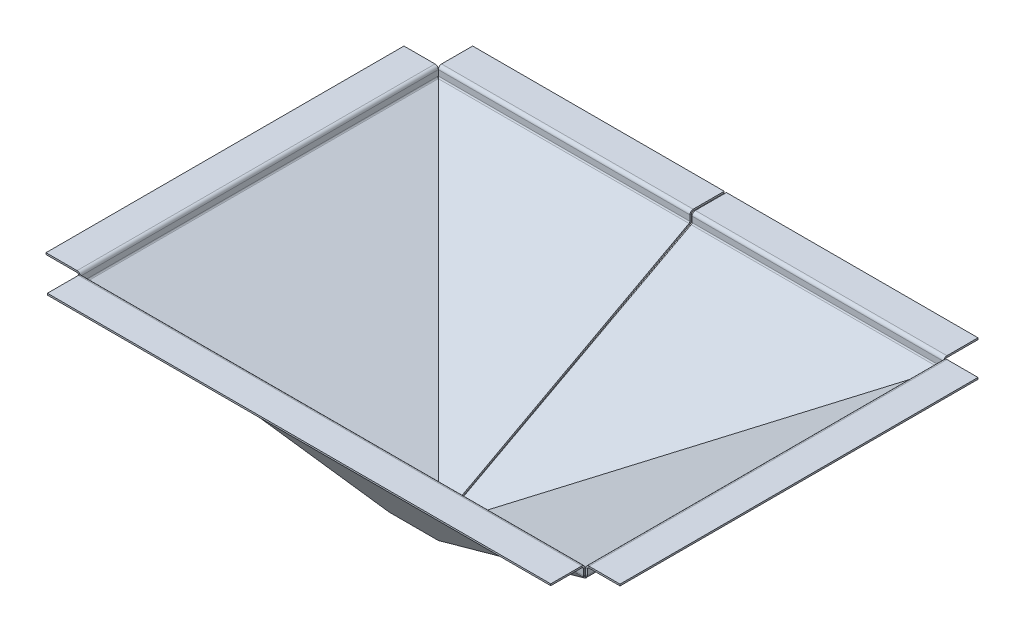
ISO-10303-21;
HEADER;
FILE_DESCRIPTION(('STEP AP214'),'2;1');
FILE_NAME('part.step','',(''),(''),'','','');
FILE_SCHEMA(('AUTOMOTIVE_DESIGN { 1 0 10303 214 1 1 1 1 }'));
ENDSEC;
DATA;
#1=APPLICATION_CONTEXT('core data for automotive mechanical design processes');
#2=APPLICATION_PROTOCOL_DEFINITION('international standard','automotive_design',2000,#1);
#3=PRODUCT_CONTEXT('',#1,'mechanical');
#4=PRODUCT('Part','Part','',(#3));
#5=PRODUCT_RELATED_PRODUCT_CATEGORY('part','',(#4));
#6=PRODUCT_DEFINITION_FORMATION('','',#4);
#7=PRODUCT_DEFINITION_CONTEXT('part definition',#1,'design');
#8=PRODUCT_DEFINITION('design','',#6,#7);
#9=PRODUCT_DEFINITION_SHAPE('','',#8);
#10=(LENGTH_UNIT() NAMED_UNIT(*) SI_UNIT(.MILLI.,.METRE.));
#11=(NAMED_UNIT(*) PLANE_ANGLE_UNIT() SI_UNIT($,.RADIAN.));
#12=(NAMED_UNIT(*) SI_UNIT($,.STERADIAN.) SOLID_ANGLE_UNIT());
#13=UNCERTAINTY_MEASURE_WITH_UNIT(LENGTH_MEASURE(1.E-05),#10,'distance_accuracy_value','');
#14=(GEOMETRIC_REPRESENTATION_CONTEXT(3) GLOBAL_UNCERTAINTY_ASSIGNED_CONTEXT((#13)) GLOBAL_UNIT_ASSIGNED_CONTEXT((#10,
#11,#12)) REPRESENTATION_CONTEXT('',''));
#15=CARTESIAN_POINT('',(0.,0.,0.));
#16=DIRECTION('',(0.,0.,1.));
#17=DIRECTION('',(1.,0.,0.));
#18=AXIS2_PLACEMENT_3D('',#15,#16,#17);
#19=CARTESIAN_POINT('',(1.31847473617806,161.76221189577,-221.059293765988));
#20=DIRECTION('',(1.,0.,0.));
#21=DIRECTION('',(0.,1.,0.));
#22=AXIS2_PLACEMENT_3D('',#19,#20,#21);
#23=PLANE('',#22);
#24=DIRECTION('',(0.,0.000373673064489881,0.999999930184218));
#25=VECTOR('',#24,1.);
#26=CARTESIAN_POINT('',(1.31847473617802,159.762212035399,-221.058546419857));
#27=LINE('',#26,#25);
#28=CARTESIAN_POINT('',(1.31847473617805,159.762212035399,-221.058546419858));
#29=VERTEX_POINT('',#28);
#30=CARTESIAN_POINT('',(1.31847473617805,159.762959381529,-219.058546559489));
#31=VERTEX_POINT('',#30);
#32=EDGE_CURVE('E43',#29,#31,#27,.T.);
#33=ORIENTED_EDGE('',*,*,#32,.F.);
#34=DIRECTION('',(0.,0.999999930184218,-0.000373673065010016));
#35=VECTOR('',#34,1.);
#36=CARTESIAN_POINT('',(1.31847473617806,161.76221189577,-221.059293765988));
#37=LINE('',#36,#35);
#38=CARTESIAN_POINT('',(1.31847473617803,152.959187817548,-221.056004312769));
#39=VERTEX_POINT('',#38);
#40=EDGE_CURVE('E1565',#39,#29,#37,.T.);
#41=ORIENTED_EDGE('',*,*,#40,.F.);
#42=DIRECTION('',(0.,-0.000373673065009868,-0.999999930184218));
#43=VECTOR('',#42,1.);
#44=CARTESIAN_POINT('',(1.31847473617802,152.959935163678,-219.056004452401));
#45=LINE('',#44,#43);
#46=CARTESIAN_POINT('',(1.31847473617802,152.959935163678,-219.056004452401));
#47=VERTEX_POINT('',#46);
#48=EDGE_CURVE('E1583',#47,#39,#45,.T.);
#49=ORIENTED_EDGE('',*,*,#48,.F.);
#50=DIRECTION('',(0.,0.999999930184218,-0.000373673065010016));
#51=VECTOR('',#50,1.);
#52=CARTESIAN_POINT('',(1.31847473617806,161.7629592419,-219.059293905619));
#53=LINE('',#52,#51);
#54=EDGE_CURVE('E1582',#47,#31,#53,.T.);
#55=ORIENTED_EDGE('',*,*,#54,.T.);
#56=EDGE_LOOP('',(#33,#41,#49,#55));
#57=FACE_BOUND('',#56,.T.);
#58=ADVANCED_FACE('F28',(#57),#23,.F.);
#59=CARTESIAN_POINT('',(309.055557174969,151.762212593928,-221.055557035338));
#60=DIRECTION('',(-1.,0.,0.));
#61=DIRECTION('',(0.,-1.,0.));
#62=AXIS2_PLACEMENT_3D('',#59,#60,#61);
#63=PLANE('',#62);
#64=DIRECTION('',(0.,0.000373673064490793,0.999999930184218));
#65=VECTOR('',#64,1.);
#66=CARTESIAN_POINT('',(309.055557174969,159.762212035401,-221.058546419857));
#67=LINE('',#66,#65);
#68=CARTESIAN_POINT('',(309.055557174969,159.7622120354,-221.058546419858));
#69=VERTEX_POINT('',#68);
#70=CARTESIAN_POINT('',(309.055557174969,159.76295938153,-219.058546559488));
#71=VERTEX_POINT('',#70);
#72=EDGE_CURVE('E511',#69,#71,#67,.T.);
#73=ORIENTED_EDGE('',*,*,#72,.T.);
#74=DIRECTION('',(0.,-0.999999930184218,0.000373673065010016));
#75=VECTOR('',#74,1.);
#76=CARTESIAN_POINT('',(309.055557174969,151.762959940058,-219.055557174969));
#77=LINE('',#76,#75);
#78=CARTESIAN_POINT('',(309.055557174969,152.959935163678,-219.056004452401));
#79=VERTEX_POINT('',#78);
#80=EDGE_CURVE('E1585',#71,#79,#77,.T.);
#81=ORIENTED_EDGE('',*,*,#80,.T.);
#82=DIRECTION('',(0.,-0.000373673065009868,-0.999999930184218));
#83=VECTOR('',#82,1.);
#84=CARTESIAN_POINT('',(309.055557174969,152.959935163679,-219.056004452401));
#85=LINE('',#84,#83);
#86=CARTESIAN_POINT('',(309.055557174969,152.959187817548,-221.05600431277));
#87=VERTEX_POINT('',#86);
#88=EDGE_CURVE('E1589',#79,#87,#85,.T.);
#89=ORIENTED_EDGE('',*,*,#88,.T.);
#90=DIRECTION('',(0.,-0.999999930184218,0.000373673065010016));
#91=VECTOR('',#90,1.);
#92=CARTESIAN_POINT('',(309.055557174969,151.762212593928,-221.055557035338));
#93=LINE('',#92,#91);
#94=EDGE_CURVE('E1563',#69,#87,#93,.T.);
#95=ORIENTED_EDGE('',*,*,#94,.F.);
#96=EDGE_LOOP('',(#73,#81,#89,#95));
#97=FACE_BOUND('',#96,.T.);
#98=ADVANCED_FACE('F836',(#97),#63,.F.);
#99=CARTESIAN_POINT('',(1.31847473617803,151.762212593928,-221.055557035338));
#100=DIRECTION('',(0.,-0.000373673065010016,-0.999999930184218));
#101=DIRECTION('',(0.,0.999999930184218,-0.000373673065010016));
#102=AXIS2_PLACEMENT_3D('',#99,#100,#101);
#103=PLANE('',#102);
#104=ORIENTED_EDGE('',*,*,#40,.T.);
#105=DIRECTION('',(1.,0.,0.));
#106=VECTOR('',#105,1.);
#107=CARTESIAN_POINT('',(309.055557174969,159.762212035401,-221.058546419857));
#108=LINE('',#107,#106);
#109=EDGE_CURVE('E50',#69,#29,#108,.F.);
#110=ORIENTED_EDGE('',*,*,#109,.F.);
#111=ORIENTED_EDGE('',*,*,#94,.T.);
#112=DIRECTION('',(-1.,0.,0.));
#113=VECTOR('',#112,1.);
#114=CARTESIAN_POINT('',(1.31847473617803,152.959187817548,-221.056004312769));
#115=LINE('',#114,#113);
#116=EDGE_CURVE('E1581',#87,#39,#115,.T.);
#117=ORIENTED_EDGE('',*,*,#116,.T.);
#118=EDGE_LOOP('',(#104,#110,#111,#117));
#119=FACE_BOUND('',#118,.T.);
#120=ADVANCED_FACE('F832',(#119),#103,.T.);
#121=CARTESIAN_POINT('',(1.31847473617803,151.762959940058,-219.055557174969));
#122=DIRECTION('',(0.,-0.000373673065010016,-0.999999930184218));
#123=DIRECTION('',(0.,0.999999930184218,-0.000373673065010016));
#124=AXIS2_PLACEMENT_3D('',#121,#122,#123);
#125=PLANE('',#124);
#126=DIRECTION('',(1.,0.,0.));
#127=VECTOR('',#126,1.);
#128=CARTESIAN_POINT('',(309.055557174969,159.76295938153,-219.058546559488));
#129=LINE('',#128,#127);
#130=EDGE_CURVE('E506',#71,#31,#129,.F.);
#131=ORIENTED_EDGE('',*,*,#130,.T.);
#132=ORIENTED_EDGE('',*,*,#54,.F.);
#133=DIRECTION('',(-1.,0.,0.));
#134=VECTOR('',#133,1.);
#135=CARTESIAN_POINT('',(309.055557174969,152.959935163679,-219.056004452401));
#136=LINE('',#135,#134);
#137=EDGE_CURVE('E1562',#79,#47,#136,.T.);
#138=ORIENTED_EDGE('',*,*,#137,.F.);
#139=ORIENTED_EDGE('',*,*,#80,.F.);
#140=EDGE_LOOP('',(#131,#132,#138,#139));
#141=FACE_BOUND('',#140,.T.);
#142=ADVANCED_FACE('F828',(#141),#125,.F.);
#143=CARTESIAN_POINT('',(-309.055557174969,161.76221189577,-221.059293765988));
#144=DIRECTION('',(1.,0.,0.));
#145=DIRECTION('',(0.,0.,-1.));
#146=AXIS2_PLACEMENT_3D('',#143,#144,#145);
#147=PLANE('',#146);
#148=DIRECTION('',(0.,0.000373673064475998,0.999999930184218));
#149=VECTOR('',#148,1.);
#150=CARTESIAN_POINT('',(-309.055557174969,159.762212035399,-221.058546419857));
#151=LINE('',#150,#149);
#152=CARTESIAN_POINT('',(-309.055557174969,159.762212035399,-221.058546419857));
#153=VERTEX_POINT('',#152);
#154=CARTESIAN_POINT('',(-309.055557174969,159.762959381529,-219.058546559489));
#155=VERTEX_POINT('',#154);
#156=EDGE_CURVE('E564',#153,#155,#151,.T.);
#157=ORIENTED_EDGE('',*,*,#156,.F.);
#158=DIRECTION('',(0.,0.999999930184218,-0.000373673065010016));
#159=VECTOR('',#158,1.);
#160=CARTESIAN_POINT('',(-309.055557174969,161.76221189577,-221.059293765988));
#161=LINE('',#160,#159);
#162=CARTESIAN_POINT('',(-309.055557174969,152.959187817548,-221.05600431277));
#163=VERTEX_POINT('',#162);
#164=EDGE_CURVE('E1510',#163,#153,#161,.T.);
#165=ORIENTED_EDGE('',*,*,#164,.F.);
#166=DIRECTION('',(0.,-0.000373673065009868,-0.999999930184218));
#167=VECTOR('',#166,1.);
#168=CARTESIAN_POINT('',(-309.055557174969,152.959935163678,-219.056004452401));
#169=LINE('',#168,#167);
#170=CARTESIAN_POINT('',(-309.055557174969,152.959935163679,-219.056004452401));
#171=VERTEX_POINT('',#170);
#172=EDGE_CURVE('E1521',#171,#163,#169,.T.);
#173=ORIENTED_EDGE('',*,*,#172,.F.);
#174=DIRECTION('',(0.,0.999999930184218,-0.000373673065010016));
#175=VECTOR('',#174,1.);
#176=CARTESIAN_POINT('',(-309.055557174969,161.7629592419,-219.059293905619));
#177=LINE('',#176,#175);
#178=EDGE_CURVE('E1515',#171,#155,#177,.T.);
#179=ORIENTED_EDGE('',*,*,#178,.T.);
#180=EDGE_LOOP('',(#157,#165,#173,#179));
#181=FACE_BOUND('',#180,.T.);
#182=ADVANCED_FACE('F831',(#181),#147,.F.);
#183=CARTESIAN_POINT('',(-1.31847473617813,151.762212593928,-221.055557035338));
#184=DIRECTION('',(-1.,0.,0.));
#185=DIRECTION('',(0.,0.,1.));
#186=AXIS2_PLACEMENT_3D('',#183,#184,#185);
#187=PLANE('',#186);
#188=DIRECTION('',(0.,0.00037367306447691,0.999999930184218));
#189=VECTOR('',#188,1.);
#190=CARTESIAN_POINT('',(-1.31847473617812,159.762212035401,-221.058546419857));
#191=LINE('',#190,#189);
#192=CARTESIAN_POINT('',(-1.31847473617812,159.762212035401,-221.058546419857));
#193=VERTEX_POINT('',#192);
#194=CARTESIAN_POINT('',(-1.31847473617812,159.76295938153,-219.058546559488));
#195=VERTEX_POINT('',#194);
#196=EDGE_CURVE('E561',#193,#195,#191,.T.);
#197=ORIENTED_EDGE('',*,*,#196,.T.);
#198=DIRECTION('',(0.,-0.999999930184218,0.000373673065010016));
#199=VECTOR('',#198,1.);
#200=CARTESIAN_POINT('',(-1.31847473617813,151.762959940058,-219.055557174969));
#201=LINE('',#200,#199);
#202=CARTESIAN_POINT('',(-1.31847473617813,152.959935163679,-219.056004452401));
#203=VERTEX_POINT('',#202);
#204=EDGE_CURVE('E1513',#195,#203,#201,.T.);
#205=ORIENTED_EDGE('',*,*,#204,.T.);
#206=DIRECTION('',(0.,-0.000373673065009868,-0.999999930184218));
#207=VECTOR('',#206,1.);
#208=CARTESIAN_POINT('',(-1.31847473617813,152.959935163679,-219.056004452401));
#209=LINE('',#208,#207);
#210=CARTESIAN_POINT('',(-1.31847473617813,152.959187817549,-221.05600431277));
#211=VERTEX_POINT('',#210);
#212=EDGE_CURVE('E1522',#203,#211,#209,.T.);
#213=ORIENTED_EDGE('',*,*,#212,.T.);
#214=DIRECTION('',(0.,-0.999999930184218,0.000373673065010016));
#215=VECTOR('',#214,1.);
#216=CARTESIAN_POINT('',(-1.31847473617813,151.762212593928,-221.055557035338));
#217=LINE('',#216,#215);
#218=EDGE_CURVE('E930',#193,#211,#217,.T.);
#219=ORIENTED_EDGE('',*,*,#218,.F.);
#220=EDGE_LOOP('',(#197,#205,#213,#219));
#221=FACE_BOUND('',#220,.T.);
#222=ADVANCED_FACE('F904',(#221),#187,.F.);
#223=CARTESIAN_POINT('',(-309.055557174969,151.762212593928,-221.055557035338));
#224=DIRECTION('',(0.,0.000373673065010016,0.999999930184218));
#225=DIRECTION('',(0.,-0.999999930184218,0.000373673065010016));
#226=AXIS2_PLACEMENT_3D('',#223,#224,#225);
#227=PLANE('',#226);
#228=DIRECTION('',(1.,0.,0.));
#229=VECTOR('',#228,1.);
#230=CARTESIAN_POINT('',(-1.31847473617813,159.762212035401,-221.058546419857));
#231=LINE('',#230,#229);
#232=EDGE_CURVE('E551',#193,#153,#231,.F.);
#233=ORIENTED_EDGE('',*,*,#232,.F.);
#234=ORIENTED_EDGE('',*,*,#218,.T.);
#235=DIRECTION('',(1.,0.,0.));
#236=VECTOR('',#235,1.);
#237=CARTESIAN_POINT('',(-309.055557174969,152.959187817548,-221.05600431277));
#238=LINE('',#237,#236);
#239=EDGE_CURVE('E1518',#163,#211,#238,.T.);
#240=ORIENTED_EDGE('',*,*,#239,.F.);
#241=ORIENTED_EDGE('',*,*,#164,.T.);
#242=EDGE_LOOP('',(#233,#234,#240,#241));
#243=FACE_BOUND('',#242,.T.);
#244=ADVANCED_FACE('F900',(#243),#227,.F.);
#245=CARTESIAN_POINT('',(-309.055557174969,151.762959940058,-219.055557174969));
#246=DIRECTION('',(0.,0.000373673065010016,0.999999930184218));
#247=DIRECTION('',(0.,-0.999999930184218,0.000373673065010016));
#248=AXIS2_PLACEMENT_3D('',#245,#246,#247);
#249=PLANE('',#248);
#250=ORIENTED_EDGE('',*,*,#204,.F.);
#251=DIRECTION('',(1.,0.,0.));
#252=VECTOR('',#251,1.);
#253=CARTESIAN_POINT('',(-1.31847473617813,159.76295938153,-219.058546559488));
#254=LINE('',#253,#252);
#255=EDGE_CURVE('E555',#195,#155,#254,.F.);
#256=ORIENTED_EDGE('',*,*,#255,.T.);
#257=ORIENTED_EDGE('',*,*,#178,.F.);
#258=DIRECTION('',(-1.,0.,0.));
#259=VECTOR('',#258,1.);
#260=CARTESIAN_POINT('',(-1.31847473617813,152.959935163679,-219.056004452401));
#261=LINE('',#260,#259);
#262=EDGE_CURVE('E1525',#203,#171,#261,.T.);
#263=ORIENTED_EDGE('',*,*,#262,.F.);
#264=EDGE_LOOP('',(#250,#256,#257,#263));
#265=FACE_BOUND('',#264,.T.);
#266=ADVANCED_FACE('F896',(#265),#249,.T.);
#267=CARTESIAN_POINT('',(311.059293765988,161.76221189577,-219.055557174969));
#268=DIRECTION('',(0.,0.,1.));
#269=DIRECTION('',(1.,0.,0.));
#270=AXIS2_PLACEMENT_3D('',#267,#268,#269);
#271=PLANE('',#270);
#272=DIRECTION('',(-0.999999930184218,0.000373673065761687,0.));
#273=VECTOR('',#272,1.);
#274=CARTESIAN_POINT('',(311.058546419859,159.762212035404,-219.055557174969));
#275=LINE('',#274,#273);
#276=CARTESIAN_POINT('',(311.058546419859,159.762212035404,-219.055557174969));
#277=VERTEX_POINT('',#276);
#278=CARTESIAN_POINT('',(309.058546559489,159.762959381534,-219.055557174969));
#279=VERTEX_POINT('',#278);
#280=EDGE_CURVE('E617',#277,#279,#275,.T.);
#281=ORIENTED_EDGE('',*,*,#280,.F.);
#282=DIRECTION('',(0.000373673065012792,0.999999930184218,0.));
#283=VECTOR('',#282,1.);
#284=CARTESIAN_POINT('',(311.059293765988,161.76221189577,-219.055557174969));
#285=LINE('',#284,#283);
#286=CARTESIAN_POINT('',(311.056004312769,152.959187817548,-219.055557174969));
#287=VERTEX_POINT('',#286);
#288=EDGE_CURVE('E1313',#287,#277,#285,.T.);
#289=ORIENTED_EDGE('',*,*,#288,.F.);
#290=DIRECTION('',(0.999999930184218,-0.000373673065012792,0.));
#291=VECTOR('',#290,1.);
#292=CARTESIAN_POINT('',(309.056004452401,152.959935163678,-219.055557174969));
#293=LINE('',#292,#291);
#294=CARTESIAN_POINT('',(309.056004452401,152.959935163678,-219.055557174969));
#295=VERTEX_POINT('',#294);
#296=EDGE_CURVE('E1302',#295,#287,#293,.T.);
#297=ORIENTED_EDGE('',*,*,#296,.F.);
#298=DIRECTION('',(0.000373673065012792,0.999999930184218,0.));
#299=VECTOR('',#298,1.);
#300=CARTESIAN_POINT('',(309.059293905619,161.7629592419,-219.055557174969));
#301=LINE('',#300,#299);
#302=EDGE_CURVE('E1308',#295,#279,#301,.T.);
#303=ORIENTED_EDGE('',*,*,#302,.T.);
#304=EDGE_LOOP('',(#281,#289,#297,#303));
#305=FACE_BOUND('',#304,.T.);
#306=ADVANCED_FACE('F899',(#305),#271,.F.);
#307=CARTESIAN_POINT('',(311.055557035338,151.762212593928,218.771605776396));
#308=DIRECTION('',(0.,0.,-1.));
#309=DIRECTION('',(-1.,0.,0.));
#310=AXIS2_PLACEMENT_3D('',#307,#308,#309);
#311=PLANE('',#310);
#312=DIRECTION('',(-0.999999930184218,0.000373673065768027,0.));
#313=VECTOR('',#312,1.);
#314=CARTESIAN_POINT('',(311.058546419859,159.762212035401,218.771605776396));
#315=LINE('',#314,#313);
#316=CARTESIAN_POINT('',(311.058546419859,159.762212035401,218.771605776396));
#317=VERTEX_POINT('',#316);
#318=CARTESIAN_POINT('',(309.058546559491,159.762959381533,218.771605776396));
#319=VERTEX_POINT('',#318);
#320=EDGE_CURVE('E614',#317,#319,#315,.T.);
#321=ORIENTED_EDGE('',*,*,#320,.T.);
#322=DIRECTION('',(-0.000373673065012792,-0.999999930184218,0.));
#323=VECTOR('',#322,1.);
#324=CARTESIAN_POINT('',(309.055557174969,151.762959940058,218.771605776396));
#325=LINE('',#324,#323);
#326=CARTESIAN_POINT('',(309.056004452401,152.959935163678,218.771605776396));
#327=VERTEX_POINT('',#326);
#328=EDGE_CURVE('E1311',#319,#327,#325,.T.);
#329=ORIENTED_EDGE('',*,*,#328,.T.);
#330=DIRECTION('',(0.999999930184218,-0.000373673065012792,0.));
#331=VECTOR('',#330,1.);
#332=CARTESIAN_POINT('',(309.056004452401,152.959935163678,218.771605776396));
#333=LINE('',#332,#331);
#334=CARTESIAN_POINT('',(311.056004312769,152.959187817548,218.771605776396));
#335=VERTEX_POINT('',#334);
#336=EDGE_CURVE('E1296',#327,#335,#333,.T.);
#337=ORIENTED_EDGE('',*,*,#336,.T.);
#338=DIRECTION('',(-0.000373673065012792,-0.999999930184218,0.));
#339=VECTOR('',#338,1.);
#340=CARTESIAN_POINT('',(311.055557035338,151.762212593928,218.771605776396));
#341=LINE('',#340,#339);
#342=EDGE_CURVE('E1316',#317,#335,#341,.T.);
#343=ORIENTED_EDGE('',*,*,#342,.F.);
#344=EDGE_LOOP('',(#321,#329,#337,#343));
#345=FACE_BOUND('',#344,.T.);
#346=ADVANCED_FACE('F2117',(#345),#311,.F.);
#347=CARTESIAN_POINT('',(311.055557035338,151.762212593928,-219.055557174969));
#348=DIRECTION('',(-0.999999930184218,0.000373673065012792,0.));
#349=DIRECTION('',(-0.000373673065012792,-0.999999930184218,0.));
#350=AXIS2_PLACEMENT_3D('',#347,#348,#349);
#351=PLANE('',#350);
#352=DIRECTION('',(0.,0.,1.));
#353=VECTOR('',#352,1.);
#354=CARTESIAN_POINT('',(311.058546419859,159.762212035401,218.771605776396));
#355=LINE('',#354,#353);
#356=EDGE_CURVE('E604',#317,#277,#355,.F.);
#357=ORIENTED_EDGE('',*,*,#356,.F.);
#358=ORIENTED_EDGE('',*,*,#342,.T.);
#359=DIRECTION('',(0.,0.,1.));
#360=VECTOR('',#359,1.);
#361=CARTESIAN_POINT('',(311.056004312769,152.959187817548,-219.055557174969));
#362=LINE('',#361,#360);
#363=EDGE_CURVE('E1304',#287,#335,#362,.T.);
#364=ORIENTED_EDGE('',*,*,#363,.F.);
#365=ORIENTED_EDGE('',*,*,#288,.T.);
#366=EDGE_LOOP('',(#357,#358,#364,#365));
#367=FACE_BOUND('',#366,.T.);
#368=ADVANCED_FACE('F2107',(#367),#351,.F.);
#369=CARTESIAN_POINT('',(309.055557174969,151.762959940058,-219.055557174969));
#370=DIRECTION('',(-0.999999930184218,0.000373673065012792,0.));
#371=DIRECTION('',(-0.000373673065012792,-0.999999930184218,0.));
#372=AXIS2_PLACEMENT_3D('',#369,#370,#371);
#373=PLANE('',#372);
#374=ORIENTED_EDGE('',*,*,#328,.F.);
#375=DIRECTION('',(0.,0.,1.));
#376=VECTOR('',#375,1.);
#377=CARTESIAN_POINT('',(309.058546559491,159.762959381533,218.771605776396));
#378=LINE('',#377,#376);
#379=EDGE_CURVE('E608',#319,#279,#378,.F.);
#380=ORIENTED_EDGE('',*,*,#379,.T.);
#381=ORIENTED_EDGE('',*,*,#302,.F.);
#382=DIRECTION('',(0.,0.,-1.));
#383=VECTOR('',#382,1.);
#384=CARTESIAN_POINT('',(309.056004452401,152.959935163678,218.771605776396));
#385=LINE('',#384,#383);
#386=EDGE_CURVE('E1298',#327,#295,#385,.T.);
#387=ORIENTED_EDGE('',*,*,#386,.F.);
#388=EDGE_LOOP('',(#374,#380,#381,#387));
#389=FACE_BOUND('',#388,.T.);
#390=ADVANCED_FACE('F979',(#389),#373,.T.);
#391=CARTESIAN_POINT('',(-311.059293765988,161.76221189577,218.771605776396));
#392=DIRECTION('',(0.,0.,-1.));
#393=DIRECTION('',(-1.,0.,0.));
#394=AXIS2_PLACEMENT_3D('',#391,#392,#393);
#395=PLANE('',#394);
#396=DIRECTION('',(0.999999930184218,0.000373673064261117,0.));
#397=VECTOR('',#396,1.);
#398=CARTESIAN_POINT('',(-311.058546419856,159.762212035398,218.771605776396));
#399=LINE('',#398,#397);
#400=CARTESIAN_POINT('',(-311.058546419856,159.762212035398,218.771605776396));
#401=VERTEX_POINT('',#400);
#402=CARTESIAN_POINT('',(-309.058546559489,159.762959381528,218.771605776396));
#403=VERTEX_POINT('',#402);
#404=EDGE_CURVE('E670',#401,#403,#399,.T.);
#405=ORIENTED_EDGE('',*,*,#404,.F.);
#406=DIRECTION('',(-0.000373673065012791,0.999999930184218,0.));
#407=VECTOR('',#406,1.);
#408=CARTESIAN_POINT('',(-311.059293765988,161.76221189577,218.771605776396));
#409=LINE('',#408,#407);
#410=CARTESIAN_POINT('',(-311.05600431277,152.959187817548,218.771605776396));
#411=VERTEX_POINT('',#410);
#412=EDGE_CURVE('E1048',#411,#401,#409,.T.);
#413=ORIENTED_EDGE('',*,*,#412,.F.);
#414=DIRECTION('',(-0.999999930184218,-0.000373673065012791,0.));
#415=VECTOR('',#414,1.);
#416=CARTESIAN_POINT('',(-309.056004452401,152.959935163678,218.771605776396));
#417=LINE('',#416,#415);
#418=CARTESIAN_POINT('',(-309.056004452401,152.959935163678,218.771605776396));
#419=VERTEX_POINT('',#418);
#420=EDGE_CURVE('E1059',#419,#411,#417,.T.);
#421=ORIENTED_EDGE('',*,*,#420,.F.);
#422=DIRECTION('',(-0.000373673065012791,0.999999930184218,0.));
#423=VECTOR('',#422,1.);
#424=CARTESIAN_POINT('',(-309.059293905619,161.7629592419,218.771605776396));
#425=LINE('',#424,#423);
#426=EDGE_CURVE('E1053',#419,#403,#425,.T.);
#427=ORIENTED_EDGE('',*,*,#426,.T.);
#428=EDGE_LOOP('',(#405,#413,#421,#427));
#429=FACE_BOUND('',#428,.T.);
#430=ADVANCED_FACE('F975',(#429),#395,.F.);
#431=CARTESIAN_POINT('',(-311.055557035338,151.762212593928,-219.055557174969));
#432=DIRECTION('',(0.,0.,1.));
#433=DIRECTION('',(1.,0.,0.));
#434=AXIS2_PLACEMENT_3D('',#431,#432,#433);
#435=PLANE('',#434);
#436=DIRECTION('',(0.999999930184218,0.000373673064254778,0.));
#437=VECTOR('',#436,1.);
#438=CARTESIAN_POINT('',(-311.058546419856,159.762212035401,-219.055557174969));
#439=LINE('',#438,#437);
#440=CARTESIAN_POINT('',(-311.058546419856,159.762212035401,-219.055557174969));
#441=VERTEX_POINT('',#440);
#442=CARTESIAN_POINT('',(-309.058546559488,159.76295938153,-219.055557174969));
#443=VERTEX_POINT('',#442);
#444=EDGE_CURVE('E667',#441,#443,#439,.T.);
#445=ORIENTED_EDGE('',*,*,#444,.T.);
#446=DIRECTION('',(0.000373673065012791,-0.999999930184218,0.));
#447=VECTOR('',#446,1.);
#448=CARTESIAN_POINT('',(-309.055557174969,151.762959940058,-219.055557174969));
#449=LINE('',#448,#447);
#450=CARTESIAN_POINT('',(-309.056004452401,152.959935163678,-219.055557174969));
#451=VERTEX_POINT('',#450);
#452=EDGE_CURVE('E1051',#443,#451,#449,.T.);
#453=ORIENTED_EDGE('',*,*,#452,.T.);
#454=DIRECTION('',(-0.999999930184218,-0.000373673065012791,0.));
#455=VECTOR('',#454,1.);
#456=CARTESIAN_POINT('',(-309.056004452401,152.959935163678,-219.055557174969));
#457=LINE('',#456,#455);
#458=CARTESIAN_POINT('',(-311.05600431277,152.959187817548,-219.055557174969));
#459=VERTEX_POINT('',#458);
#460=EDGE_CURVE('E1060',#451,#459,#457,.T.);
#461=ORIENTED_EDGE('',*,*,#460,.T.);
#462=DIRECTION('',(0.000373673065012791,-0.999999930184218,0.));
#463=VECTOR('',#462,1.);
#464=CARTESIAN_POINT('',(-311.055557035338,151.762212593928,-219.055557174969));
#465=LINE('',#464,#463);
#466=EDGE_CURVE('E1005',#441,#459,#465,.T.);
#467=ORIENTED_EDGE('',*,*,#466,.F.);
#468=EDGE_LOOP('',(#445,#453,#461,#467));
#469=FACE_BOUND('',#468,.T.);
#470=ADVANCED_FACE('F971',(#469),#435,.F.);
#471=CARTESIAN_POINT('',(-311.055557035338,151.762212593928,218.771605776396));
#472=DIRECTION('',(0.999999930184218,0.000373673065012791,0.));
#473=DIRECTION('',(-0.000373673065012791,0.999999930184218,0.));
#474=AXIS2_PLACEMENT_3D('',#471,#472,#473);
#475=PLANE('',#474);
#476=DIRECTION('',(0.,0.,-1.));
#477=VECTOR('',#476,1.);
#478=CARTESIAN_POINT('',(-311.058546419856,159.762212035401,-219.055557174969));
#479=LINE('',#478,#477);
#480=EDGE_CURVE('E657',#441,#401,#479,.F.);
#481=ORIENTED_EDGE('',*,*,#480,.F.);
#482=ORIENTED_EDGE('',*,*,#466,.T.);
#483=DIRECTION('',(0.,0.,-1.));
#484=VECTOR('',#483,1.);
#485=CARTESIAN_POINT('',(-311.05600431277,152.959187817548,218.771605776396));
#486=LINE('',#485,#484);
#487=EDGE_CURVE('E1056',#411,#459,#486,.T.);
#488=ORIENTED_EDGE('',*,*,#487,.F.);
#489=ORIENTED_EDGE('',*,*,#412,.T.);
#490=EDGE_LOOP('',(#481,#482,#488,#489));
#491=FACE_BOUND('',#490,.T.);
#492=ADVANCED_FACE('F967',(#491),#475,.F.);
#493=CARTESIAN_POINT('',(-309.055557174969,151.762959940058,218.771605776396));
#494=DIRECTION('',(0.999999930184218,0.000373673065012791,0.));
#495=DIRECTION('',(-0.000373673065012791,0.999999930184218,0.));
#496=AXIS2_PLACEMENT_3D('',#493,#494,#495);
#497=PLANE('',#496);
#498=ORIENTED_EDGE('',*,*,#452,.F.);
#499=DIRECTION('',(0.,0.,-1.));
#500=VECTOR('',#499,1.);
#501=CARTESIAN_POINT('',(-309.058546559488,159.76295938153,-219.055557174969));
#502=LINE('',#501,#500);
#503=EDGE_CURVE('E661',#443,#403,#502,.F.);
#504=ORIENTED_EDGE('',*,*,#503,.T.);
#505=ORIENTED_EDGE('',*,*,#426,.F.);
#506=DIRECTION('',(0.,0.,1.));
#507=VECTOR('',#506,1.);
#508=CARTESIAN_POINT('',(-309.056004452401,152.959935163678,-219.055557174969));
#509=LINE('',#508,#507);
#510=EDGE_CURVE('E1063',#451,#419,#509,.T.);
#511=ORIENTED_EDGE('',*,*,#510,.F.);
#512=EDGE_LOOP('',(#498,#504,#505,#511));
#513=FACE_BOUND('',#512,.T.);
#514=ADVANCED_FACE('F964',(#513),#497,.T.);
#515=CARTESIAN_POINT('',(307.835579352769,161.11321935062,220.316708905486));
#516=DIRECTION('',(-1.,0.,0.));
#517=DIRECTION('',(0.,0.,1.));
#518=AXIS2_PLACEMENT_3D('',#515,#516,#517);
#519=PLANE('',#518);
#520=DIRECTION('',(0.,-0.00191868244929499,-0.999998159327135));
#521=VECTOR('',#520,1.);
#522=CARTESIAN_POINT('',(307.835579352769,159.113223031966,220.320546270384));
#523=LINE('',#522,#521);
#524=CARTESIAN_POINT('',(307.835579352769,159.113223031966,220.320546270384));
#525=VERTEX_POINT('',#524);
#526=CARTESIAN_POINT('',(307.835579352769,159.109383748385,218.320549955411));
#527=VERTEX_POINT('',#526);
#528=EDGE_CURVE('E723',#525,#527,#523,.T.);
#529=ORIENTED_EDGE('',*,*,#528,.F.);
#530=DIRECTION('',(0.,0.999998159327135,-0.00191868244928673));
#531=VECTOR('',#530,1.);
#532=CARTESIAN_POINT('',(307.835579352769,161.11321935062,220.316708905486));
#533=LINE('',#532,#531);
#534=CARTESIAN_POINT('',(307.835579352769,151.720883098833,220.334729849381));
#535=VERTEX_POINT('',#534);
#536=EDGE_CURVE('E744',#535,#525,#533,.T.);
#537=ORIENTED_EDGE('',*,*,#536,.F.);
#538=DIRECTION('',(0.,0.00191868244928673,0.999998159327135));
#539=VECTOR('',#538,1.);
#540=CARTESIAN_POINT('',(307.835579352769,151.717045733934,218.334733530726));
#541=LINE('',#540,#539);
#542=CARTESIAN_POINT('',(307.835579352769,151.717045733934,218.334733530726));
#543=VERTEX_POINT('',#542);
#544=EDGE_CURVE('E731',#543,#535,#541,.T.);
#545=ORIENTED_EDGE('',*,*,#544,.F.);
#546=DIRECTION('',(0.,0.999998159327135,-0.00191868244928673));
#547=VECTOR('',#546,1.);
#548=CARTESIAN_POINT('',(307.835579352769,161.109381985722,218.316712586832));
#549=LINE('',#548,#547);
#550=EDGE_CURVE('E739',#543,#527,#549,.T.);
#551=ORIENTED_EDGE('',*,*,#550,.T.);
#552=EDGE_LOOP('',(#529,#537,#545,#551));
#553=FACE_BOUND('',#552,.T.);
#554=ADVANCED_FACE('F794',(#553),#519,.F.);
#555=CARTESIAN_POINT('',(-307.835579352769,151.113237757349,220.335895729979));
#556=DIRECTION('',(1.,0.,0.));
#557=DIRECTION('',(0.,0.,-1.));
#558=AXIS2_PLACEMENT_3D('',#555,#556,#557);
#559=PLANE('',#558);
#560=DIRECTION('',(0.,-0.00191868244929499,-0.999998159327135));
#561=VECTOR('',#560,1.);
#562=CARTESIAN_POINT('',(-307.835579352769,159.113223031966,220.320546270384));
#563=LINE('',#562,#561);
#564=CARTESIAN_POINT('',(-307.835579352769,159.113223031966,220.320546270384));
#565=VERTEX_POINT('',#564);
#566=CARTESIAN_POINT('',(-307.835579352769,159.109385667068,218.32054995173));
#567=VERTEX_POINT('',#566);
#568=EDGE_CURVE('E720',#565,#567,#563,.T.);
#569=ORIENTED_EDGE('',*,*,#568,.T.);
#570=DIRECTION('',(0.,-0.999998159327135,0.00191868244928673));
#571=VECTOR('',#570,1.);
#572=CARTESIAN_POINT('',(-307.835579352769,151.10940039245,218.335899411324));
#573=LINE('',#572,#571);
#574=CARTESIAN_POINT('',(-307.835579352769,151.717045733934,218.334733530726));
#575=VERTEX_POINT('',#574);
#576=EDGE_CURVE('E742',#567,#575,#573,.T.);
#577=ORIENTED_EDGE('',*,*,#576,.T.);
#578=DIRECTION('',(0.,0.00191868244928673,0.999998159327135));
#579=VECTOR('',#578,1.);
#580=CARTESIAN_POINT('',(-307.835579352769,151.717045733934,218.334733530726));
#581=LINE('',#580,#579);
#582=CARTESIAN_POINT('',(-307.835579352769,151.720883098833,220.334729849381));
#583=VERTEX_POINT('',#582);
#584=EDGE_CURVE('E726',#575,#583,#581,.T.);
#585=ORIENTED_EDGE('',*,*,#584,.T.);
#586=DIRECTION('',(0.,-0.999998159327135,0.00191868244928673));
#587=VECTOR('',#586,1.);
#588=CARTESIAN_POINT('',(-307.835579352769,151.113237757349,220.335895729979));
#589=LINE('',#588,#587);
#590=EDGE_CURVE('E747',#565,#583,#589,.T.);
#591=ORIENTED_EDGE('',*,*,#590,.F.);
#592=EDGE_LOOP('',(#569,#577,#585,#591));
#593=FACE_BOUND('',#592,.T.);
#594=ADVANCED_FACE('F1771',(#593),#559,.F.);
#595=CARTESIAN_POINT('',(307.835579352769,151.113237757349,220.335895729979));
#596=DIRECTION('',(0.,-0.00191868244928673,-0.999998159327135));
#597=DIRECTION('',(0.,0.999998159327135,-0.00191868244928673));
#598=AXIS2_PLACEMENT_3D('',#595,#596,#597);
#599=PLANE('',#598);
#600=DIRECTION('',(-1.,0.,0.));
#601=VECTOR('',#600,1.);
#602=CARTESIAN_POINT('',(-307.835579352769,159.113223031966,220.320546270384));
#603=LINE('',#602,#601);
#604=EDGE_CURVE('E710',#565,#525,#603,.F.);
#605=ORIENTED_EDGE('',*,*,#604,.F.);
#606=ORIENTED_EDGE('',*,*,#590,.T.);
#607=DIRECTION('',(-1.,0.,0.));
#608=VECTOR('',#607,1.);
#609=CARTESIAN_POINT('',(307.835579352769,151.720883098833,220.334729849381));
#610=LINE('',#609,#608);
#611=EDGE_CURVE('E734',#535,#583,#610,.T.);
#612=ORIENTED_EDGE('',*,*,#611,.F.);
#613=ORIENTED_EDGE('',*,*,#536,.T.);
#614=EDGE_LOOP('',(#605,#606,#612,#613));
#615=FACE_BOUND('',#614,.T.);
#616=ADVANCED_FACE('F1768',(#615),#599,.F.);
#617=CARTESIAN_POINT('',(307.835579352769,151.109400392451,218.335899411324));
#618=DIRECTION('',(0.,-0.00191868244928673,-0.999998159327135));
#619=DIRECTION('',(0.,0.999998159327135,-0.00191868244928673));
#620=AXIS2_PLACEMENT_3D('',#617,#618,#619);
#621=PLANE('',#620);
#622=ORIENTED_EDGE('',*,*,#576,.F.);
#623=DIRECTION('',(-1.,0.,0.));
#624=VECTOR('',#623,1.);
#625=CARTESIAN_POINT('',(-307.835579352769,159.109385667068,218.32054995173));
#626=LINE('',#625,#624);
#627=EDGE_CURVE('E714',#567,#527,#626,.F.);
#628=ORIENTED_EDGE('',*,*,#627,.T.);
#629=ORIENTED_EDGE('',*,*,#550,.F.);
#630=DIRECTION('',(1.,0.,0.));
#631=VECTOR('',#630,1.);
#632=CARTESIAN_POINT('',(-307.835579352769,151.717045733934,218.334733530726));
#633=LINE('',#632,#631);
#634=EDGE_CURVE('E729',#575,#543,#633,.T.);
#635=ORIENTED_EDGE('',*,*,#634,.F.);
#636=EDGE_LOOP('',(#622,#628,#629,#635));
#637=FACE_BOUND('',#636,.T.);
#638=ADVANCED_FACE('F1477',(#637),#621,.T.);
#639=CARTESIAN_POINT('',(-310.,150.,220.));
#640=DIRECTION('',(0.,0.832050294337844,0.554700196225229));
#641=DIRECTION('',(-1.,0.,0.));
#642=AXIS2_PLACEMENT_3D('',#639,#640,#641);
#643=PLANE('',#642);
#644=DIRECTION('',(-0.734452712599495,0.376452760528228,-0.564679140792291));
#645=VECTOR('',#644,1.);
#646=CARTESIAN_POINT('',(310.,150.,220.));
#647=LINE('',#646,#645);
#648=CARTESIAN_POINT('',(310.,150.,220.));
#649=VERTEX_POINT('',#648);
#650=CARTESIAN_POINT('',(307.835579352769,151.109400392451,218.335899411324));
#651=VERTEX_POINT('',#650);
#652=EDGE_CURVE('E1232',#649,#651,#647,.T.);
#653=ORIENTED_EDGE('',*,*,#652,.T.);
#654=DIRECTION('',(0.,-0.554700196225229,0.832050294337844));
#655=VECTOR('',#654,1.);
#656=CARTESIAN_POINT('',(307.835579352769,151.109400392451,218.335899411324));
#657=LINE('',#656,#655);
#658=CARTESIAN_POINT('',(307.835579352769,150.,220.));
#659=VERTEX_POINT('',#658);
#660=EDGE_CURVE('E1820',#651,#659,#657,.T.);
#661=ORIENTED_EDGE('',*,*,#660,.T.);
#662=DIRECTION('',(-1.,0.,0.));
#663=VECTOR('',#662,1.);
#664=CARTESIAN_POINT('',(-310.,150.,220.));
#665=LINE('',#664,#663);
#666=EDGE_CURVE('E1127',#649,#659,#665,.T.);
#667=ORIENTED_EDGE('',*,*,#666,.F.);
#668=EDGE_LOOP('',(#653,#661,#667));
#669=FACE_BOUND('',#668,.T.);
#670=ADVANCED_FACE('F1474',(#669),#643,.T.);
#671=CARTESIAN_POINT('',(-307.835579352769,150.,220.));
#672=VERTEX_POINT('',#671);
#673=CARTESIAN_POINT('',(-310.,150.,220.));
#674=VERTEX_POINT('',#673);
#675=EDGE_CURVE('E1116',#672,#674,#665,.T.);
#676=ORIENTED_EDGE('',*,*,#675,.F.);
#677=DIRECTION('',(0.,-0.554700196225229,0.832050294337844));
#678=VECTOR('',#677,1.);
#679=CARTESIAN_POINT('',(-307.835579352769,151.10940039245,218.335899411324));
#680=LINE('',#679,#678);
#681=CARTESIAN_POINT('',(-307.835579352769,151.10940039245,218.335899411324));
#682=VERTEX_POINT('',#681);
#683=EDGE_CURVE('E761',#682,#672,#680,.T.);
#684=ORIENTED_EDGE('',*,*,#683,.F.);
#685=DIRECTION('',(0.734452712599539,0.376452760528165,-0.564679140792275));
#686=VECTOR('',#685,1.);
#687=CARTESIAN_POINT('',(-310.,150.,220.));
#688=LINE('',#687,#686);
#689=EDGE_CURVE('E1125',#674,#682,#688,.T.);
#690=ORIENTED_EDGE('',*,*,#689,.F.);
#691=EDGE_LOOP('',(#676,#684,#690));
#692=FACE_BOUND('',#691,.T.);
#693=ADVANCED_FACE('F1122',(#692),#643,.T.);
#694=CARTESIAN_POINT('',(-1.11144260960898E-13,-14.962028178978,107.621613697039));
#695=DIRECTION('',(0.,-0.554700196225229,0.832050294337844));
#696=DIRECTION('',(0.,-0.832050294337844,-0.554700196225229));
#697=AXIS2_PLACEMENT_3D('',#694,#695,#696);
#698=PLANE('',#697);
#699=DIRECTION('',(1.,0.,0.));
#700=VECTOR('',#699,1.);
#701=CARTESIAN_POINT('',(307.835579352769,150.603807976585,217.998837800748));
#702=LINE('',#701,#700);
#703=CARTESIAN_POINT('',(306.891806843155,150.603807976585,217.998837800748));
#704=VERTEX_POINT('',#703);
#705=CARTESIAN_POINT('',(-306.891806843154,150.603807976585,217.998837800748));
#706=VERTEX_POINT('',#705);
#707=EDGE_CURVE('E750',#704,#706,#702,.F.);
#708=ORIENTED_EDGE('',*,*,#707,.F.);
#709=DIRECTION('',(-0.840799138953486,-0.450428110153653,-0.300285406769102));
#710=VECTOR('',#709,1.);
#711=CARTESIAN_POINT('',(-14.8448245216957,-21.7551016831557,103.092898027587));
#712=LINE('',#711,#710);
#713=CARTESIAN_POINT('',(29.0555571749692,1.76295994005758,118.771605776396));
#714=VERTEX_POINT('',#713);
#715=EDGE_CURVE('E1174',#704,#714,#712,.T.);
#716=ORIENTED_EDGE('',*,*,#715,.T.);
#717=DIRECTION('',(-0.840799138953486,-0.450428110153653,-0.300285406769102));
#718=VECTOR('',#717,1.);
#719=CARTESIAN_POINT('',(-14.8448245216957,-21.7551016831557,103.092898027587));
#720=LINE('',#719,#718);
#721=CARTESIAN_POINT('',(27.8355793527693,1.10940039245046,118.335899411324));
#722=VERTEX_POINT('',#721);
#723=EDGE_CURVE('E1195',#714,#722,#720,.T.);
#724=ORIENTED_EDGE('',*,*,#723,.T.);
#725=DIRECTION('',(1.,0.,0.));
#726=VECTOR('',#725,1.);
#727=CARTESIAN_POINT('',(-1.11144260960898E-13,1.10940039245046,118.335899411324));
#728=LINE('',#727,#726);
#729=CARTESIAN_POINT('',(-27.8355793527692,1.10940039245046,118.335899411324));
#730=VERTEX_POINT('',#729);
#731=EDGE_CURVE('E1173',#722,#730,#728,.F.);
#732=ORIENTED_EDGE('',*,*,#731,.T.);
#733=DIRECTION('',(0.840799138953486,-0.450428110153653,-0.300285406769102));
#734=VECTOR('',#733,1.);
#735=CARTESIAN_POINT('',(-29.3657017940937,1.92910884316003,118.882371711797));
#736=LINE('',#735,#734);
#737=CARTESIAN_POINT('',(-29.0555571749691,1.76295994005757,118.771605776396));
#738=VERTEX_POINT('',#737);
#739=EDGE_CURVE('E1192',#738,#730,#736,.T.);
#740=ORIENTED_EDGE('',*,*,#739,.F.);
#741=DIRECTION('',(0.840799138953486,-0.450428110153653,-0.300285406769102));
#742=VECTOR('',#741,1.);
#743=CARTESIAN_POINT('',(-29.3657017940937,1.92910884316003,118.882371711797));
#744=LINE('',#743,#742);
#745=EDGE_CURVE('E1169',#706,#738,#744,.T.);
#746=ORIENTED_EDGE('',*,*,#745,.F.);
#747=EDGE_LOOP('',(#708,#716,#724,#732,#740,#746));
#748=FACE_BOUND('',#747,.T.);
#749=ADVANCED_FACE('F1409',(#748),#698,.F.);
#750=CARTESIAN_POINT('',(-1.11022302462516E-13,-16.0714285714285,109.285714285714));
#751=DIRECTION('',(0.,-0.554700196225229,0.832050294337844));
#752=DIRECTION('',(0.,-0.832050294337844,-0.554700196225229));
#753=AXIS2_PLACEMENT_3D('',#750,#751,#752);
#754=PLANE('',#753);
#755=ORIENTED_EDGE('',*,*,#666,.T.);
#756=DIRECTION('',(-0.840799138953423,-0.450428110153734,-0.300285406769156));
#757=VECTOR('',#756,1.);
#758=CARTESIAN_POINT('',(-0.63429820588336,-15.2517201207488,109.832186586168));
#759=LINE('',#758,#757);
#760=CARTESIAN_POINT('',(306.891806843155,149.494407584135,219.662938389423));
#761=VERTEX_POINT('',#760);
#762=EDGE_CURVE('E11',#659,#761,#759,.T.);
#763=ORIENTED_EDGE('',*,*,#762,.T.);
#764=DIRECTION('',(1.,0.,0.));
#765=VECTOR('',#764,1.);
#766=CARTESIAN_POINT('',(307.835579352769,149.494407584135,219.662938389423));
#767=LINE('',#766,#765);
#768=CARTESIAN_POINT('',(-306.891806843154,149.494407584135,219.662938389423));
#769=VERTEX_POINT('',#768);
#770=EDGE_CURVE('E753',#761,#769,#767,.F.);
#771=ORIENTED_EDGE('',*,*,#770,.T.);
#772=DIRECTION('',(-0.840799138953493,0.450428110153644,0.300285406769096));
#773=VECTOR('',#772,1.);
#774=CARTESIAN_POINT('',(0.634298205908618,-15.2517201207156,109.83218658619));
#775=LINE('',#774,#773);
#776=EDGE_CURVE('E36',#769,#672,#775,.T.);
#777=ORIENTED_EDGE('',*,*,#776,.T.);
#778=ORIENTED_EDGE('',*,*,#675,.T.);
#779=DIRECTION('',(0.840799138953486,-0.450428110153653,-0.300285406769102));
#780=VECTOR('',#779,1.);
#781=CARTESIAN_POINT('',(-310.,150.,220.));
#782=LINE('',#781,#780);
#783=CARTESIAN_POINT('',(-30.,0.,120.));
#784=VERTEX_POINT('',#783);
#785=EDGE_CURVE('E1130',#674,#784,#782,.T.);
#786=ORIENTED_EDGE('',*,*,#785,.T.);
#787=DIRECTION('',(-1.,0.,0.));
#788=VECTOR('',#787,1.);
#789=CARTESIAN_POINT('',(-30.,0.,120.));
#790=LINE('',#789,#788);
#791=CARTESIAN_POINT('',(30.,0.,120.));
#792=VERTEX_POINT('',#791);
#793=EDGE_CURVE('E1128',#792,#784,#790,.T.);
#794=ORIENTED_EDGE('',*,*,#793,.F.);
#795=DIRECTION('',(-0.840799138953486,-0.450428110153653,-0.300285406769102));
#796=VECTOR('',#795,1.);
#797=CARTESIAN_POINT('',(310.,150.,220.));
#798=LINE('',#797,#796);
#799=EDGE_CURVE('E1132',#649,#792,#798,.T.);
#800=ORIENTED_EDGE('',*,*,#799,.F.);
#801=EDGE_LOOP('',(#755,#763,#771,#777,#778,#786,#794,#800));
#802=FACE_BOUND('',#801,.T.);
#803=ADVANCED_FACE('F1114',(#802),#754,.T.);
#804=CARTESIAN_POINT('',(1.31847473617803,150.,-220.));
#805=DIRECTION('',(0.,-0.472221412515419,0.881479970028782));
#806=DIRECTION('',(1.,0.,0.));
#807=AXIS2_PLACEMENT_3D('',#804,#805,#806);
#808=PLANE('',#807);
#809=DIRECTION('',(1.,0.,0.));
#810=VECTOR('',#809,1.);
#811=CARTESIAN_POINT('',(1.31847473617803,150.,-220.));
#812=LINE('',#811,#810);
#813=CARTESIAN_POINT('',(309.055557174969,150.,-220.));
#814=VERTEX_POINT('',#813);
#815=CARTESIAN_POINT('',(310.,150.,-220.));
#816=VERTEX_POINT('',#815);
#817=EDGE_CURVE('E1829',#814,#816,#812,.T.);
#818=ORIENTED_EDGE('',*,*,#817,.F.);
#819=DIRECTION('',(0.,-0.881479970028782,-0.472221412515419));
#820=VECTOR('',#819,1.);
#821=CARTESIAN_POINT('',(309.055557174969,151.762959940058,-219.055557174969));
#822=LINE('',#821,#820);
#823=CARTESIAN_POINT('',(309.055557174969,151.762959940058,-219.055557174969));
#824=VERTEX_POINT('',#823);
#825=EDGE_CURVE('E1538',#824,#814,#822,.T.);
#826=ORIENTED_EDGE('',*,*,#825,.F.);
#827=DIRECTION('',(-0.427005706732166,0.797077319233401,0.427005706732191));
#828=VECTOR('',#827,1.);
#829=CARTESIAN_POINT('',(310.,150.,-220.));
#830=LINE('',#829,#828);
#831=EDGE_CURVE('E1226',#816,#824,#830,.T.);
#832=ORIENTED_EDGE('',*,*,#831,.F.);
#833=EDGE_LOOP('',(#818,#826,#832));
#834=FACE_BOUND('',#833,.T.);
#835=ADVANCED_FACE('F1408',(#834),#808,.F.);
#836=CARTESIAN_POINT('',(1.31847473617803,150.,-220.));
#837=DIRECTION('',(-0.999999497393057,0.000473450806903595,-0.000883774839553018));
#838=DIRECTION('',(-0.00100260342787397,-0.472221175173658,0.881479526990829));
#839=AXIS2_PLACEMENT_3D('',#836,#837,#838);
#840=PLANE('',#839);
#841=DIRECTION('',(-0.00100260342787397,-0.472221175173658,0.881479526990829));
#842=VECTOR('',#841,1.);
#843=CARTESIAN_POINT('',(1.31847473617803,151.762959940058,-219.055557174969));
#844=LINE('',#843,#842);
#845=CARTESIAN_POINT('',(1.31705730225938,151.09535568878,-217.809362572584));
#846=VERTEX_POINT('',#845);
#847=CARTESIAN_POINT('',(1.00000000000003,1.76295994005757,60.9444428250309));
#848=VERTEX_POINT('',#847);
#849=EDGE_CURVE('E1153',#846,#848,#844,.T.);
#850=ORIENTED_EDGE('',*,*,#849,.F.);
#851=DIRECTION('',(0.,-0.881479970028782,-0.472221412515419));
#852=VECTOR('',#851,1.);
#853=CARTESIAN_POINT('',(1.31705730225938,151.09535568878,-217.809362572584));
#854=LINE('',#853,#852);
#855=CARTESIAN_POINT('',(1.31705730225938,149.332395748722,-218.753805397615));
#856=VERTEX_POINT('',#855);
#857=EDGE_CURVE('E1526',#846,#856,#854,.T.);
#858=ORIENTED_EDGE('',*,*,#857,.T.);
#859=DIRECTION('',(-0.00100260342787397,-0.472221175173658,0.881479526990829));
#860=VECTOR('',#859,1.);
#861=CARTESIAN_POINT('',(1.31847473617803,150.,-220.));
#862=LINE('',#861,#860);
#863=CARTESIAN_POINT('',(1.00000000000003,0.,60.0000000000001));
#864=VERTEX_POINT('',#863);
#865=EDGE_CURVE('E1831',#856,#864,#862,.T.);
#866=ORIENTED_EDGE('',*,*,#865,.T.);
#867=DIRECTION('',(0.,0.881479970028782,0.472221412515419));
#868=VECTOR('',#867,1.);
#869=CARTESIAN_POINT('',(1.00000000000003,0.,60.0000000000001));
#870=LINE('',#869,#868);
#871=EDGE_CURVE('E1223',#864,#848,#870,.T.);
#872=ORIENTED_EDGE('',*,*,#871,.T.);
#873=EDGE_LOOP('',(#850,#858,#866,#872));
#874=FACE_BOUND('',#873,.T.);
#875=ADVANCED_FACE('F1432',(#874),#840,.T.);
#876=CARTESIAN_POINT('',(1.31847473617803,151.762959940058,-219.055557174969));
#877=DIRECTION('',(0.,0.881479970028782,0.472221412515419));
#878=DIRECTION('',(0.,-0.472221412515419,0.881479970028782));
#879=AXIS2_PLACEMENT_3D('',#876,#877,#878);
#880=PLANE('',#879);
#881=DIRECTION('',(0.,0.47222141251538,-0.881479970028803));
#882=VECTOR('',#881,1.);
#883=CARTESIAN_POINT('',(1.31847473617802,151.103278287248,-217.824151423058));
#884=LINE('',#883,#882);
#885=CARTESIAN_POINT('',(1.31847473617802,151.103278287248,-217.824151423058));
#886=VERTEX_POINT('',#885);
#887=CARTESIAN_POINT('',(1.31847473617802,151.197722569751,-218.000447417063));
#888=VERTEX_POINT('',#887);
#889=EDGE_CURVE('E1537',#886,#888,#884,.T.);
#890=ORIENTED_EDGE('',*,*,#889,.F.);
#891=CARTESIAN_POINT('',(1.21847473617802,151.103278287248,-217.824151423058));
#892=DIRECTION('',(0.,0.881479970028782,0.472221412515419));
#893=DIRECTION('',(0.,-0.472221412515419,0.881479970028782));
#894=AXIS2_PLACEMENT_3D('',#891,#892,#893);
#895=CIRCLE('',#894,0.1);
#896=EDGE_CURVE('E865',#846,#886,#895,.T.);
#897=ORIENTED_EDGE('',*,*,#896,.F.);
#898=ORIENTED_EDGE('',*,*,#849,.T.);
#899=DIRECTION('',(1.,0.,0.));
#900=VECTOR('',#899,1.);
#901=CARTESIAN_POINT('',(1.31847473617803,1.76295994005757,60.9444428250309));
#902=LINE('',#901,#900);
#903=CARTESIAN_POINT('',(29.0555571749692,1.76295994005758,60.9444428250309));
#904=VERTEX_POINT('',#903);
#905=EDGE_CURVE('E1187',#848,#904,#902,.T.);
#906=ORIENTED_EDGE('',*,*,#905,.T.);
#907=DIRECTION('',(-0.661253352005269,-0.35424286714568,0.661253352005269));
#908=VECTOR('',#907,1.);
#909=CARTESIAN_POINT('',(-14.7420058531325,-21.7000202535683,104.742005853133));
#910=LINE('',#909,#908);
#911=CARTESIAN_POINT('',(308.000447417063,151.197722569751,-218.000447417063));
#912=VERTEX_POINT('',#911);
#913=EDGE_CURVE('E1179',#912,#904,#910,.T.);
#914=ORIENTED_EDGE('',*,*,#913,.F.);
#915=DIRECTION('',(-1.,0.,0.));
#916=VECTOR('',#915,1.);
#917=CARTESIAN_POINT('',(1.31847473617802,151.197722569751,-218.000447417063));
#918=LINE('',#917,#916);
#919=EDGE_CURVE('E859',#888,#912,#918,.F.);
#920=ORIENTED_EDGE('',*,*,#919,.F.);
#921=EDGE_LOOP('',(#890,#897,#898,#906,#914,#920));
#922=FACE_BOUND('',#921,.T.);
#923=ADVANCED_FACE('F1398',(#922),#880,.T.);
#924=CARTESIAN_POINT('',(1.31847473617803,150.,-220.));
#925=DIRECTION('',(0.,0.881479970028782,0.472221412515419));
#926=DIRECTION('',(0.,-0.472221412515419,0.881479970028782));
#927=AXIS2_PLACEMENT_3D('',#924,#925,#926);
#928=PLANE('',#927);
#929=CARTESIAN_POINT('',(1.21847473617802,149.34031834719,-218.768594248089));
#930=DIRECTION('',(0.,0.881479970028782,0.472221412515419));
#931=DIRECTION('',(0.,-0.472221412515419,0.881479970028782));
#932=AXIS2_PLACEMENT_3D('',#929,#930,#931);
#933=CIRCLE('',#932,0.1);
#934=CARTESIAN_POINT('',(1.31847473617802,149.34031834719,-218.768594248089));
#935=VERTEX_POINT('',#934);
#936=EDGE_CURVE('E1108',#935,#856,#933,.F.);
#937=ORIENTED_EDGE('',*,*,#936,.F.);
#938=DIRECTION('',(0.,-0.472221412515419,0.881479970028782));
#939=VECTOR('',#938,1.);
#940=CARTESIAN_POINT('',(1.31847473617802,150.,-220.));
#941=LINE('',#940,#939);
#942=CARTESIAN_POINT('',(1.31847473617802,149.434762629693,-218.944890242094));
#943=VERTEX_POINT('',#942);
#944=EDGE_CURVE('E1100',#943,#935,#941,.T.);
#945=ORIENTED_EDGE('',*,*,#944,.F.);
#946=DIRECTION('',(-1.,0.,0.));
#947=VECTOR('',#946,1.);
#948=CARTESIAN_POINT('',(1.31847473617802,149.434762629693,-218.944890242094));
#949=LINE('',#948,#947);
#950=CARTESIAN_POINT('',(308.000447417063,149.434762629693,-218.944890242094));
#951=VERTEX_POINT('',#950);
#952=EDGE_CURVE('E1569',#943,#951,#949,.F.);
#953=ORIENTED_EDGE('',*,*,#952,.T.);
#954=DIRECTION('',(-0.661253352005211,-0.354242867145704,0.661253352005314));
#955=VECTOR('',#954,1.);
#956=CARTESIAN_POINT('',(174.495672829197,77.9143476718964,-85.4401156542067));
#957=LINE('',#956,#955);
#958=EDGE_CURVE('E1532',#814,#951,#957,.T.);
#959=ORIENTED_EDGE('',*,*,#958,.F.);
#960=ORIENTED_EDGE('',*,*,#817,.T.);
#961=DIRECTION('',(-0.661253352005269,-0.35424286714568,0.661253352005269));
#962=VECTOR('',#961,1.);
#963=CARTESIAN_POINT('',(310.,150.,-220.));
#964=LINE('',#963,#962);
#965=CARTESIAN_POINT('',(30.,0.,60.0000000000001));
#966=VERTEX_POINT('',#965);
#967=EDGE_CURVE('E1135',#816,#966,#964,.T.);
#968=ORIENTED_EDGE('',*,*,#967,.T.);
#969=DIRECTION('',(1.,0.,0.));
#970=VECTOR('',#969,1.);
#971=CARTESIAN_POINT('',(1.00000000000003,0.,60.0000000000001));
#972=LINE('',#971,#970);
#973=EDGE_CURVE('E1833',#864,#966,#972,.T.);
#974=ORIENTED_EDGE('',*,*,#973,.F.);
#975=ORIENTED_EDGE('',*,*,#865,.F.);
#976=EDGE_LOOP('',(#937,#945,#953,#959,#960,#968,#974,#975));
#977=FACE_BOUND('',#976,.T.);
#978=ADVANCED_FACE('F1395',(#977),#928,.F.);
#979=CARTESIAN_POINT('',(-1.31847473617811,150.,-220.));
#980=DIRECTION('',(-0.999999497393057,-0.000473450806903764,0.000883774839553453));
#981=DIRECTION('',(0.00100260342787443,-0.472221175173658,0.881479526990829));
#982=AXIS2_PLACEMENT_3D('',#979,#980,#981);
#983=PLANE('',#982);
#984=DIRECTION('',(0.00100260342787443,-0.472221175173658,0.881479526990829));
#985=VECTOR('',#984,1.);
#986=CARTESIAN_POINT('',(-1.31847473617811,150.,-220.));
#987=LINE('',#986,#985);
#988=CARTESIAN_POINT('',(-1.31705730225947,149.332395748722,-218.753805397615));
#989=VERTEX_POINT('',#988);
#990=CARTESIAN_POINT('',(-0.99999999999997,0.,60.0000000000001));
#991=VERTEX_POINT('',#990);
#992=EDGE_CURVE('E1154',#989,#991,#987,.T.);
#993=ORIENTED_EDGE('',*,*,#992,.F.);
#994=DIRECTION('',(0.,-0.881479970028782,-0.472221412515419));
#995=VECTOR('',#994,1.);
#996=CARTESIAN_POINT('',(-1.31705730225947,151.09535568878,-217.809362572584));
#997=LINE('',#996,#995);
#998=CARTESIAN_POINT('',(-1.31705730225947,151.09535568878,-217.809362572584));
#999=VERTEX_POINT('',#998);
#1000=EDGE_CURVE('E1064',#989,#999,#997,.F.);
#1001=ORIENTED_EDGE('',*,*,#1000,.T.);
#1002=DIRECTION('',(0.00100260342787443,-0.472221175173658,0.881479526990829));
#1003=VECTOR('',#1002,1.);
#1004=CARTESIAN_POINT('',(-1.31847473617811,151.762959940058,-219.055557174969));
#1005=LINE('',#1004,#1003);
#1006=CARTESIAN_POINT('',(-0.99999999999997,1.76295994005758,60.9444428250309));
#1007=VERTEX_POINT('',#1006);
#1008=EDGE_CURVE('E1092',#999,#1007,#1005,.T.);
#1009=ORIENTED_EDGE('',*,*,#1008,.T.);
#1010=DIRECTION('',(0.,0.881479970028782,0.472221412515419));
#1011=VECTOR('',#1010,1.);
#1012=CARTESIAN_POINT('',(-0.99999999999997,0.,60.0000000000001));
#1013=LINE('',#1012,#1011);
#1014=EDGE_CURVE('E1206',#991,#1007,#1013,.T.);
#1015=ORIENTED_EDGE('',*,*,#1014,.F.);
#1016=EDGE_LOOP('',(#993,#1001,#1009,#1015));
#1017=FACE_BOUND('',#1016,.T.);
#1018=ADVANCED_FACE('F30',(#1017),#983,.F.);
#1019=CARTESIAN_POINT('',(-30.,1.76295994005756,60.9444428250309));
#1020=DIRECTION('',(0.,0.881479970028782,0.472221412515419));
#1021=DIRECTION('',(0.,-0.472221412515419,0.881479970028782));
#1022=AXIS2_PLACEMENT_3D('',#1019,#1020,#1021);
#1023=PLANE('',#1022);
#1024=DIRECTION('',(0.,-0.47222141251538,0.881479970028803));
#1025=VECTOR('',#1024,1.);
#1026=CARTESIAN_POINT('',(-1.31847473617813,151.197722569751,-218.000447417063));
#1027=LINE('',#1026,#1025);
#1028=CARTESIAN_POINT('',(-1.31847473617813,151.197722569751,-218.000447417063));
#1029=VERTEX_POINT('',#1028);
#1030=CARTESIAN_POINT('',(-1.31847473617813,151.103278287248,-217.824151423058));
#1031=VERTEX_POINT('',#1030);
#1032=EDGE_CURVE('E936',#1029,#1031,#1027,.T.);
#1033=ORIENTED_EDGE('',*,*,#1032,.F.);
#1034=DIRECTION('',(-1.,0.,0.));
#1035=VECTOR('',#1034,1.);
#1036=CARTESIAN_POINT('',(-309.055557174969,151.197722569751,-218.000447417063));
#1037=LINE('',#1036,#1035);
#1038=CARTESIAN_POINT('',(-308.000447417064,151.197722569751,-218.000447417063));
#1039=VERTEX_POINT('',#1038);
#1040=EDGE_CURVE('E929',#1039,#1029,#1037,.F.);
#1041=ORIENTED_EDGE('',*,*,#1040,.F.);
#1042=DIRECTION('',(0.661253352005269,-0.35424286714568,0.661253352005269));
#1043=VECTOR('',#1042,1.);
#1044=CARTESIAN_POINT('',(-3.23316073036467,-12.0704667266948,86.7668392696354));
#1045=LINE('',#1044,#1043);
#1046=CARTESIAN_POINT('',(-29.0555571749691,1.76295994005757,60.9444428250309));
#1047=VERTEX_POINT('',#1046);
#1048=EDGE_CURVE('E1164',#1039,#1047,#1045,.T.);
#1049=ORIENTED_EDGE('',*,*,#1048,.T.);
#1050=DIRECTION('',(1.,0.,0.));
#1051=VECTOR('',#1050,1.);
#1052=CARTESIAN_POINT('',(-30.,1.76295994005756,60.9444428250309));
#1053=LINE('',#1052,#1051);
#1054=EDGE_CURVE('E1163',#1047,#1007,#1053,.T.);
#1055=ORIENTED_EDGE('',*,*,#1054,.T.);
#1056=ORIENTED_EDGE('',*,*,#1008,.F.);
#1057=CARTESIAN_POINT('',(-1.21847473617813,151.103278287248,-217.824151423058));
#1058=DIRECTION('',(0.,0.881479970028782,0.472221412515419));
#1059=DIRECTION('',(0.,-0.472221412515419,0.881479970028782));
#1060=AXIS2_PLACEMENT_3D('',#1057,#1058,#1059);
#1061=CIRCLE('',#1060,0.1);
#1062=EDGE_CURVE('E1076',#1031,#999,#1061,.T.);
#1063=ORIENTED_EDGE('',*,*,#1062,.F.);
#1064=EDGE_LOOP('',(#1033,#1041,#1049,#1055,#1056,#1063));
#1065=FACE_BOUND('',#1064,.T.);
#1066=ADVANCED_FACE('F1088',(#1065),#1023,.T.);
#1067=CARTESIAN_POINT('',(-310.,150.,-220.));
#1068=DIRECTION('',(0.881479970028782,-0.472221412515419,0.));
#1069=DIRECTION('',(0.,0.,-1.));
#1070=AXIS2_PLACEMENT_3D('',#1067,#1068,#1069);
#1071=PLANE('',#1070);
#1072=DIRECTION('',(0.402384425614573,0.751117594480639,-0.523363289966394));
#1073=VECTOR('',#1072,1.);
#1074=CARTESIAN_POINT('',(-310.,150.,220.));
#1075=LINE('',#1074,#1073);
#1076=CARTESIAN_POINT('',(-309.055557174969,151.762959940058,218.771605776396));
#1077=VERTEX_POINT('',#1076);
#1078=EDGE_CURVE('E1236',#674,#1077,#1075,.T.);
#1079=ORIENTED_EDGE('',*,*,#1078,.T.);
#1080=DIRECTION('',(-0.472221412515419,-0.881479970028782,0.));
#1081=VECTOR('',#1080,1.);
#1082=CARTESIAN_POINT('',(-309.055557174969,151.762959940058,218.771605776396));
#1083=LINE('',#1082,#1081);
#1084=CARTESIAN_POINT('',(-310.,150.,218.771605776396));
#1085=VERTEX_POINT('',#1084);
#1086=EDGE_CURVE('E1293',#1077,#1085,#1083,.T.);
#1087=ORIENTED_EDGE('',*,*,#1086,.T.);
#1088=DIRECTION('',(0.,0.,-1.));
#1089=VECTOR('',#1088,1.);
#1090=CARTESIAN_POINT('',(-310.,150.,-220.));
#1091=LINE('',#1090,#1089);
#1092=EDGE_CURVE('E1141',#674,#1085,#1091,.T.);
#1093=ORIENTED_EDGE('',*,*,#1092,.F.);
#1094=EDGE_LOOP('',(#1079,#1087,#1093));
#1095=FACE_BOUND('',#1094,.T.);
#1096=ADVANCED_FACE('F1419',(#1095),#1071,.F.);
#1097=CARTESIAN_POINT('',(-310.,150.,-219.055557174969));
#1098=VERTEX_POINT('',#1097);
#1099=CARTESIAN_POINT('',(-310.,150.,-220.));
#1100=VERTEX_POINT('',#1099);
#1101=EDGE_CURVE('E1145',#1098,#1100,#1091,.T.);
#1102=ORIENTED_EDGE('',*,*,#1101,.F.);
#1103=DIRECTION('',(-0.472221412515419,-0.881479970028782,0.));
#1104=VECTOR('',#1103,1.);
#1105=CARTESIAN_POINT('',(-309.055557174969,151.762959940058,-219.055557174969));
#1106=LINE('',#1105,#1104);
#1107=CARTESIAN_POINT('',(-309.055557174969,151.762959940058,-219.055557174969));
#1108=VERTEX_POINT('',#1107);
#1109=EDGE_CURVE('E1006',#1108,#1098,#1106,.T.);
#1110=ORIENTED_EDGE('',*,*,#1109,.F.);
#1111=DIRECTION('',(0.427005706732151,0.797077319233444,0.427005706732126));
#1112=VECTOR('',#1111,1.);
#1113=CARTESIAN_POINT('',(-310.,150.,-220.));
#1114=LINE('',#1113,#1112);
#1115=EDGE_CURVE('E1238',#1100,#1108,#1114,.T.);
#1116=ORIENTED_EDGE('',*,*,#1115,.F.);
#1117=EDGE_LOOP('',(#1102,#1110,#1116));
#1118=FACE_BOUND('',#1117,.T.);
#1119=ADVANCED_FACE('F1422',(#1118),#1071,.F.);
#1120=CARTESIAN_POINT('',(-29.0555571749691,1.76295994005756,120.));
#1121=DIRECTION('',(0.472221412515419,0.881479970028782,0.));
#1122=DIRECTION('',(-0.881479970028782,0.472221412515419,0.));
#1123=AXIS2_PLACEMENT_3D('',#1120,#1121,#1122);
#1124=PLANE('',#1123);
#1125=ORIENTED_EDGE('',*,*,#1048,.F.);
#1126=DIRECTION('',(0.,0.,1.));
#1127=VECTOR('',#1126,1.);
#1128=CARTESIAN_POINT('',(-308.000447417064,151.197722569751,218.771605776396));
#1129=LINE('',#1128,#1127);
#1130=CARTESIAN_POINT('',(-308.000447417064,151.197722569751,218.394780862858));
#1131=VERTEX_POINT('',#1130);
#1132=EDGE_CURVE('E1004',#1131,#1039,#1129,.F.);
#1133=ORIENTED_EDGE('',*,*,#1132,.F.);
#1134=DIRECTION('',(0.840799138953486,-0.450428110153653,-0.300285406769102));
#1135=VECTOR('',#1134,1.);
#1136=CARTESIAN_POINT('',(-29.3657017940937,1.92910884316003,118.882371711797));
#1137=LINE('',#1136,#1135);
#1138=EDGE_CURVE('E1202',#1131,#682,#1137,.T.);
#1139=ORIENTED_EDGE('',*,*,#1138,.T.);
#1140=EDGE_CURVE('E1165',#682,#706,#744,.T.);
#1141=ORIENTED_EDGE('',*,*,#1140,.T.);
#1142=ORIENTED_EDGE('',*,*,#745,.T.);
#1143=DIRECTION('',(0.,0.,1.));
#1144=VECTOR('',#1143,1.);
#1145=CARTESIAN_POINT('',(-29.0555571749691,1.76295994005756,120.));
#1146=LINE('',#1145,#1144);
#1147=EDGE_CURVE('E1168',#738,#1047,#1146,.F.);
#1148=ORIENTED_EDGE('',*,*,#1147,.T.);
#1149=EDGE_LOOP('',(#1125,#1133,#1139,#1141,#1142,#1148));
#1150=FACE_BOUND('',#1149,.T.);
#1151=ADVANCED_FACE('F1284',(#1150),#1124,.T.);
#1152=CARTESIAN_POINT('',(-30.,0.,120.));
#1153=DIRECTION('',(0.472221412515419,0.881479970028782,0.));
#1154=DIRECTION('',(-0.881479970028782,0.472221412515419,0.));
#1155=AXIS2_PLACEMENT_3D('',#1152,#1153,#1154);
#1156=PLANE('',#1155);
#1157=DIRECTION('',(-0.840799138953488,0.450428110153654,0.300285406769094));
#1158=VECTOR('',#1157,1.);
#1159=CARTESIAN_POINT('',(-30.3101446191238,0.166148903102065,118.8823717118));
#1160=LINE('',#1159,#1158);
#1161=CARTESIAN_POINT('',(-308.944890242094,149.434762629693,218.394780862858));
#1162=VERTEX_POINT('',#1161);
#1163=EDGE_CURVE('E1098',#1162,#1085,#1160,.T.);
#1164=ORIENTED_EDGE('',*,*,#1163,.F.);
#1165=DIRECTION('',(0.,0.,1.));
#1166=VECTOR('',#1165,1.);
#1167=CARTESIAN_POINT('',(-308.944890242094,149.434762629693,218.771605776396));
#1168=LINE('',#1167,#1166);
#1169=CARTESIAN_POINT('',(-308.944890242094,149.434762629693,-218.000447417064));
#1170=VERTEX_POINT('',#1169);
#1171=EDGE_CURVE('E1032',#1162,#1170,#1168,.F.);
#1172=ORIENTED_EDGE('',*,*,#1171,.T.);
#1173=DIRECTION('',(0.661253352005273,-0.354242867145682,0.661253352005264));
#1174=VECTOR('',#1173,1.);
#1175=CARTESIAN_POINT('',(-4.17760355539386,-13.8334266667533,86.7668392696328));
#1176=LINE('',#1175,#1174);
#1177=EDGE_CURVE('E1103',#1098,#1170,#1176,.T.);
#1178=ORIENTED_EDGE('',*,*,#1177,.F.);
#1179=ORIENTED_EDGE('',*,*,#1101,.T.);
#1180=DIRECTION('',(0.661253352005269,-0.35424286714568,0.661253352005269));
#1181=VECTOR('',#1180,1.);
#1182=CARTESIAN_POINT('',(-310.,150.,-220.));
#1183=LINE('',#1182,#1181);
#1184=CARTESIAN_POINT('',(-30.,0.,60.0000000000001));
#1185=VERTEX_POINT('',#1184);
#1186=EDGE_CURVE('E1144',#1100,#1185,#1183,.T.);
#1187=ORIENTED_EDGE('',*,*,#1186,.T.);
#1188=DIRECTION('',(0.,0.,-1.));
#1189=VECTOR('',#1188,1.);
#1190=CARTESIAN_POINT('',(-30.,0.,60.0000000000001));
#1191=LINE('',#1190,#1189);
#1192=EDGE_CURVE('E1146',#784,#1185,#1191,.T.);
#1193=ORIENTED_EDGE('',*,*,#1192,.F.);
#1194=ORIENTED_EDGE('',*,*,#785,.F.);
#1195=ORIENTED_EDGE('',*,*,#1092,.T.);
#1196=EDGE_LOOP('',(#1164,#1172,#1178,#1179,#1187,#1193,#1194,#1195));
#1197=FACE_BOUND('',#1196,.T.);
#1198=ADVANCED_FACE('F1410',(#1197),#1156,.F.);
#1199=CARTESIAN_POINT('',(310.,150.,-220.));
#1200=DIRECTION('',(0.881479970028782,0.472221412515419,0.));
#1201=DIRECTION('',(0.,0.,1.));
#1202=AXIS2_PLACEMENT_3D('',#1199,#1200,#1201);
#1203=PLANE('',#1202);
#1204=ORIENTED_EDGE('',*,*,#831,.T.);
#1205=DIRECTION('',(0.472221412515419,-0.881479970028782,0.));
#1206=VECTOR('',#1205,1.);
#1207=CARTESIAN_POINT('',(309.055557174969,151.762959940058,-219.055557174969));
#1208=LINE('',#1207,#1206);
#1209=CARTESIAN_POINT('',(310.,150.,-219.055557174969));
#1210=VERTEX_POINT('',#1209);
#1211=EDGE_CURVE('E1834',#824,#1210,#1208,.T.);
#1212=ORIENTED_EDGE('',*,*,#1211,.T.);
#1213=DIRECTION('',(0.,0.,1.));
#1214=VECTOR('',#1213,1.);
#1215=CARTESIAN_POINT('',(310.,150.,-220.));
#1216=LINE('',#1215,#1214);
#1217=EDGE_CURVE('E1140',#816,#1210,#1216,.T.);
#1218=ORIENTED_EDGE('',*,*,#1217,.F.);
#1219=EDGE_LOOP('',(#1204,#1212,#1218));
#1220=FACE_BOUND('',#1219,.T.);
#1221=ADVANCED_FACE('F1413',(#1220),#1203,.T.);
#1222=CARTESIAN_POINT('',(310.,150.,218.771605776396));
#1223=VERTEX_POINT('',#1222);
#1224=EDGE_CURVE('E1815',#1223,#649,#1216,.T.);
#1225=ORIENTED_EDGE('',*,*,#1224,.F.);
#1226=DIRECTION('',(0.472221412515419,-0.881479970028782,0.));
#1227=VECTOR('',#1226,1.);
#1228=CARTESIAN_POINT('',(309.055557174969,151.762959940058,218.771605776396));
#1229=LINE('',#1228,#1227);
#1230=CARTESIAN_POINT('',(309.055557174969,151.762959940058,218.771605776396));
#1231=VERTEX_POINT('',#1230);
#1232=EDGE_CURVE('E1330',#1231,#1223,#1229,.T.);
#1233=ORIENTED_EDGE('',*,*,#1232,.F.);
#1234=DIRECTION('',(-0.402384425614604,0.751117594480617,-0.523363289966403));
#1235=VECTOR('',#1234,1.);
#1236=CARTESIAN_POINT('',(310.,150.,220.));
#1237=LINE('',#1236,#1235);
#1238=EDGE_CURVE('E1229',#649,#1231,#1237,.T.);
#1239=ORIENTED_EDGE('',*,*,#1238,.F.);
#1240=EDGE_LOOP('',(#1225,#1233,#1239));
#1241=FACE_BOUND('',#1240,.T.);
#1242=ADVANCED_FACE('F1428',(#1241),#1203,.T.);
#1243=CARTESIAN_POINT('',(-15.1549691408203,-21.9212505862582,104.21052631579));
#1244=DIRECTION('',(0.472221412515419,-0.881479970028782,0.));
#1245=DIRECTION('',(0.881479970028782,0.472221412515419,0.));
#1246=AXIS2_PLACEMENT_3D('',#1243,#1244,#1245);
#1247=PLANE('',#1246);
#1248=DIRECTION('',(0.,0.,-1.));
#1249=VECTOR('',#1248,1.);
#1250=CARTESIAN_POINT('',(308.000447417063,151.197722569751,-219.055557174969));
#1251=LINE('',#1250,#1249);
#1252=CARTESIAN_POINT('',(308.000447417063,151.197722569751,218.394780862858));
#1253=VERTEX_POINT('',#1252);
#1254=EDGE_CURVE('E1319',#912,#1253,#1251,.F.);
#1255=ORIENTED_EDGE('',*,*,#1254,.F.);
#1256=ORIENTED_EDGE('',*,*,#913,.T.);
#1257=DIRECTION('',(0.,0.,1.));
#1258=VECTOR('',#1257,1.);
#1259=CARTESIAN_POINT('',(29.0555571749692,1.76295994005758,104.21052631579));
#1260=LINE('',#1259,#1258);
#1261=EDGE_CURVE('E1178',#904,#714,#1260,.T.);
#1262=ORIENTED_EDGE('',*,*,#1261,.T.);
#1263=ORIENTED_EDGE('',*,*,#715,.F.);
#1264=EDGE_CURVE('E1170',#651,#704,#712,.T.);
#1265=ORIENTED_EDGE('',*,*,#1264,.F.);
#1266=DIRECTION('',(-0.840799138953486,-0.450428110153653,-0.300285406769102));
#1267=VECTOR('',#1266,1.);
#1268=CARTESIAN_POINT('',(-14.8448245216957,-21.7551016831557,103.092898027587));
#1269=LINE('',#1268,#1267);
#1270=EDGE_CURVE('E1198',#1253,#651,#1269,.T.);
#1271=ORIENTED_EDGE('',*,*,#1270,.F.);
#1272=EDGE_LOOP('',(#1255,#1256,#1262,#1263,#1265,#1271));
#1273=FACE_BOUND('',#1272,.T.);
#1274=ADVANCED_FACE('F1404',(#1273),#1247,.F.);
#1275=CARTESIAN_POINT('',(-14.2105263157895,-23.6842105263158,104.21052631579));
#1276=DIRECTION('',(0.472221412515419,-0.881479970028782,0.));
#1277=DIRECTION('',(0.881479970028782,0.472221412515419,0.));
#1278=AXIS2_PLACEMENT_3D('',#1275,#1276,#1277);
#1279=PLANE('',#1278);
#1280=ORIENTED_EDGE('',*,*,#1217,.T.);
#1281=DIRECTION('',(-0.661253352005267,-0.354242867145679,0.661253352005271));
#1282=VECTOR('',#1281,1.);
#1283=CARTESIAN_POINT('',(-13.7975630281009,-23.4629801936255,104.742005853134));
#1284=LINE('',#1283,#1282);
#1285=CARTESIAN_POINT('',(308.944890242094,149.434762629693,-218.000447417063));
#1286=VERTEX_POINT('',#1285);
#1287=EDGE_CURVE('E1246',#1210,#1286,#1284,.T.);
#1288=ORIENTED_EDGE('',*,*,#1287,.T.);
#1289=DIRECTION('',(0.,0.,-1.));
#1290=VECTOR('',#1289,1.);
#1291=CARTESIAN_POINT('',(308.944890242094,149.434762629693,-219.055557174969));
#1292=LINE('',#1291,#1290);
#1293=CARTESIAN_POINT('',(308.944890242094,149.434762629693,218.394780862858));
#1294=VERTEX_POINT('',#1293);
#1295=EDGE_CURVE('E1322',#1286,#1294,#1292,.F.);
#1296=ORIENTED_EDGE('',*,*,#1295,.T.);
#1297=DIRECTION('',(0.840799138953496,0.450428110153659,0.300285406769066));
#1298=VECTOR('',#1297,1.);
#1299=CARTESIAN_POINT('',(-13.9003816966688,-23.5180616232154,103.092898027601));
#1300=LINE('',#1299,#1298);
#1301=EDGE_CURVE('E1241',#1294,#1223,#1300,.T.);
#1302=ORIENTED_EDGE('',*,*,#1301,.T.);
#1303=ORIENTED_EDGE('',*,*,#1224,.T.);
#1304=ORIENTED_EDGE('',*,*,#799,.T.);
#1305=DIRECTION('',(0.,0.,1.));
#1306=VECTOR('',#1305,1.);
#1307=CARTESIAN_POINT('',(30.,0.,60.0000000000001));
#1308=LINE('',#1307,#1306);
#1309=EDGE_CURVE('E1812',#966,#792,#1308,.T.);
#1310=ORIENTED_EDGE('',*,*,#1309,.F.);
#1311=ORIENTED_EDGE('',*,*,#967,.F.);
#1312=EDGE_LOOP('',(#1280,#1288,#1296,#1302,#1303,#1304,#1310,#1311));
#1313=FACE_BOUND('',#1312,.T.);
#1314=ADVANCED_FACE('F1400',(#1313),#1279,.T.);
#1315=CARTESIAN_POINT('',(-310.,150.,-220.));
#1316=DIRECTION('',(0.,-0.472221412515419,0.881479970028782));
#1317=DIRECTION('',(1.,0.,0.));
#1318=AXIS2_PLACEMENT_3D('',#1315,#1316,#1317);
#1319=PLANE('',#1318);
#1320=DIRECTION('',(0.,-0.881479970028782,-0.472221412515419));
#1321=VECTOR('',#1320,1.);
#1322=CARTESIAN_POINT('',(-309.055557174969,151.762959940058,-219.055557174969));
#1323=LINE('',#1322,#1321);
#1324=CARTESIAN_POINT('',(-309.055557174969,150.,-220.));
#1325=VERTEX_POINT('',#1324);
#1326=EDGE_CURVE('E1072',#1108,#1325,#1323,.T.);
#1327=ORIENTED_EDGE('',*,*,#1326,.T.);
#1328=DIRECTION('',(1.,0.,0.));
#1329=VECTOR('',#1328,1.);
#1330=CARTESIAN_POINT('',(-310.,150.,-220.));
#1331=LINE('',#1330,#1329);
#1332=EDGE_CURVE('E1150',#1100,#1325,#1331,.T.);
#1333=ORIENTED_EDGE('',*,*,#1332,.F.);
#1334=ORIENTED_EDGE('',*,*,#1115,.T.);
#1335=EDGE_LOOP('',(#1327,#1333,#1334));
#1336=FACE_BOUND('',#1335,.T.);
#1337=ADVANCED_FACE('F1403',(#1336),#1319,.F.);
#1338=CARTESIAN_POINT('',(-29.3657017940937,1.92910884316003,118.882371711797));
#1339=DIRECTION('',(0.46709154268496,0.323229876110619,0.823011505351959));
#1340=DIRECTION('',(0.159542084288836,-0.946320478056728,0.281111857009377));
#1341=AXIS2_PLACEMENT_3D('',#1338,#1339,#1340);
#1342=PLANE('',#1341);
#1343=ORIENTED_EDGE('',*,*,#1078,.F.);
#1344=ORIENTED_EDGE('',*,*,#689,.T.);
#1345=ORIENTED_EDGE('',*,*,#1138,.F.);
#1346=EDGE_CURVE('E1203',#1077,#1131,#1137,.T.);
#1347=ORIENTED_EDGE('',*,*,#1346,.F.);
#1348=EDGE_LOOP('',(#1343,#1344,#1345,#1347));
#1349=FACE_BOUND('',#1348,.T.);
#1350=ADVANCED_FACE('F1287',(#1349),#1342,.T.);
#1351=CARTESIAN_POINT('',(-14.8448245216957,-21.7551016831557,103.092898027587));
#1352=DIRECTION('',(0.46709154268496,-0.32322987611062,-0.823011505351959));
#1353=DIRECTION('',(-0.159542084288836,-0.946320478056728,0.281111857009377));
#1354=AXIS2_PLACEMENT_3D('',#1351,#1352,#1353);
#1355=PLANE('',#1354);
#1356=ORIENTED_EDGE('',*,*,#652,.F.);
#1357=ORIENTED_EDGE('',*,*,#1238,.T.);
#1358=EDGE_CURVE('E1199',#1231,#1253,#1269,.T.);
#1359=ORIENTED_EDGE('',*,*,#1358,.T.);
#1360=ORIENTED_EDGE('',*,*,#1270,.T.);
#1361=EDGE_LOOP('',(#1356,#1357,#1359,#1360));
#1362=FACE_BOUND('',#1361,.T.);
#1363=ADVANCED_FACE('F1460',(#1362),#1355,.F.);
#1364=CARTESIAN_POINT('',(1.00000000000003,0.,60.0000000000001));
#1365=DIRECTION('',(0.,-0.472221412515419,0.881479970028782));
#1366=DIRECTION('',(1.,0.,0.));
#1367=AXIS2_PLACEMENT_3D('',#1364,#1365,#1366);
#1368=PLANE('',#1367);
#1369=ORIENTED_EDGE('',*,*,#871,.F.);
#1370=ORIENTED_EDGE('',*,*,#973,.T.);
#1371=DIRECTION('',(-0.427005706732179,0.797077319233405,0.427005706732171));
#1372=VECTOR('',#1371,1.);
#1373=CARTESIAN_POINT('',(30.,0.,60.0000000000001));
#1374=LINE('',#1373,#1372);
#1375=EDGE_CURVE('E1220',#966,#904,#1374,.T.);
#1376=ORIENTED_EDGE('',*,*,#1375,.T.);
#1377=ORIENTED_EDGE('',*,*,#905,.F.);
#1378=EDGE_LOOP('',(#1369,#1370,#1376,#1377));
#1379=FACE_BOUND('',#1378,.T.);
#1380=ADVANCED_FACE('F1456',(#1379),#1368,.T.);
#1381=CARTESIAN_POINT('',(30.,0.,60.0000000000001));
#1382=DIRECTION('',(0.881479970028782,0.472221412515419,0.));
#1383=DIRECTION('',(0.,0.,1.));
#1384=AXIS2_PLACEMENT_3D('',#1381,#1382,#1383);
#1385=PLANE('',#1384);
#1386=ORIENTED_EDGE('',*,*,#1375,.F.);
#1387=ORIENTED_EDGE('',*,*,#1309,.T.);
#1388=DIRECTION('',(-0.402384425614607,0.751117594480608,-0.523363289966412));
#1389=VECTOR('',#1388,1.);
#1390=CARTESIAN_POINT('',(30.,0.,120.));
#1391=LINE('',#1390,#1389);
#1392=EDGE_CURVE('E1217',#792,#714,#1391,.T.);
#1393=ORIENTED_EDGE('',*,*,#1392,.T.);
#1394=ORIENTED_EDGE('',*,*,#1261,.F.);
#1395=EDGE_LOOP('',(#1386,#1387,#1393,#1394));
#1396=FACE_BOUND('',#1395,.T.);
#1397=ADVANCED_FACE('F1452',(#1396),#1385,.F.);
#1398=CARTESIAN_POINT('',(-14.8448245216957,-21.7551016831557,103.092898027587));
#1399=DIRECTION('',(0.467091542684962,-0.323229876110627,-0.823011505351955));
#1400=DIRECTION('',(-0.15954208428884,-0.946320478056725,0.281111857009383));
#1401=AXIS2_PLACEMENT_3D('',#1398,#1399,#1400);
#1402=PLANE('',#1401);
#1403=ORIENTED_EDGE('',*,*,#1392,.F.);
#1404=DIRECTION('',(-0.734452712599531,0.376452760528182,-0.564679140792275));
#1405=VECTOR('',#1404,1.);
#1406=CARTESIAN_POINT('',(30.,0.,120.));
#1407=LINE('',#1406,#1405);
#1408=EDGE_CURVE('E1215',#792,#722,#1407,.T.);
#1409=ORIENTED_EDGE('',*,*,#1408,.T.);
#1410=ORIENTED_EDGE('',*,*,#723,.F.);
#1411=EDGE_LOOP('',(#1403,#1409,#1410));
#1412=FACE_BOUND('',#1411,.T.);
#1413=ADVANCED_FACE('F1448',(#1412),#1402,.T.);
#1414=CARTESIAN_POINT('',(-30.,0.,120.));
#1415=DIRECTION('',(0.,0.832050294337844,0.554700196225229));
#1416=DIRECTION('',(-1.,0.,0.));
#1417=AXIS2_PLACEMENT_3D('',#1414,#1415,#1416);
#1418=PLANE('',#1417);
#1419=ORIENTED_EDGE('',*,*,#1408,.F.);
#1420=ORIENTED_EDGE('',*,*,#793,.T.);
#1421=DIRECTION('',(0.734452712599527,0.376452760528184,-0.564679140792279));
#1422=VECTOR('',#1421,1.);
#1423=CARTESIAN_POINT('',(-30.,0.,120.));
#1424=LINE('',#1423,#1422);
#1425=EDGE_CURVE('E1213',#784,#730,#1424,.T.);
#1426=ORIENTED_EDGE('',*,*,#1425,.T.);
#1427=ORIENTED_EDGE('',*,*,#731,.F.);
#1428=EDGE_LOOP('',(#1419,#1420,#1426,#1427));
#1429=FACE_BOUND('',#1428,.T.);
#1430=ADVANCED_FACE('F1444',(#1429),#1418,.F.);
#1431=CARTESIAN_POINT('',(-29.3657017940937,1.92910884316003,118.882371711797));
#1432=DIRECTION('',(0.467091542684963,0.323229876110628,0.823011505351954));
#1433=DIRECTION('',(0.159542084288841,-0.946320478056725,0.281111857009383));
#1434=AXIS2_PLACEMENT_3D('',#1431,#1432,#1433);
#1435=PLANE('',#1434);
#1436=ORIENTED_EDGE('',*,*,#1425,.F.);
#1437=DIRECTION('',(0.40238442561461,0.751117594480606,-0.523363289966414));
#1438=VECTOR('',#1437,1.);
#1439=CARTESIAN_POINT('',(-30.,0.,120.));
#1440=LINE('',#1439,#1438);
#1441=EDGE_CURVE('E1210',#784,#738,#1440,.T.);
#1442=ORIENTED_EDGE('',*,*,#1441,.T.);
#1443=ORIENTED_EDGE('',*,*,#739,.T.);
#1444=EDGE_LOOP('',(#1436,#1442,#1443));
#1445=FACE_BOUND('',#1444,.T.);
#1446=ADVANCED_FACE('F1440',(#1445),#1435,.F.);
#1447=CARTESIAN_POINT('',(-30.,0.,60.0000000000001));
#1448=DIRECTION('',(0.881479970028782,-0.472221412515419,0.));
#1449=DIRECTION('',(0.,0.,-1.));
#1450=AXIS2_PLACEMENT_3D('',#1447,#1448,#1449);
#1451=PLANE('',#1450);
#1452=ORIENTED_EDGE('',*,*,#1441,.F.);
#1453=ORIENTED_EDGE('',*,*,#1192,.T.);
#1454=DIRECTION('',(0.427005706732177,0.797077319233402,0.42700570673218));
#1455=VECTOR('',#1454,1.);
#1456=CARTESIAN_POINT('',(-30.,0.,60.0000000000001));
#1457=LINE('',#1456,#1455);
#1458=EDGE_CURVE('E1207',#1185,#1047,#1457,.T.);
#1459=ORIENTED_EDGE('',*,*,#1458,.T.);
#1460=ORIENTED_EDGE('',*,*,#1147,.F.);
#1461=EDGE_LOOP('',(#1452,#1453,#1459,#1460));
#1462=FACE_BOUND('',#1461,.T.);
#1463=ADVANCED_FACE('F1436',(#1462),#1451,.T.);
#1464=CARTESIAN_POINT('',(-30.,0.,60.0000000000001));
#1465=DIRECTION('',(0.,-0.472221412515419,0.881479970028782));
#1466=DIRECTION('',(1.,0.,0.));
#1467=AXIS2_PLACEMENT_3D('',#1464,#1465,#1466);
#1468=PLANE('',#1467);
#1469=ORIENTED_EDGE('',*,*,#1458,.F.);
#1470=DIRECTION('',(1.,0.,0.));
#1471=VECTOR('',#1470,1.);
#1472=CARTESIAN_POINT('',(-30.,0.,60.0000000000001));
#1473=LINE('',#1472,#1471);
#1474=EDGE_CURVE('E1156',#1185,#991,#1473,.T.);
#1475=ORIENTED_EDGE('',*,*,#1474,.T.);
#1476=ORIENTED_EDGE('',*,*,#1014,.T.);
#1477=ORIENTED_EDGE('',*,*,#1054,.F.);
#1478=EDGE_LOOP('',(#1469,#1475,#1476,#1477));
#1479=FACE_BOUND('',#1478,.T.);
#1480=ADVANCED_FACE('F1416',(#1479),#1468,.T.);
#1481=CARTESIAN_POINT('',(-30.,0.,60.0000000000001));
#1482=DIRECTION('',(0.,0.881479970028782,0.472221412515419));
#1483=DIRECTION('',(0.,-0.472221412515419,0.881479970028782));
#1484=AXIS2_PLACEMENT_3D('',#1481,#1482,#1483);
#1485=PLANE('',#1484);
#1486=ORIENTED_EDGE('',*,*,#1332,.T.);
#1487=DIRECTION('',(0.661253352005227,-0.354242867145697,0.661253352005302));
#1488=VECTOR('',#1487,1.);
#1489=CARTESIAN_POINT('',(-29.4685204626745,0.221230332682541,59.587036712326));
#1490=LINE('',#1489,#1488);
#1491=CARTESIAN_POINT('',(-308.000447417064,149.434762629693,-218.944890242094));
#1492=VERTEX_POINT('',#1491);
#1493=EDGE_CURVE('E1069',#1325,#1492,#1490,.T.);
#1494=ORIENTED_EDGE('',*,*,#1493,.T.);
#1495=DIRECTION('',(-1.,0.,0.));
#1496=VECTOR('',#1495,1.);
#1497=CARTESIAN_POINT('',(-309.055557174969,149.434762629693,-218.944890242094));
#1498=LINE('',#1497,#1496);
#1499=CARTESIAN_POINT('',(-1.31847473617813,149.434762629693,-218.944890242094));
#1500=VERTEX_POINT('',#1499);
#1501=EDGE_CURVE('E1501',#1492,#1500,#1498,.F.);
#1502=ORIENTED_EDGE('',*,*,#1501,.T.);
#1503=DIRECTION('',(0.,0.472221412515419,-0.881479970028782));
#1504=VECTOR('',#1503,1.);
#1505=CARTESIAN_POINT('',(-1.31847473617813,0.,60.0000000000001));
#1506=LINE('',#1505,#1504);
#1507=CARTESIAN_POINT('',(-1.31847473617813,149.34031834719,-218.768594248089));
#1508=VERTEX_POINT('',#1507);
#1509=EDGE_CURVE('E1097',#1508,#1500,#1506,.T.);
#1510=ORIENTED_EDGE('',*,*,#1509,.F.);
#1511=CARTESIAN_POINT('',(-1.21847473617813,149.34031834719,-218.768594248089));
#1512=DIRECTION('',(0.,0.881479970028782,0.472221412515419));
#1513=DIRECTION('',(0.,-0.472221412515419,0.881479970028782));
#1514=AXIS2_PLACEMENT_3D('',#1511,#1512,#1513);
#1515=CIRCLE('',#1514,0.1);
#1516=EDGE_CURVE('E1094',#989,#1508,#1515,.F.);
#1517=ORIENTED_EDGE('',*,*,#1516,.F.);
#1518=ORIENTED_EDGE('',*,*,#992,.T.);
#1519=ORIENTED_EDGE('',*,*,#1474,.F.);
#1520=ORIENTED_EDGE('',*,*,#1186,.F.);
#1521=EDGE_LOOP('',(#1486,#1494,#1502,#1510,#1517,#1518,#1519,#1520));
#1522=FACE_BOUND('',#1521,.T.);
#1523=ADVANCED_FACE('F1391',(#1522),#1485,.F.);
#1524=CARTESIAN_POINT('',(309.055557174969,151.762959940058,-219.055557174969));
#1525=DIRECTION('',(0.582881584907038,0.312257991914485,0.750162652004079));
#1526=DIRECTION('',(0.789647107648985,0.,-0.613561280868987));
#1527=AXIS2_PLACEMENT_3D('',#1524,#1525,#1526);
#1528=PLANE('',#1527);
#1529=ORIENTED_EDGE('',*,*,#1287,.F.);
#1530=ORIENTED_EDGE('',*,*,#1211,.F.);
#1531=EDGE_CURVE('E1175',#824,#912,#910,.T.);
#1532=ORIENTED_EDGE('',*,*,#1531,.T.);
#1533=DIRECTION('',(0.472221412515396,-0.881479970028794,0.));
#1534=VECTOR('',#1533,1.);
#1535=CARTESIAN_POINT('',(308.000447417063,151.197722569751,-218.000447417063));
#1536=LINE('',#1535,#1534);
#1537=EDGE_CURVE('E1331',#912,#1286,#1536,.T.);
#1538=ORIENTED_EDGE('',*,*,#1537,.T.);
#1539=EDGE_LOOP('',(#1529,#1530,#1532,#1538));
#1540=FACE_BOUND('',#1539,.T.);
#1541=ADVANCED_FACE('F1389',(#1540),#1528,.T.);
#1542=CARTESIAN_POINT('',(308.000447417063,151.197722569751,218.394780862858));
#1543=DIRECTION('',(0.264695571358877,0.141801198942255,-0.953849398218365));
#1544=DIRECTION('',(-0.963586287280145,0.,-0.267397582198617));
#1545=AXIS2_PLACEMENT_3D('',#1542,#1543,#1544);
#1546=PLANE('',#1545);
#1547=ORIENTED_EDGE('',*,*,#1301,.F.);
#1548=DIRECTION('',(0.472221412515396,-0.881479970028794,0.));
#1549=VECTOR('',#1548,1.);
#1550=CARTESIAN_POINT('',(308.000447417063,151.197722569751,218.394780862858));
#1551=LINE('',#1550,#1549);
#1552=EDGE_CURVE('E1327',#1253,#1294,#1551,.T.);
#1553=ORIENTED_EDGE('',*,*,#1552,.F.);
#1554=ORIENTED_EDGE('',*,*,#1358,.F.);
#1555=ORIENTED_EDGE('',*,*,#1232,.T.);
#1556=EDGE_LOOP('',(#1547,#1553,#1554,#1555));
#1557=FACE_BOUND('',#1556,.T.);
#1558=ADVANCED_FACE('F1380',(#1557),#1546,.T.);
#1559=CARTESIAN_POINT('',(308.954334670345,149.417133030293,218.394780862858));
#1560=CARTESIAN_POINT('',(309.59175703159,149.758609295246,218.457624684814));
#1561=CARTESIAN_POINT('',(310.133300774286,150.27499793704,218.520389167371));
#1562=CARTESIAN_POINT('',(310.876006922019,151.514917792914,218.645997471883));
#1563=CARTESIAN_POINT('',(311.075734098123,152.23605294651,218.70876195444));
#1564=CARTESIAN_POINT('',(311.076004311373,152.959180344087,218.771605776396));
#1565=CARTESIAN_POINT('',(308.944890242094,149.434762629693,218.394780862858));
#1566=CARTESIAN_POINT('',(309.579141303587,149.774539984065,218.457624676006));
#1567=CARTESIAN_POINT('',(310.117990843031,150.28835955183,218.520389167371));
#1568=CARTESIAN_POINT('',(310.857001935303,151.522110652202,218.645997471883));
#1569=CARTESIAN_POINT('',(311.055735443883,152.239658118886,218.708761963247));
#1570=CARTESIAN_POINT('',(311.056004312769,152.959187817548,218.771605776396));
#1571=CARTESIAN_POINT('',(308.000447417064,151.197722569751,218.394780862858));
#1572=CARTESIAN_POINT('',(308.317568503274,151.367608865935,218.457623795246));
#1573=CARTESIAN_POINT('',(308.586997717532,151.624521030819,218.520389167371));
#1574=CARTESIAN_POINT('',(308.956503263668,152.241396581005,218.645997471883));
#1575=CARTESIAN_POINT('',(309.055870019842,152.600175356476,218.708762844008));
#1576=CARTESIAN_POINT('',(309.056004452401,152.959935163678,218.771605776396));
#1577=B_SPLINE_SURFACE_WITH_KNOTS('',1,3,((#1559,#1560,#1561,#1562,#1563,#1564),(#1565,#1566,
#1567,#1568,#1569,#1570),(#1571,#1572,#1573,#1574,#1575,#1576)),.UNSPECIFIED.,.F.,.F.,.F.,(2,1,
2),(4,2,4),(-0.01,0.,1.),(0.,0.5,1.),.UNSPECIFIED.);
#1578=CARTESIAN_POINT('',(308.000447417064,151.197722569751,218.394780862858));
#1579=CARTESIAN_POINT('',(308.050820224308,151.224708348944,218.404763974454));
#1580=CARTESIAN_POINT('',(308.100011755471,151.253840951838,218.414742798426));
#1581=CARTESIAN_POINT('',(308.195721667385,151.31620366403,218.434699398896));
#1582=CARTESIAN_POINT('',(308.242240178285,151.349433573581,218.444677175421));
#1583=CARTESIAN_POINT('',(308.377142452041,151.454834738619,218.474580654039));
#1584=CARTESIAN_POINT('',(308.461082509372,151.532829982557,218.494517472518));
#1585=CARTESIAN_POINT('',(308.614433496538,151.701970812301,218.534395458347));
#1586=CARTESIAN_POINT('',(308.683838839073,151.793121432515,218.554336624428));
#1587=CARTESIAN_POINT('',(308.806139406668,151.985972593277,218.594232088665));
#1588=CARTESIAN_POINT('',(308.859027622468,152.087677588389,218.614186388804));
#1589=CARTESIAN_POINT('',(308.946722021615,152.298669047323,218.654097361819));
#1590=CARTESIAN_POINT('',(308.981515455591,152.407960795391,218.674054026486));
#1591=CARTESIAN_POINT('',(309.031886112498,152.630716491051,218.713944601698));
#1592=CARTESIAN_POINT('',(309.047503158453,152.744171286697,218.733878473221));
#1593=CARTESIAN_POINT('',(309.055116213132,152.891957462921,218.759730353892));
#1594=CARTESIAN_POINT('',(309.05599737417,152.925954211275,218.765669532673));
#1595=CARTESIAN_POINT('',(309.056004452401,152.959935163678,218.771605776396));
#1596=B_SPLINE_CURVE_WITH_KNOTS('',3,(#1578,#1579,#1580,#1581,#1582,#1583,#1584,#1585,#1586,
#1587,#1588,#1589,#1590,#1591,#1592,#1593,#1594,#1595),.UNSPECIFIED.,.F.,.F.,(4,2,2,2,2,2,2,2,
4),(0.,0.17392700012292,0.347845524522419,0.694967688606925,1.04222304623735,1.3896255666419,
1.7372725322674,2.08419632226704,2.18771690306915),.UNSPECIFIED.);
#1597=EDGE_CURVE('E1321',#1253,#327,#1596,.T.);
#1598=CARTESIAN_POINT('',(308.944890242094,149.434762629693,218.394780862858));
#1599=CARTESIAN_POINT('',(309.044462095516,149.488090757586,218.404646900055));
#1600=CARTESIAN_POINT('',(309.141761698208,149.545656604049,218.414513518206));
#1601=CARTESIAN_POINT('',(309.331143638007,149.668802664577,218.434245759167));
#1602=CARTESIAN_POINT('',(309.423226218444,149.734382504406,218.444111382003));
#1603=CARTESIAN_POINT('',(309.601412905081,149.873024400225,218.463829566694));
#1604=CARTESIAN_POINT('',(309.687523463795,149.946078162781,218.473682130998));
#1605=CARTESIAN_POINT('',(309.853261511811,150.09920028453,218.493386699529));
#1606=CARTESIAN_POINT('',(309.93288910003,150.179268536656,218.503238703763));
#1607=CARTESIAN_POINT('',(310.085109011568,150.345866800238,218.522946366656));
#1608=CARTESIAN_POINT('',(310.157699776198,150.432398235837,218.532802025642));
#1609=CARTESIAN_POINT('',(310.295330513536,150.611318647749,218.552518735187));
#1610=CARTESIAN_POINT('',(310.36036785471,150.703709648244,218.56237978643));
#1611=CARTESIAN_POINT('',(310.482409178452,150.893679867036,218.582102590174));
#1612=CARTESIAN_POINT('',(310.539411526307,150.991260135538,218.591964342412));
#1613=CARTESIAN_POINT('',(310.644958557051,151.190892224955,218.611689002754));
#1614=CARTESIAN_POINT('',(310.69350324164,151.29294404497,218.621551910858));
#1615=CARTESIAN_POINT('',(310.781829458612,151.500887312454,218.641284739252));
#1616=CARTESIAN_POINT('',(310.82160256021,151.606782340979,218.651154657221));
#1617=CARTESIAN_POINT('',(310.892028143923,151.8215222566,218.670890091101));
#1618=CARTESIAN_POINT('',(310.922683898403,151.930366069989,218.680755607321));
#1619=CARTESIAN_POINT('',(310.974636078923,152.150092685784,218.700472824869));
#1620=CARTESIAN_POINT('',(310.995946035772,152.260972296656,218.710324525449));
#1621=CARTESIAN_POINT('',(311.029109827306,152.484088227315,218.73002589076));
#1622=CARTESIAN_POINT('',(311.040969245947,152.596323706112,218.739875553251));
#1623=CARTESIAN_POINT('',(311.050698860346,152.750525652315,218.753372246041));
#1624=CARTESIAN_POINT('',(311.052675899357,152.792263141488,218.757021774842));
#1625=CARTESIAN_POINT('',(311.055319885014,152.875728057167,218.764316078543));
#1626=CARTESIAN_POINT('',(311.055988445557,152.917455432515,218.76796085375));
#1627=CARTESIAN_POINT('',(311.056004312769,152.959187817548,218.771605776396));
#1628=B_SPLINE_CURVE_WITH_KNOTS('',3,(#1598,#1599,#1600,#1601,#1602,#1603,#1604,#1605,#1606,
#1607,#1608,#1609,#1610,#1611,#1612,#1613,#1614,#1615,#1616,#1617,#1618,#1619,#1620,#1621,#1622,
#1623,#1624,#1625,#1626,#1627),.UNSPECIFIED.,.F.,.F.,(4,2,2,2,2,2,2,2,2,2,2,2,2,2,4),(0.,
0.340046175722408,0.680076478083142,1.0197334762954,1.35938529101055,1.69911216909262,
2.03895705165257,2.37887097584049,2.71878483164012,3.05902398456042,3.39914087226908,
3.7387637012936,4.07818571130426,4.20400016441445,4.32965933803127),.UNSPECIFIED.);
#1629=EDGE_CURVE('E1325',#1294,#335,#1628,.T.);
#1630=ORIENTED_EDGE('',*,*,#336,.F.);
#1631=ORIENTED_EDGE('',*,*,#1597,.F.);
#1632=ORIENTED_EDGE('',*,*,#1552,.T.);
#1633=ORIENTED_EDGE('',*,*,#1629,.T.);
#1634=EDGE_LOOP('',(#1630,#1631,#1632,#1633));
#1635=FACE_BOUND('',#1634,.T.);
#1636=ADVANCED_FACE('F1346',(#1635),#1577,.F.);
#1637=CARTESIAN_POINT('',(311.076004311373,152.959180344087,-219.055557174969));
#1638=CARTESIAN_POINT('',(311.075734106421,152.236075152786,-218.87959981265));
#1639=CARTESIAN_POINT('',(310.876006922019,151.514917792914,-218.703853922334));
#1640=CARTESIAN_POINT('',(310.133300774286,150.27499793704,-218.352150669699));
#1641=CARTESIAN_POINT('',(309.591737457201,149.758598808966,-218.176404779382));
#1642=CARTESIAN_POINT('',(308.954334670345,149.417133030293,-218.000447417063));
#1643=CARTESIAN_POINT('',(311.056004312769,152.959187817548,-219.055557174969));
#1644=CARTESIAN_POINT('',(311.055735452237,152.239680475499,-218.879599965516));
#1645=CARTESIAN_POINT('',(310.857001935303,151.522110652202,-218.703853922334));
#1646=CARTESIAN_POINT('',(310.117990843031,150.288359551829,-218.352150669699));
#1647=CARTESIAN_POINT('',(309.579121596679,149.774529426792,-218.176404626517));
#1648=CARTESIAN_POINT('',(308.944890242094,149.434762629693,-218.000447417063));
#1649=CARTESIAN_POINT('',(309.056004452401,152.959935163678,-219.055557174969));
#1650=CARTESIAN_POINT('',(309.055870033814,152.600212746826,-218.879615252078));
#1651=CARTESIAN_POINT('',(308.956503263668,152.241396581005,-218.703853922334));
#1652=CARTESIAN_POINT('',(308.586997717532,151.624521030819,-218.352150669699));
#1653=CARTESIAN_POINT('',(308.317535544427,151.36759120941,-218.176389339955));
#1654=CARTESIAN_POINT('',(308.000447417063,151.197722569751,-218.000447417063));
#1655=B_SPLINE_SURFACE_WITH_KNOTS('',1,3,((#1637,#1638,#1639,#1640,#1641,#1642),(#1643,#1644,
#1645,#1646,#1647,#1648),(#1649,#1650,#1651,#1652,#1653,#1654)),.UNSPECIFIED.,.F.,.F.,.F.,(2,1,
2),(4,2,4),(-0.01,0.,1.),(0.,0.5,1.),.UNSPECIFIED.);
#1656=CARTESIAN_POINT('',(309.056004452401,152.959935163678,-219.055557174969));
#1657=CARTESIAN_POINT('',(309.055989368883,152.897216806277,-219.024878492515));
#1658=CARTESIAN_POINT('',(309.053007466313,152.834503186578,-218.994200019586));
#1659=CARTESIAN_POINT('',(309.041174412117,152.709634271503,-218.932846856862));
#1660=CARTESIAN_POINT('',(309.032323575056,152.647478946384,-218.902172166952));
#1661=CARTESIAN_POINT('',(309.008834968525,152.524362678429,-218.840873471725));
#1662=CARTESIAN_POINT('',(308.994206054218,152.463400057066,-218.810249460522));
#1663=CARTESIAN_POINT('',(308.95930629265,152.343131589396,-218.749009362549));
#1664=CARTESIAN_POINT('',(308.939035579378,152.283825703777,-218.718393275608));
#1665=CARTESIAN_POINT('',(308.869954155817,152.109068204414,-218.626486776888));
#1666=CARTESIAN_POINT('',(308.812875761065,151.996785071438,-218.565142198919));
#1667=CARTESIAN_POINT('',(308.67878269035,151.784960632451,-218.442507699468));
#1668=CARTESIAN_POINT('',(308.601774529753,151.685415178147,-218.381217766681));
#1669=CARTESIAN_POINT('',(308.44175047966,151.514463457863,-218.266698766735));
#1670=CARTESIAN_POINT('',(308.360850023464,151.441078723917,-218.213467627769));
#1671=CARTESIAN_POINT('',(308.231407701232,151.341608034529,-218.133624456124));
#1672=CARTESIAN_POINT('',(308.18687985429,151.310201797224,-218.106993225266));
#1673=CARTESIAN_POINT('',(308.095406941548,151.25111931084,-218.053726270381));
#1674=CARTESIAN_POINT('',(308.048461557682,151.223443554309,-218.027090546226));
#1675=CARTESIAN_POINT('',(308.000447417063,151.197722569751,-218.000447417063));
#1676=B_SPLINE_CURVE_WITH_KNOTS('',3,(#1656,#1657,#1658,#1659,#1660,#1661,#1662,#1663,#1664,
#1665,#1666,#1667,#1668,#1669,#1670,#1671,#1672,#1673,#1674,#1675),.UNSPECIFIED.,.F.,.F.,(4,2,2,
2,2,2,2,2,2,4),(0.,0.209390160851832,0.418769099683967,0.627828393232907,0.836882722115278,
1.25501923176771,1.67301921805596,2.03615139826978,2.21795563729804,2.39978385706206),.UNSPECIFIED.);
#1677=EDGE_CURVE('E1318',#295,#912,#1676,.T.);
#1678=CARTESIAN_POINT('',(311.056004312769,152.959187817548,-219.055557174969));
#1679=CARTESIAN_POINT('',(311.055973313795,152.843288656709,-219.027211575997));
#1680=CARTESIAN_POINT('',(311.050880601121,152.727396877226,-218.998865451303));
#1681=CARTESIAN_POINT('',(311.030666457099,152.496496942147,-218.942176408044));
#1682=CARTESIAN_POINT('',(311.015545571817,152.381488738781,-218.913833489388));
#1683=CARTESIAN_POINT('',(310.97540801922,152.153429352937,-218.857205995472));
#1684=CARTESIAN_POINT('',(310.950410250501,152.040374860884,-218.828921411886));
#1685=CARTESIAN_POINT('',(310.890729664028,151.816883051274,-218.772360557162));
#1686=CARTESIAN_POINT('',(310.856046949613,151.706445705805,-218.744084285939));
#1687=CARTESIAN_POINT('',(310.737750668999,151.38011051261,-218.659203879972));
#1688=CARTESIAN_POINT('',(310.639891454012,151.169203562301,-218.602551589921));
#1689=CARTESIAN_POINT('',(310.409135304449,150.76746734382,-218.489236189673));
#1690=CARTESIAN_POINT('',(310.276230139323,150.576642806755,-218.432573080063));
#1691=CARTESIAN_POINT('',(310.04613338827,150.300699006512,-218.344711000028));
#1692=CARTESIAN_POINT('',(309.959605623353,150.206514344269,-218.31347324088));
#1693=CARTESIAN_POINT('',(309.777905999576,150.026817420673,-218.250988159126));
#1694=CARTESIAN_POINT('',(309.682733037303,149.941306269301,-218.219740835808));
#1695=CARTESIAN_POINT('',(309.484366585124,149.779569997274,-218.157153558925));
#1696=CARTESIAN_POINT('',(309.381151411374,149.70337151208,-218.125813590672));
#1697=CARTESIAN_POINT('',(309.16789803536,149.561216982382,-218.063131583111));
#1698=CARTESIAN_POINT('',(309.057859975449,149.495260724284,-218.031789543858));
#1699=CARTESIAN_POINT('',(308.944890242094,149.434762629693,-218.000447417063));
#1700=B_SPLINE_CURVE_WITH_KNOTS('',3,(#1678,#1679,#1680,#1681,#1682,#1683,#1684,#1685,#1686,
#1687,#1688,#1689,#1690,#1691,#1692,#1693,#1694,#1695,#1696,#1697,#1698,#1699),.UNSPECIFIED.,
.F.,.F.,(4,2,2,2,2,2,2,2,2,2,4),(0.,0.357829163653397,0.715638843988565,1.07276717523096,
1.42989169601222,2.14418422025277,2.85864464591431,3.25312189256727,3.64764955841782,
4.04328045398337,4.43890309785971),.UNSPECIFIED.);
#1701=EDGE_CURVE('E1326',#287,#1286,#1700,.T.);
#1702=ORIENTED_EDGE('',*,*,#1677,.F.);
#1703=ORIENTED_EDGE('',*,*,#296,.T.);
#1704=ORIENTED_EDGE('',*,*,#1701,.T.);
#1705=ORIENTED_EDGE('',*,*,#1537,.F.);
#1706=EDGE_LOOP('',(#1702,#1703,#1704,#1705));
#1707=FACE_BOUND('',#1706,.T.);
#1708=ADVANCED_FACE('F1355',(#1707),#1655,.F.);
#1709=CARTESIAN_POINT('',(307.056004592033,152.960682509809,-219.055557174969));
#1710=DIRECTION('',(0.,0.,-1.));
#1711=DIRECTION('',(0.999999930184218,-0.000373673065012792,0.));
#1712=AXIS2_PLACEMENT_3D('',#1709,#1710,#1711);
#1713=CYLINDRICAL_SURFACE('',#1712,4.00000000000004);
#1714=ORIENTED_EDGE('',*,*,#1295,.F.);
#1715=ORIENTED_EDGE('',*,*,#1701,.F.);
#1716=ORIENTED_EDGE('',*,*,#363,.T.);
#1717=ORIENTED_EDGE('',*,*,#1629,.F.);
#1718=EDGE_LOOP('',(#1714,#1715,#1716,#1717));
#1719=FACE_BOUND('',#1718,.T.);
#1720=ADVANCED_FACE('F1350',(#1719),#1713,.T.);
#1721=CARTESIAN_POINT('',(307.056004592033,152.960682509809,-219.055557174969));
#1722=DIRECTION('',(0.,0.,-1.));
#1723=DIRECTION('',(0.999999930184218,-0.000373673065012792,0.));
#1724=AXIS2_PLACEMENT_3D('',#1721,#1722,#1723);
#1725=CYLINDRICAL_SURFACE('',#1724,2.00000000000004);
#1726=ORIENTED_EDGE('',*,*,#1254,.T.);
#1727=ORIENTED_EDGE('',*,*,#1597,.T.);
#1728=ORIENTED_EDGE('',*,*,#386,.T.);
#1729=ORIENTED_EDGE('',*,*,#1677,.T.);
#1730=EDGE_LOOP('',(#1726,#1727,#1728,#1729));
#1731=FACE_BOUND('',#1730,.T.);
#1732=ADVANCED_FACE('F1354',(#1731),#1725,.F.);
#1733=CARTESIAN_POINT('',(-309.055557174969,151.762959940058,218.771605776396));
#1734=DIRECTION('',(-0.264695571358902,0.141801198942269,-0.953849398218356));
#1735=DIRECTION('',(-0.963586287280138,0.,0.267397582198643));
#1736=AXIS2_PLACEMENT_3D('',#1733,#1734,#1735);
#1737=PLANE('',#1736);
#1738=DIRECTION('',(-0.472221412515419,-0.881479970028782,0.));
#1739=VECTOR('',#1738,1.);
#1740=CARTESIAN_POINT('',(-308.000447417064,151.197722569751,218.394780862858));
#1741=LINE('',#1740,#1739);
#1742=EDGE_CURVE('E1039',#1131,#1162,#1741,.T.);
#1743=ORIENTED_EDGE('',*,*,#1742,.T.);
#1744=ORIENTED_EDGE('',*,*,#1163,.T.);
#1745=ORIENTED_EDGE('',*,*,#1086,.F.);
#1746=ORIENTED_EDGE('',*,*,#1346,.T.);
#1747=EDGE_LOOP('',(#1743,#1744,#1745,#1746));
#1748=FACE_BOUND('',#1747,.T.);
#1749=ADVANCED_FACE('F1291',(#1748),#1737,.T.);
#1750=CARTESIAN_POINT('',(-308.000447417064,151.197722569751,-218.000447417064));
#1751=DIRECTION('',(-0.582881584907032,0.312257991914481,0.750162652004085));
#1752=DIRECTION('',(0.789647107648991,0.,0.61356128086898));
#1753=AXIS2_PLACEMENT_3D('',#1750,#1751,#1752);
#1754=PLANE('',#1753);
#1755=ORIENTED_EDGE('',*,*,#1109,.T.);
#1756=ORIENTED_EDGE('',*,*,#1177,.T.);
#1757=DIRECTION('',(-0.472221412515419,-0.881479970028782,0.));
#1758=VECTOR('',#1757,1.);
#1759=CARTESIAN_POINT('',(-308.000447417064,151.197722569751,-218.000447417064));
#1760=LINE('',#1759,#1758);
#1761=EDGE_CURVE('E1041',#1039,#1170,#1760,.T.);
#1762=ORIENTED_EDGE('',*,*,#1761,.F.);
#1763=EDGE_CURVE('E1161',#1108,#1039,#1045,.T.);
#1764=ORIENTED_EDGE('',*,*,#1763,.F.);
#1765=EDGE_LOOP('',(#1755,#1756,#1762,#1764));
#1766=FACE_BOUND('',#1765,.T.);
#1767=ADVANCED_FACE('F1018',(#1766),#1754,.T.);
#1768=CARTESIAN_POINT('',(-308.954334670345,149.417133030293,-218.000447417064));
#1769=CARTESIAN_POINT('',(-309.591737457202,149.758598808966,-218.176404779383));
#1770=CARTESIAN_POINT('',(-310.133300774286,150.27499793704,-218.352150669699));
#1771=CARTESIAN_POINT('',(-310.876006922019,151.514917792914,-218.703853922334));
#1772=CARTESIAN_POINT('',(-311.075734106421,152.236075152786,-218.87959981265));
#1773=CARTESIAN_POINT('',(-311.076004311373,152.959180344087,-219.055557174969));
#1774=CARTESIAN_POINT('',(-308.944890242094,149.434762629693,-218.000447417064));
#1775=CARTESIAN_POINT('',(-309.579121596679,149.774529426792,-218.176404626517));
#1776=CARTESIAN_POINT('',(-310.117990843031,150.28835955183,-218.352150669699));
#1777=CARTESIAN_POINT('',(-310.857001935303,151.522110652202,-218.703853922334));
#1778=CARTESIAN_POINT('',(-311.055735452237,152.239680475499,-218.879599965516));
#1779=CARTESIAN_POINT('',(-311.05600431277,152.959187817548,-219.055557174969));
#1780=CARTESIAN_POINT('',(-308.000447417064,151.197722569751,-218.000447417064));
#1781=CARTESIAN_POINT('',(-308.317535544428,151.36759120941,-218.176389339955));
#1782=CARTESIAN_POINT('',(-308.586997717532,151.624521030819,-218.352150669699));
#1783=CARTESIAN_POINT('',(-308.956503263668,152.241396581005,-218.703853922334));
#1784=CARTESIAN_POINT('',(-309.055870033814,152.600212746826,-218.879615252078));
#1785=CARTESIAN_POINT('',(-309.056004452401,152.959935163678,-219.055557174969));
#1786=B_SPLINE_SURFACE_WITH_KNOTS('',1,3,((#1768,#1769,#1770,#1771,#1772,#1773),(#1774,#1775,
#1776,#1777,#1778,#1779),(#1780,#1781,#1782,#1783,#1784,#1785)),.UNSPECIFIED.,.F.,.F.,.F.,(2,1,
2),(4,2,4),(-0.01,0.,1.),(0.,0.5,1.),.UNSPECIFIED.);
#1787=CARTESIAN_POINT('',(-308.000447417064,151.197722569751,-218.000447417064));
#1788=CARTESIAN_POINT('',(-308.055736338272,151.227332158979,-218.031126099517));
#1789=CARTESIAN_POINT('',(-308.109621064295,151.259555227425,-218.061804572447));
#1790=CARTESIAN_POINT('',(-308.214128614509,151.328912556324,-218.123157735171));
#1791=CARTESIAN_POINT('',(-308.264751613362,151.366046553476,-218.153832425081));
#1792=CARTESIAN_POINT('',(-308.362213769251,151.444853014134,-218.215131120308));
#1793=CARTESIAN_POINT('',(-308.409058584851,151.486518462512,-218.245755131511));
#1794=CARTESIAN_POINT('',(-308.498625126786,151.574041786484,-218.306995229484));
#1795=CARTESIAN_POINT('',(-308.541346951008,151.619899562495,-218.337611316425));
#1796=CARTESIAN_POINT('',(-308.66282404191,151.763272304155,-218.429517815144));
#1797=CARTESIAN_POINT('',(-308.734884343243,151.866581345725,-218.490862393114));
#1798=CARTESIAN_POINT('',(-308.858363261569,152.084763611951,-218.613496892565));
#1799=CARTESIAN_POINT('',(-308.909788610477,152.199633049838,-218.674786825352));
#1800=CARTESIAN_POINT('',(-308.984995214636,152.421390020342,-218.789305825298));
#1801=CARTESIAN_POINT('',(-309.011519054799,152.527346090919,-218.842536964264));
#1802=CARTESIAN_POINT('',(-309.038135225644,152.688409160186,-218.922380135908));
#1803=CARTESIAN_POINT('',(-309.04481240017,152.742487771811,-218.949011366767));
#1804=CARTESIAN_POINT('',(-309.053737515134,152.85101599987,-219.002278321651));
#1805=CARTESIAN_POINT('',(-309.055984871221,152.9054656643,-219.028914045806));
#1806=CARTESIAN_POINT('',(-309.056004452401,152.959935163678,-219.055557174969));
#1807=B_SPLINE_CURVE_WITH_KNOTS('',3,(#1787,#1788,#1789,#1790,#1791,#1792,#1793,#1794,#1795,
#1796,#1797,#1798,#1799,#1800,#1801,#1802,#1803,#1804,#1805,#1806),.UNSPECIFIED.,.F.,.F.,(4,2,2,
2,2,2,2,2,2,4),(0.,0.20939016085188,0.418769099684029,0.627828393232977,0.836882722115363,
1.25501923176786,1.67301921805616,2.03615139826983,2.21795563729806,2.399783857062),.UNSPECIFIED.);
#1808=EDGE_CURVE('E991',#1039,#451,#1807,.T.);
#1809=CARTESIAN_POINT('',(-308.944890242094,149.434762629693,-218.000447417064));
#1810=CARTESIAN_POINT('',(-309.047058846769,149.489481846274,-218.028793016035));
#1811=CARTESIAN_POINT('',(-309.14683236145,149.548660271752,-218.057139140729));
#1812=CARTESIAN_POINT('',(-309.340867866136,149.675442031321,-218.113828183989));
#1813=CARTESIAN_POINT('',(-309.43513015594,149.743044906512,-218.142171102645));
#1814=CARTESIAN_POINT('',(-309.617259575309,149.886051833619,-218.198798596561));
#1815=CARTESIAN_POINT('',(-309.705138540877,149.961440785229,-218.227083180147));
#1816=CARTESIAN_POINT('',(-309.874018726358,150.119522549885,-218.28364403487));
#1817=CARTESIAN_POINT('',(-309.955020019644,150.202215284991,-218.311920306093));
#1818=CARTESIAN_POINT('',(-310.186912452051,150.460506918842,-218.396800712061));
#1819=CARTESIAN_POINT('',(-310.326680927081,150.646310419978,-218.453453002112));
#1820=CARTESIAN_POINT('',(-310.571982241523,151.039334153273,-218.56676840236));
#1821=CARTESIAN_POINT('',(-310.677507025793,151.246559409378,-218.62343151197));
#1822=CARTESIAN_POINT('',(-310.812213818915,151.57964134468,-218.711293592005));
#1823=CARTESIAN_POINT('',(-310.854420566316,151.700374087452,-218.742531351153));
#1824=CARTESIAN_POINT('',(-310.927108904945,151.945368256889,-218.805016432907));
#1825=CARTESIAN_POINT('',(-310.95758899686,152.069630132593,-218.836263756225));
#1826=CARTESIAN_POINT('',(-311.006577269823,152.320843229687,-218.898851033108));
#1827=CARTESIAN_POINT('',(-311.025051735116,152.447800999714,-218.93019100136));
#1828=CARTESIAN_POINT('',(-311.049750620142,152.702898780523,-218.992873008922));
#1829=CARTESIAN_POINT('',(-311.055975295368,152.831038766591,-219.024215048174));
#1830=CARTESIAN_POINT('',(-311.05600431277,152.959187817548,-219.055557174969));
#1831=B_SPLINE_CURVE_WITH_KNOTS('',3,(#1809,#1810,#1811,#1812,#1813,#1814,#1815,#1816,#1817,
#1818,#1819,#1820,#1821,#1822,#1823,#1824,#1825,#1826,#1827,#1828,#1829,#1830),.UNSPECIFIED.,
.F.,.F.,(4,2,2,2,2,2,2,2,2,2,4),(0.,0.357829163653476,0.71563884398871,1.07276717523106,
1.42989169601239,2.14418422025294,2.85864464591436,3.25312189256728,3.64764955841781,
4.04328045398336,4.43890309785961),.UNSPECIFIED.);
#1832=EDGE_CURVE('E1033',#1170,#459,#1831,.T.);
#1833=ORIENTED_EDGE('',*,*,#460,.F.);
#1834=ORIENTED_EDGE('',*,*,#1808,.F.);
#1835=ORIENTED_EDGE('',*,*,#1761,.T.);
#1836=ORIENTED_EDGE('',*,*,#1832,.T.);
#1837=EDGE_LOOP('',(#1833,#1834,#1835,#1836));
#1838=FACE_BOUND('',#1837,.T.);
#1839=ADVANCED_FACE('F1013',(#1838),#1786,.F.);
#1840=CARTESIAN_POINT('',(-311.076004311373,152.959180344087,218.771605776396));
#1841=CARTESIAN_POINT('',(-311.075734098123,152.23605294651,218.70876195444));
#1842=CARTESIAN_POINT('',(-310.876006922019,151.514917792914,218.645997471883));
#1843=CARTESIAN_POINT('',(-310.133300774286,150.27499793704,218.520389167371));
#1844=CARTESIAN_POINT('',(-309.59175703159,149.758609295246,218.457624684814));
#1845=CARTESIAN_POINT('',(-308.954334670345,149.417133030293,218.394780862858));
#1846=CARTESIAN_POINT('',(-311.05600431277,152.959187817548,218.771605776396));
#1847=CARTESIAN_POINT('',(-311.055735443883,152.239658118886,218.708761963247));
#1848=CARTESIAN_POINT('',(-310.857001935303,151.522110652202,218.645997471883));
#1849=CARTESIAN_POINT('',(-310.117990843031,150.28835955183,218.520389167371));
#1850=CARTESIAN_POINT('',(-309.579141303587,149.774539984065,218.457624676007));
#1851=CARTESIAN_POINT('',(-308.944890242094,149.434762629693,218.394780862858));
#1852=CARTESIAN_POINT('',(-309.056004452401,152.959935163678,218.771605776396));
#1853=CARTESIAN_POINT('',(-309.055870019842,152.600175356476,218.708762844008));
#1854=CARTESIAN_POINT('',(-308.956503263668,152.241396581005,218.645997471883));
#1855=CARTESIAN_POINT('',(-308.586997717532,151.624521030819,218.520389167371));
#1856=CARTESIAN_POINT('',(-308.317568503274,151.367608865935,218.457623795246));
#1857=CARTESIAN_POINT('',(-308.000447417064,151.197722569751,218.394780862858));
#1858=B_SPLINE_SURFACE_WITH_KNOTS('',1,3,((#1840,#1841,#1842,#1843,#1844,#1845),(#1846,#1847,
#1848,#1849,#1850,#1851),(#1852,#1853,#1854,#1855,#1856,#1857)),.UNSPECIFIED.,.F.,.F.,.F.,(2,1,
2),(4,2,4),(-0.01,0.,1.),(0.,0.5,1.),.UNSPECIFIED.);
#1859=CARTESIAN_POINT('',(-309.056004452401,152.959935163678,218.771605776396));
#1860=CARTESIAN_POINT('',(-309.055982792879,152.902789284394,218.7616226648));
#1861=CARTESIAN_POINT('',(-309.053510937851,152.845671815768,218.751643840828));
#1862=CARTESIAN_POINT('',(-309.043693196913,152.731860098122,218.731687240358));
#1863=CARTESIAN_POINT('',(-309.036347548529,152.675165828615,218.721709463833));
#1864=CARTESIAN_POINT('',(-309.007079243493,152.506490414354,218.691805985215));
#1865=CARTESIAN_POINT('',(-308.977924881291,152.395678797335,218.671869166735));
#1866=CARTESIAN_POINT('',(-308.901165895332,152.180659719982,218.631991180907));
#1867=CARTESIAN_POINT('',(-308.853554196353,152.07645481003,218.612050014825));
#1868=CARTESIAN_POINT('',(-308.741238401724,151.877622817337,218.572154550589));
#1869=CARTESIAN_POINT('',(-308.676527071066,151.782999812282,218.55220025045));
#1870=CARTESIAN_POINT('',(-308.531887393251,151.606118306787,218.512289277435));
#1871=CARTESIAN_POINT('',(-308.451948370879,151.523868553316,218.492332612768));
#1872=CARTESIAN_POINT('',(-308.279323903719,151.3743423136,218.452442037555));
#1873=CARTESIAN_POINT('',(-308.186665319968,151.307035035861,218.432508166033));
#1874=CARTESIAN_POINT('',(-308.059961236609,151.23058382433,218.406656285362));
#1875=CARTESIAN_POINT('',(-308.030403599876,151.213764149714,218.400717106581));
#1876=CARTESIAN_POINT('',(-308.000447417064,151.197722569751,218.394780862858));
#1877=B_SPLINE_CURVE_WITH_KNOTS('',3,(#1859,#1860,#1861,#1862,#1863,#1864,#1865,#1866,#1867,
#1868,#1869,#1870,#1871,#1872,#1873,#1874,#1875,#1876),.UNSPECIFIED.,.F.,.F.,(4,2,2,2,2,2,2,2,
4),(0.,0.173927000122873,0.347845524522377,0.694967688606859,1.04222304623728,1.38962556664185,
1.73727253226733,2.08419632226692,2.18771690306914),.UNSPECIFIED.);
#1878=EDGE_CURVE('E997',#419,#1131,#1877,.T.);
#1879=CARTESIAN_POINT('',(-311.05600431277,152.959187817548,218.771605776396));
#1880=CARTESIAN_POINT('',(-311.055974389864,152.846234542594,218.761739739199));
#1881=CARTESIAN_POINT('',(-311.05113599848,152.733284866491,218.751873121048));
#1882=CARTESIAN_POINT('',(-311.031931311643,152.508203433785,218.732140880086));
#1883=CARTESIAN_POINT('',(-311.017565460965,152.396071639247,218.72227525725));
#1884=CARTESIAN_POINT('',(-310.979415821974,152.17354821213,218.702557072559));
#1885=CARTESIAN_POINT('',(-310.955642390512,152.063154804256,218.692704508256));
#1886=CARTESIAN_POINT('',(-310.89885175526,151.844773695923,218.672999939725));
#1887=CARTESIAN_POINT('',(-310.865834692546,151.736785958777,218.663147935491));
#1888=CARTESIAN_POINT('',(-310.790783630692,151.523963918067,218.643440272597));
#1889=CARTESIAN_POINT('',(-310.748747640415,151.41913031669,218.633584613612));
#1890=CARTESIAN_POINT('',(-310.655948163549,151.213356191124,218.613867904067));
#1891=CARTESIAN_POINT('',(-310.605181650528,151.112417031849,218.604006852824));
#1892=CARTESIAN_POINT('',(-310.495283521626,150.915173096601,218.58428404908));
#1893=CARTESIAN_POINT('',(-310.436150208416,150.818869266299,218.574422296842));
#1894=CARTESIAN_POINT('',(-310.309950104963,150.63160827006,218.5546976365));
#1895=CARTESIAN_POINT('',(-310.242883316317,150.540651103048,218.544834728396));
#1896=CARTESIAN_POINT('',(-310.101229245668,150.364650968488,218.525101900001));
#1897=CARTESIAN_POINT('',(-310.026634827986,150.279613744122,218.515231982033));
#1898=CARTESIAN_POINT('',(-309.870541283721,150.116188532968,218.495496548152));
#1899=CARTESIAN_POINT('',(-309.789044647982,150.03779816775,218.485631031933));
#1900=CARTESIAN_POINT('',(-309.619837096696,149.888306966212,218.465913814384));
#1901=CARTESIAN_POINT('',(-309.532135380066,149.817195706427,218.456062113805));
#1902=CARTESIAN_POINT('',(-309.351073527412,149.682670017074,218.436360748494));
#1903=CARTESIAN_POINT('',(-309.257716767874,149.619251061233,218.426511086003));
#1904=CARTESIAN_POINT('',(-309.126354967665,149.537906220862,218.413014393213));
#1905=CARTESIAN_POINT('',(-309.090489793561,149.516467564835,218.409364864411));
#1906=CARTESIAN_POINT('',(-309.01815009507,149.474750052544,218.402070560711));
#1907=CARTESIAN_POINT('',(-308.981676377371,149.454469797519,218.398425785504));
#1908=CARTESIAN_POINT('',(-308.944890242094,149.434762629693,218.394780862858));
#1909=B_SPLINE_CURVE_WITH_KNOTS('',3,(#1879,#1880,#1881,#1882,#1883,#1884,#1885,#1886,#1887,
#1888,#1889,#1890,#1891,#1892,#1893,#1894,#1895,#1896,#1897,#1898,#1899,#1900,#1901,#1902,#1903,
#1904,#1905,#1906,#1907,#1908),.UNSPECIFIED.,.F.,.F.,(4,2,2,2,2,2,2,2,2,2,2,2,2,2,4),(0.,
0.340046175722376,0.680076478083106,1.01973347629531,1.35938529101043,1.69911216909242,
2.03895705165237,2.3788709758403,2.71878483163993,3.0590239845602,3.39914087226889,
3.73876370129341,4.07818571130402,4.20400016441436,4.32965933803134),.UNSPECIFIED.);
#1910=EDGE_CURVE('E1026',#411,#1162,#1909,.T.);
#1911=ORIENTED_EDGE('',*,*,#1878,.F.);
#1912=ORIENTED_EDGE('',*,*,#420,.T.);
#1913=ORIENTED_EDGE('',*,*,#1910,.T.);
#1914=ORIENTED_EDGE('',*,*,#1742,.F.);
#1915=EDGE_LOOP('',(#1911,#1912,#1913,#1914));
#1916=FACE_BOUND('',#1915,.T.);
#1917=ADVANCED_FACE('F986',(#1916),#1858,.F.);
#1918=CARTESIAN_POINT('',(-307.056004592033,152.960682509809,218.771605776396));
#1919=DIRECTION('',(0.,0.,1.));
#1920=DIRECTION('',(-0.999999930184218,-0.000373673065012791,0.));
#1921=AXIS2_PLACEMENT_3D('',#1918,#1919,#1920);
#1922=CYLINDRICAL_SURFACE('',#1921,3.99999999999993);
#1923=ORIENTED_EDGE('',*,*,#1171,.F.);
#1924=ORIENTED_EDGE('',*,*,#1910,.F.);
#1925=ORIENTED_EDGE('',*,*,#487,.T.);
#1926=ORIENTED_EDGE('',*,*,#1832,.F.);
#1927=EDGE_LOOP('',(#1923,#1924,#1925,#1926));
#1928=FACE_BOUND('',#1927,.T.);
#1929=ADVANCED_FACE('F984',(#1928),#1922,.T.);
#1930=CARTESIAN_POINT('',(-307.056004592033,152.960682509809,218.771605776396));
#1931=DIRECTION('',(0.,0.,1.));
#1932=DIRECTION('',(-0.999999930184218,-0.000373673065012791,0.));
#1933=AXIS2_PLACEMENT_3D('',#1930,#1931,#1932);
#1934=CYLINDRICAL_SURFACE('',#1933,1.99999999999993);
#1935=ORIENTED_EDGE('',*,*,#1132,.T.);
#1936=ORIENTED_EDGE('',*,*,#1808,.T.);
#1937=ORIENTED_EDGE('',*,*,#510,.T.);
#1938=ORIENTED_EDGE('',*,*,#1878,.T.);
#1939=EDGE_LOOP('',(#1935,#1936,#1937,#1938));
#1940=FACE_BOUND('',#1939,.T.);
#1941=ADVANCED_FACE('F959',(#1940),#1934,.F.);
#1942=CARTESIAN_POINT('',(-1.31847473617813,151.197722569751,-218.000447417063));
#1943=DIRECTION('',(1.,0.,0.));
#1944=DIRECTION('',(0.,1.,0.));
#1945=AXIS2_PLACEMENT_3D('',#1942,#1943,#1944);
#1946=PLANE('',#1945);
#1947=DIRECTION('',(0.,-0.881479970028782,-0.472221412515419));
#1948=VECTOR('',#1947,1.);
#1949=CARTESIAN_POINT('',(-1.31847473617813,151.103278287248,-217.824151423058));
#1950=LINE('',#1949,#1948);
#1951=EDGE_CURVE('E1074',#1031,#1508,#1950,.T.);
#1952=ORIENTED_EDGE('',*,*,#1951,.T.);
#1953=ORIENTED_EDGE('',*,*,#1509,.T.);
#1954=DIRECTION('',(0.,-0.881479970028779,-0.472221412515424));
#1955=VECTOR('',#1954,1.);
#1956=CARTESIAN_POINT('',(-1.31847473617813,151.197722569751,-218.000447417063));
#1957=LINE('',#1956,#1955);
#1958=EDGE_CURVE('E1077',#1029,#1500,#1957,.T.);
#1959=ORIENTED_EDGE('',*,*,#1958,.F.);
#1960=ORIENTED_EDGE('',*,*,#1032,.T.);
#1961=EDGE_LOOP('',(#1952,#1953,#1959,#1960));
#1962=FACE_BOUND('',#1961,.T.);
#1963=ADVANCED_FACE('F956',(#1962),#1946,.T.);
#1964=CARTESIAN_POINT('',(-308.000447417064,151.197722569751,-218.000447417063));
#1965=DIRECTION('',(-0.750162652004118,-0.312257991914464,0.582881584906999));
#1966=DIRECTION('',(0.613561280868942,0.,0.78964710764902));
#1967=AXIS2_PLACEMENT_3D('',#1964,#1965,#1966);
#1968=PLANE('',#1967);
#1969=ORIENTED_EDGE('',*,*,#1493,.F.);
#1970=ORIENTED_EDGE('',*,*,#1326,.F.);
#1971=ORIENTED_EDGE('',*,*,#1763,.T.);
#1972=DIRECTION('',(0.,-0.881479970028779,-0.472221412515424));
#1973=VECTOR('',#1972,1.);
#1974=CARTESIAN_POINT('',(-308.000447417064,151.197722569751,-218.000447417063));
#1975=LINE('',#1974,#1973);
#1976=EDGE_CURVE('E1495',#1039,#1492,#1975,.T.);
#1977=ORIENTED_EDGE('',*,*,#1976,.T.);
#1978=EDGE_LOOP('',(#1969,#1970,#1971,#1977));
#1979=FACE_BOUND('',#1978,.T.);
#1980=ADVANCED_FACE('F954',(#1979),#1968,.F.);
#1981=CARTESIAN_POINT('',(-1.21847473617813,151.103278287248,-217.824151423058));
#1982=DIRECTION('',(0.,-0.881479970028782,-0.472221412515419));
#1983=DIRECTION('',(0.,0.472221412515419,-0.881479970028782));
#1984=AXIS2_PLACEMENT_3D('',#1981,#1982,#1983);
#1985=CYLINDRICAL_SURFACE('',#1984,0.1);
#1986=ORIENTED_EDGE('',*,*,#1000,.F.);
#1987=ORIENTED_EDGE('',*,*,#1516,.T.);
#1988=ORIENTED_EDGE('',*,*,#1951,.F.);
#1989=ORIENTED_EDGE('',*,*,#1062,.T.);
#1990=EDGE_LOOP('',(#1986,#1987,#1988,#1989));
#1991=FACE_BOUND('',#1990,.T.);
#1992=ADVANCED_FACE('F945',(#1991),#1985,.F.);
#1993=CARTESIAN_POINT('',(-1.31847473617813,152.960682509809,-217.056004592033));
#1994=DIRECTION('',(1.,0.,0.));
#1995=DIRECTION('',(0.,0.,-1.));
#1996=AXIS2_PLACEMENT_3D('',#1993,#1994,#1995);
#1997=PLANE('',#1996);
#1998=ORIENTED_EDGE('',*,*,#212,.F.);
#1999=CARTESIAN_POINT('',(-1.31847473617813,152.960682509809,-217.056004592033));
#2000=DIRECTION('',(-1.,0.,0.));
#2001=DIRECTION('',(0.,0.,1.));
#2002=AXIS2_PLACEMENT_3D('',#1999,#2000,#2001);
#2003=CIRCLE('',#2002,1.99999999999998);
#2004=EDGE_CURVE('E1505',#1029,#203,#2003,.F.);
#2005=ORIENTED_EDGE('',*,*,#2004,.F.);
#2006=ORIENTED_EDGE('',*,*,#1958,.T.);
#2007=CARTESIAN_POINT('',(-1.31847473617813,152.960682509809,-217.056004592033));
#2008=DIRECTION('',(-1.,0.,0.));
#2009=DIRECTION('',(0.,0.,1.));
#2010=AXIS2_PLACEMENT_3D('',#2007,#2008,#2009);
#2011=CIRCLE('',#2010,3.99999999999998);
#2012=EDGE_CURVE('E1498',#1500,#211,#2011,.F.);
#2013=ORIENTED_EDGE('',*,*,#2012,.T.);
#2014=EDGE_LOOP('',(#1998,#2005,#2006,#2013));
#2015=FACE_BOUND('',#2014,.T.);
#2016=ADVANCED_FACE('F943',(#2015),#1997,.T.);
#2017=CARTESIAN_POINT('',(-309.055557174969,152.959180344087,-221.076004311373));
#2018=CARTESIAN_POINT('',(-308.87959981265,152.236075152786,-221.075734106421));
#2019=CARTESIAN_POINT('',(-308.703853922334,151.514917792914,-220.876006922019));
#2020=CARTESIAN_POINT('',(-308.352150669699,150.27499793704,-220.133300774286));
#2021=CARTESIAN_POINT('',(-308.176404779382,149.758598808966,-219.591737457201));
#2022=CARTESIAN_POINT('',(-308.000447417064,149.417133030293,-218.954334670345));
#2023=CARTESIAN_POINT('',(-309.055557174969,152.959187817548,-221.05600431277));
#2024=CARTESIAN_POINT('',(-308.879599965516,152.239680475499,-221.055735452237));
#2025=CARTESIAN_POINT('',(-308.703853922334,151.522110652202,-220.857001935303));
#2026=CARTESIAN_POINT('',(-308.352150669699,150.28835955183,-220.117990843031));
#2027=CARTESIAN_POINT('',(-308.176404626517,149.774529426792,-219.579121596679));
#2028=CARTESIAN_POINT('',(-308.000447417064,149.434762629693,-218.944890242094));
#2029=CARTESIAN_POINT('',(-309.055557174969,152.959935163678,-219.056004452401));
#2030=CARTESIAN_POINT('',(-308.879615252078,152.600212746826,-219.055870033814));
#2031=CARTESIAN_POINT('',(-308.703853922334,152.241396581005,-218.956503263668));
#2032=CARTESIAN_POINT('',(-308.352150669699,151.624521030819,-218.586997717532));
#2033=CARTESIAN_POINT('',(-308.176389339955,151.36759120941,-218.317535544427));
#2034=CARTESIAN_POINT('',(-308.000447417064,151.197722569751,-218.000447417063));
#2035=B_SPLINE_SURFACE_WITH_KNOTS('',1,3,((#2017,#2018,#2019,#2020,#2021,#2022),(#2023,#2024,
#2025,#2026,#2027,#2028),(#2029,#2030,#2031,#2032,#2033,#2034)),.UNSPECIFIED.,.F.,.F.,.F.,(2,1,
2),(4,2,4),(-0.01,0.,1.),(0.,0.5,1.),.UNSPECIFIED.);
#2036=CARTESIAN_POINT('',(-309.055557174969,152.959935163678,-219.056004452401));
#2037=CARTESIAN_POINT('',(-309.024878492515,152.897216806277,-219.055989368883));
#2038=CARTESIAN_POINT('',(-308.994200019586,152.834503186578,-219.053007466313));
#2039=CARTESIAN_POINT('',(-308.932846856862,152.709634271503,-219.041174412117));
#2040=CARTESIAN_POINT('',(-308.902172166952,152.647478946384,-219.032323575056));
#2041=CARTESIAN_POINT('',(-308.840873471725,152.524362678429,-219.008834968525));
#2042=CARTESIAN_POINT('',(-308.810249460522,152.463400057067,-218.994206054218));
#2043=CARTESIAN_POINT('',(-308.749009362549,152.343131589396,-218.95930629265));
#2044=CARTESIAN_POINT('',(-308.718393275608,152.283825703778,-218.939035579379));
#2045=CARTESIAN_POINT('',(-308.626486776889,152.109068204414,-218.869954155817));
#2046=CARTESIAN_POINT('',(-308.565142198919,151.996785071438,-218.812875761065));
#2047=CARTESIAN_POINT('',(-308.442507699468,151.784960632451,-218.67878269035));
#2048=CARTESIAN_POINT('',(-308.381217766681,151.685415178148,-218.601774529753));
#2049=CARTESIAN_POINT('',(-308.266698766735,151.514463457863,-218.44175047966));
#2050=CARTESIAN_POINT('',(-308.213467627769,151.441078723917,-218.360850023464));
#2051=CARTESIAN_POINT('',(-308.133624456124,151.341608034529,-218.231407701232));
#2052=CARTESIAN_POINT('',(-308.106993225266,151.310201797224,-218.18687985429));
#2053=CARTESIAN_POINT('',(-308.053726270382,151.25111931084,-218.095406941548));
#2054=CARTESIAN_POINT('',(-308.027090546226,151.223443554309,-218.048461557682));
#2055=CARTESIAN_POINT('',(-308.000447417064,151.197722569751,-218.000447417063));
#2056=B_SPLINE_CURVE_WITH_KNOTS('',3,(#2036,#2037,#2038,#2039,#2040,#2041,#2042,#2043,#2044,
#2045,#2046,#2047,#2048,#2049,#2050,#2051,#2052,#2053,#2054,#2055),.UNSPECIFIED.,.F.,.F.,(4,2,2,
2,2,2,2,2,2,4),(0.,0.209390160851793,0.418769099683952,0.627828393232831,0.836882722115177,
1.25501923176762,1.67301921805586,2.0361513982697,2.21795563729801,2.399783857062),.UNSPECIFIED.);
#2057=EDGE_CURVE('E921',#171,#1039,#2056,.T.);
#2058=CARTESIAN_POINT('',(-309.055557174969,152.959187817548,-221.05600431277));
#2059=CARTESIAN_POINT('',(-309.027211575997,152.843288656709,-221.055973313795));
#2060=CARTESIAN_POINT('',(-308.998865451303,152.727396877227,-221.050880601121));
#2061=CARTESIAN_POINT('',(-308.942176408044,152.496496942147,-221.030666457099));
#2062=CARTESIAN_POINT('',(-308.913833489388,152.381488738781,-221.015545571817));
#2063=CARTESIAN_POINT('',(-308.857205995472,152.153429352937,-220.97540801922));
#2064=CARTESIAN_POINT('',(-308.828921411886,152.040374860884,-220.950410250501));
#2065=CARTESIAN_POINT('',(-308.772360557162,151.816883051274,-220.890729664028));
#2066=CARTESIAN_POINT('',(-308.74408428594,151.706445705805,-220.856046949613));
#2067=CARTESIAN_POINT('',(-308.659203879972,151.38011051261,-220.737750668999));
#2068=CARTESIAN_POINT('',(-308.602551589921,151.169203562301,-220.639891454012));
#2069=CARTESIAN_POINT('',(-308.489236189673,150.76746734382,-220.409135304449));
#2070=CARTESIAN_POINT('',(-308.432573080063,150.576642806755,-220.276230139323));
#2071=CARTESIAN_POINT('',(-308.344711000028,150.300699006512,-220.04613338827));
#2072=CARTESIAN_POINT('',(-308.31347324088,150.206514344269,-219.959605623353));
#2073=CARTESIAN_POINT('',(-308.250988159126,150.026817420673,-219.777905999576));
#2074=CARTESIAN_POINT('',(-308.219740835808,149.941306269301,-219.682733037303));
#2075=CARTESIAN_POINT('',(-308.157153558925,149.779569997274,-219.484366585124));
#2076=CARTESIAN_POINT('',(-308.125813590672,149.70337151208,-219.381151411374));
#2077=CARTESIAN_POINT('',(-308.063131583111,149.561216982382,-219.16789803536));
#2078=CARTESIAN_POINT('',(-308.031789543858,149.495260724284,-219.057859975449));
#2079=CARTESIAN_POINT('',(-308.000447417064,149.434762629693,-218.944890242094));
#2080=B_SPLINE_CURVE_WITH_KNOTS('',3,(#2058,#2059,#2060,#2061,#2062,#2063,#2064,#2065,#2066,
#2067,#2068,#2069,#2070,#2071,#2072,#2073,#2074,#2075,#2076,#2077,#2078,#2079),.UNSPECIFIED.,
.F.,.F.,(4,2,2,2,2,2,2,2,2,2,4),(0.,0.357829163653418,0.715638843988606,1.07276717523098,
1.42989169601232,2.14418422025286,2.85864464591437,3.2531218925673,3.64764955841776,
4.04328045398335,4.43890309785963),.UNSPECIFIED.);
#2081=EDGE_CURVE('E931',#163,#1492,#2080,.T.);
#2082=ORIENTED_EDGE('',*,*,#2057,.F.);
#2083=ORIENTED_EDGE('',*,*,#172,.T.);
#2084=ORIENTED_EDGE('',*,*,#2081,.T.);
#2085=ORIENTED_EDGE('',*,*,#1976,.F.);
#2086=EDGE_LOOP('',(#2082,#2083,#2084,#2085));
#2087=FACE_BOUND('',#2086,.T.);
#2088=ADVANCED_FACE('F917',(#2087),#2035,.F.);
#2089=CARTESIAN_POINT('',(-309.055557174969,152.960682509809,-217.056004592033));
#2090=DIRECTION('',(-1.,0.,0.));
#2091=DIRECTION('',(0.,-0.000373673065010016,-0.999999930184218));
#2092=AXIS2_PLACEMENT_3D('',#2089,#2090,#2091);
#2093=CYLINDRICAL_SURFACE('',#2092,3.99999999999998);
#2094=ORIENTED_EDGE('',*,*,#1501,.F.);
#2095=ORIENTED_EDGE('',*,*,#2081,.F.);
#2096=ORIENTED_EDGE('',*,*,#239,.T.);
#2097=ORIENTED_EDGE('',*,*,#2012,.F.);
#2098=EDGE_LOOP('',(#2094,#2095,#2096,#2097));
#2099=FACE_BOUND('',#2098,.T.);
#2100=ADVANCED_FACE('F915',(#2099),#2093,.T.);
#2101=CARTESIAN_POINT('',(-309.055557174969,152.960682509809,-217.056004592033));
#2102=DIRECTION('',(-1.,0.,0.));
#2103=DIRECTION('',(0.,-0.000373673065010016,-0.999999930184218));
#2104=AXIS2_PLACEMENT_3D('',#2101,#2102,#2103);
#2105=CYLINDRICAL_SURFACE('',#2104,1.99999999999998);
#2106=ORIENTED_EDGE('',*,*,#1040,.T.);
#2107=ORIENTED_EDGE('',*,*,#2004,.T.);
#2108=ORIENTED_EDGE('',*,*,#262,.T.);
#2109=ORIENTED_EDGE('',*,*,#2057,.T.);
#2110=EDGE_LOOP('',(#2106,#2107,#2108,#2109));
#2111=FACE_BOUND('',#2110,.T.);
#2112=ADVANCED_FACE('F891',(#2111),#2105,.F.);
#2113=CARTESIAN_POINT('',(1.31847473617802,151.103278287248,-217.824151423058));
#2114=DIRECTION('',(-1.,0.,0.));
#2115=DIRECTION('',(0.,-1.,0.));
#2116=AXIS2_PLACEMENT_3D('',#2113,#2114,#2115);
#2117=PLANE('',#2116);
#2118=DIRECTION('',(0.,-0.881479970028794,-0.472221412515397));
#2119=VECTOR('',#2118,1.);
#2120=CARTESIAN_POINT('',(1.31847473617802,151.197722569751,-218.000447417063));
#2121=LINE('',#2120,#2119);
#2122=EDGE_CURVE('E1556',#888,#943,#2121,.T.);
#2123=ORIENTED_EDGE('',*,*,#2122,.T.);
#2124=ORIENTED_EDGE('',*,*,#944,.T.);
#2125=DIRECTION('',(0.,-0.881479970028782,-0.472221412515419));
#2126=VECTOR('',#2125,1.);
#2127=CARTESIAN_POINT('',(1.31847473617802,151.103278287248,-217.824151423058));
#2128=LINE('',#2127,#2126);
#2129=EDGE_CURVE('E1534',#886,#935,#2128,.T.);
#2130=ORIENTED_EDGE('',*,*,#2129,.F.);
#2131=ORIENTED_EDGE('',*,*,#889,.T.);
#2132=EDGE_LOOP('',(#2123,#2124,#2130,#2131));
#2133=FACE_BOUND('',#2132,.T.);
#2134=ADVANCED_FACE('F887',(#2133),#2117,.T.);
#2135=CARTESIAN_POINT('',(308.000447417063,151.197722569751,-218.000447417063));
#2136=DIRECTION('',(-0.750162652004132,0.312257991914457,-0.582881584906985));
#2137=DIRECTION('',(-0.613561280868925,0.,0.789647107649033));
#2138=AXIS2_PLACEMENT_3D('',#2135,#2136,#2137);
#2139=PLANE('',#2138);
#2140=ORIENTED_EDGE('',*,*,#825,.T.);
#2141=ORIENTED_EDGE('',*,*,#958,.T.);
#2142=DIRECTION('',(0.,-0.881479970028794,-0.472221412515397));
#2143=VECTOR('',#2142,1.);
#2144=CARTESIAN_POINT('',(308.000447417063,151.197722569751,-218.000447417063));
#2145=LINE('',#2144,#2143);
#2146=EDGE_CURVE('E1539',#912,#951,#2145,.T.);
#2147=ORIENTED_EDGE('',*,*,#2146,.F.);
#2148=ORIENTED_EDGE('',*,*,#1531,.F.);
#2149=EDGE_LOOP('',(#2140,#2141,#2147,#2148));
#2150=FACE_BOUND('',#2149,.T.);
#2151=ADVANCED_FACE('F884',(#2150),#2139,.T.);
#2152=CARTESIAN_POINT('',(1.21847473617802,151.103278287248,-217.824151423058));
#2153=DIRECTION('',(0.,-0.881479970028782,-0.472221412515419));
#2154=DIRECTION('',(0.,0.472221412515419,-0.881479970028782));
#2155=AXIS2_PLACEMENT_3D('',#2152,#2153,#2154);
#2156=CYLINDRICAL_SURFACE('',#2155,0.1);
#2157=ORIENTED_EDGE('',*,*,#857,.F.);
#2158=ORIENTED_EDGE('',*,*,#896,.T.);
#2159=ORIENTED_EDGE('',*,*,#2129,.T.);
#2160=ORIENTED_EDGE('',*,*,#936,.T.);
#2161=EDGE_LOOP('',(#2157,#2158,#2159,#2160));
#2162=FACE_BOUND('',#2161,.T.);
#2163=ADVANCED_FACE('F873',(#2162),#2156,.F.);
#2164=CARTESIAN_POINT('',(308.000447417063,149.417133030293,-218.954334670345));
#2165=CARTESIAN_POINT('',(308.176404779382,149.758598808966,-219.591737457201));
#2166=CARTESIAN_POINT('',(308.352150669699,150.27499793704,-220.133300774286));
#2167=CARTESIAN_POINT('',(308.703853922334,151.514917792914,-220.876006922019));
#2168=CARTESIAN_POINT('',(308.87959981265,152.236075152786,-221.075734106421));
#2169=CARTESIAN_POINT('',(309.055557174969,152.959180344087,-221.076004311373));
#2170=CARTESIAN_POINT('',(308.000447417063,149.434762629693,-218.944890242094));
#2171=CARTESIAN_POINT('',(308.176404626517,149.774529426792,-219.579121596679));
#2172=CARTESIAN_POINT('',(308.352150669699,150.28835955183,-220.117990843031));
#2173=CARTESIAN_POINT('',(308.703853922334,151.522110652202,-220.857001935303));
#2174=CARTESIAN_POINT('',(308.879599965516,152.239680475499,-221.055735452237));
#2175=CARTESIAN_POINT('',(309.055557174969,152.959187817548,-221.05600431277));
#2176=CARTESIAN_POINT('',(308.000447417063,151.197722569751,-218.000447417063));
#2177=CARTESIAN_POINT('',(308.176389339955,151.36759120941,-218.317535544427));
#2178=CARTESIAN_POINT('',(308.352150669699,151.624521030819,-218.586997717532));
#2179=CARTESIAN_POINT('',(308.703853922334,152.241396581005,-218.956503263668));
#2180=CARTESIAN_POINT('',(308.879615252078,152.600212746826,-219.055870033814));
#2181=CARTESIAN_POINT('',(309.055557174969,152.959935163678,-219.056004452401));
#2182=B_SPLINE_SURFACE_WITH_KNOTS('',1,3,((#2164,#2165,#2166,#2167,#2168,#2169),(#2170,#2171,
#2172,#2173,#2174,#2175),(#2176,#2177,#2178,#2179,#2180,#2181)),.UNSPECIFIED.,.F.,.F.,.F.,(2,1,
2),(4,2,4),(-0.01,0.,1.),(0.,0.5,1.),.UNSPECIFIED.);
#2183=CARTESIAN_POINT('',(308.000447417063,151.197722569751,-218.000447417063));
#2184=CARTESIAN_POINT('',(308.031126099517,151.227332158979,-218.055736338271));
#2185=CARTESIAN_POINT('',(308.061804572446,151.259555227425,-218.109621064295));
#2186=CARTESIAN_POINT('',(308.123157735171,151.328912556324,-218.214128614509));
#2187=CARTESIAN_POINT('',(308.153832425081,151.366046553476,-218.264751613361));
#2188=CARTESIAN_POINT('',(308.215131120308,151.444853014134,-218.362213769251));
#2189=CARTESIAN_POINT('',(308.24575513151,151.486518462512,-218.409058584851));
#2190=CARTESIAN_POINT('',(308.306995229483,151.574041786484,-218.498625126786));
#2191=CARTESIAN_POINT('',(308.337611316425,151.619899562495,-218.541346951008));
#2192=CARTESIAN_POINT('',(308.429517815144,151.763272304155,-218.66282404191));
#2193=CARTESIAN_POINT('',(308.490862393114,151.866581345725,-218.734884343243));
#2194=CARTESIAN_POINT('',(308.613496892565,152.084763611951,-218.858363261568));
#2195=CARTESIAN_POINT('',(308.674786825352,152.199633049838,-218.909788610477));
#2196=CARTESIAN_POINT('',(308.789305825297,152.421390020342,-218.984995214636));
#2197=CARTESIAN_POINT('',(308.842536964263,152.527346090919,-219.011519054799));
#2198=CARTESIAN_POINT('',(308.922380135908,152.688409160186,-219.038135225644));
#2199=CARTESIAN_POINT('',(308.949011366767,152.742487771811,-219.04481240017));
#2200=CARTESIAN_POINT('',(309.002278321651,152.85101599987,-219.053737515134));
#2201=CARTESIAN_POINT('',(309.028914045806,152.9054656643,-219.055984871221));
#2202=CARTESIAN_POINT('',(309.055557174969,152.959935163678,-219.056004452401));
#2203=B_SPLINE_CURVE_WITH_KNOTS('',3,(#2183,#2184,#2185,#2186,#2187,#2188,#2189,#2190,#2191,
#2192,#2193,#2194,#2195,#2196,#2197,#2198,#2199,#2200,#2201,#2202),.UNSPECIFIED.,.F.,.F.,(4,2,2,
2,2,2,2,2,2,4),(0.,0.209390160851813,0.418769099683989,0.62782839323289,0.836882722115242,
1.2550192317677,1.67301921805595,2.0361513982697,2.21795563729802,2.39978385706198),.UNSPECIFIED.);
#2204=EDGE_CURVE('E851',#912,#79,#2203,.T.);
#2205=CARTESIAN_POINT('',(308.000447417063,149.434762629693,-218.944890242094));
#2206=CARTESIAN_POINT('',(308.028793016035,149.489481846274,-219.047058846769));
#2207=CARTESIAN_POINT('',(308.057139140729,149.548660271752,-219.14683236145));
#2208=CARTESIAN_POINT('',(308.113828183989,149.675442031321,-219.340867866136));
#2209=CARTESIAN_POINT('',(308.142171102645,149.743044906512,-219.43513015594));
#2210=CARTESIAN_POINT('',(308.198798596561,149.886051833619,-219.617259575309));
#2211=CARTESIAN_POINT('',(308.227083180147,149.961440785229,-219.705138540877));
#2212=CARTESIAN_POINT('',(308.28364403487,150.119522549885,-219.874018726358));
#2213=CARTESIAN_POINT('',(308.311920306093,150.202215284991,-219.955020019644));
#2214=CARTESIAN_POINT('',(308.396800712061,150.460506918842,-220.186912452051));
#2215=CARTESIAN_POINT('',(308.453453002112,150.646310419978,-220.326680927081));
#2216=CARTESIAN_POINT('',(308.56676840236,151.039334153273,-220.571982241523));
#2217=CARTESIAN_POINT('',(308.623431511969,151.246559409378,-220.677507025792));
#2218=CARTESIAN_POINT('',(308.711293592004,151.57964134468,-220.812213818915));
#2219=CARTESIAN_POINT('',(308.742531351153,151.700374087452,-220.854420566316));
#2220=CARTESIAN_POINT('',(308.805016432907,151.945368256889,-220.927108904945));
#2221=CARTESIAN_POINT('',(308.836263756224,152.069630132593,-220.95758899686));
#2222=CARTESIAN_POINT('',(308.898851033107,152.320843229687,-221.006577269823));
#2223=CARTESIAN_POINT('',(308.93019100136,152.447800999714,-221.025051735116));
#2224=CARTESIAN_POINT('',(308.992873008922,152.702898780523,-221.049750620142));
#2225=CARTESIAN_POINT('',(309.024215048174,152.831038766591,-221.055975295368));
#2226=CARTESIAN_POINT('',(309.055557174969,152.959187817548,-221.05600431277));
#2227=B_SPLINE_CURVE_WITH_KNOTS('',3,(#2205,#2206,#2207,#2208,#2209,#2210,#2211,#2212,#2213,
#2214,#2215,#2216,#2217,#2218,#2219,#2220,#2221,#2222,#2223,#2224,#2225,#2226),.UNSPECIFIED.,
.F.,.F.,(4,2,2,2,2,2,2,2,2,2,4),(0.,0.357829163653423,0.715638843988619,1.07276717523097,
1.42989169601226,2.1441842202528,2.85864464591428,3.25312189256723,3.64764955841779,
4.04328045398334,4.43890309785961),.UNSPECIFIED.);
#2228=EDGE_CURVE('E860',#951,#87,#2227,.T.);
#2229=ORIENTED_EDGE('',*,*,#88,.F.);
#2230=ORIENTED_EDGE('',*,*,#2204,.F.);
#2231=ORIENTED_EDGE('',*,*,#2146,.T.);
#2232=ORIENTED_EDGE('',*,*,#2228,.T.);
#2233=EDGE_LOOP('',(#2229,#2230,#2231,#2232));
#2234=FACE_BOUND('',#2233,.T.);
#2235=ADVANCED_FACE('F867',(#2234),#2182,.F.);
#2236=CARTESIAN_POINT('',(1.31847473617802,152.960682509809,-217.056004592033));
#2237=DIRECTION('',(1.,0.,0.));
#2238=DIRECTION('',(0.,0.,-1.));
#2239=AXIS2_PLACEMENT_3D('',#2236,#2237,#2238);
#2240=PLANE('',#2239);
#2241=CARTESIAN_POINT('',(1.31847473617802,152.960682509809,-217.056004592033));
#2242=DIRECTION('',(-1.,0.,0.));
#2243=DIRECTION('',(0.,0.,1.));
#2244=AXIS2_PLACEMENT_3D('',#2241,#2242,#2243);
#2245=CIRCLE('',#2244,1.99999999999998);
#2246=EDGE_CURVE('E1552',#47,#888,#2245,.T.);
#2247=ORIENTED_EDGE('',*,*,#2246,.F.);
#2248=ORIENTED_EDGE('',*,*,#48,.T.);
#2249=CARTESIAN_POINT('',(1.31847473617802,152.960682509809,-217.056004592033));
#2250=DIRECTION('',(-1.,0.,0.));
#2251=DIRECTION('',(0.,0.,1.));
#2252=AXIS2_PLACEMENT_3D('',#2249,#2250,#2251);
#2253=CIRCLE('',#2252,3.99999999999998);
#2254=EDGE_CURVE('E858',#39,#943,#2253,.T.);
#2255=ORIENTED_EDGE('',*,*,#2254,.T.);
#2256=ORIENTED_EDGE('',*,*,#2122,.F.);
#2257=EDGE_LOOP('',(#2247,#2248,#2255,#2256));
#2258=FACE_BOUND('',#2257,.T.);
#2259=ADVANCED_FACE('F847',(#2258),#2240,.F.);
#2260=CARTESIAN_POINT('',(1.31847473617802,152.960682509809,-217.056004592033));
#2261=DIRECTION('',(-1.,0.,0.));
#2262=DIRECTION('',(0.,-0.000373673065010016,-0.999999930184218));
#2263=AXIS2_PLACEMENT_3D('',#2260,#2261,#2262);
#2264=CYLINDRICAL_SURFACE('',#2263,3.99999999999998);
#2265=ORIENTED_EDGE('',*,*,#952,.F.);
#2266=ORIENTED_EDGE('',*,*,#2254,.F.);
#2267=ORIENTED_EDGE('',*,*,#116,.F.);
#2268=ORIENTED_EDGE('',*,*,#2228,.F.);
#2269=EDGE_LOOP('',(#2265,#2266,#2267,#2268));
#2270=FACE_BOUND('',#2269,.T.);
#2271=ADVANCED_FACE('F845',(#2270),#2264,.T.);
#2272=CARTESIAN_POINT('',(1.31847473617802,152.960682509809,-217.056004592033));
#2273=DIRECTION('',(-1.,0.,0.));
#2274=DIRECTION('',(0.,-0.000373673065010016,-0.999999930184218));
#2275=AXIS2_PLACEMENT_3D('',#2272,#2273,#2274);
#2276=CYLINDRICAL_SURFACE('',#2275,1.99999999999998);
#2277=ORIENTED_EDGE('',*,*,#919,.T.);
#2278=ORIENTED_EDGE('',*,*,#2204,.T.);
#2279=ORIENTED_EDGE('',*,*,#137,.T.);
#2280=ORIENTED_EDGE('',*,*,#2246,.T.);
#2281=EDGE_LOOP('',(#2277,#2278,#2279,#2280));
#2282=FACE_BOUND('',#2281,.T.);
#2283=ADVANCED_FACE('F824',(#2282),#2276,.F.);
#2284=CARTESIAN_POINT('',(307.835579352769,151.109400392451,218.335899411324));
#2285=DIRECTION('',(-0.541347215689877,0.699587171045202,0.466391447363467));
#2286=DIRECTION('',(-0.790870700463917,-0.611983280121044,0.));
#2287=AXIS2_PLACEMENT_3D('',#2284,#2285,#2286);
#2288=PLANE('',#2287);
#2289=ORIENTED_EDGE('',*,*,#762,.F.);
#2290=ORIENTED_EDGE('',*,*,#660,.F.);
#2291=ORIENTED_EDGE('',*,*,#1264,.T.);
#2292=DIRECTION('',(0.,-0.554700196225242,0.832050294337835));
#2293=VECTOR('',#2292,1.);
#2294=CARTESIAN_POINT('',(306.891806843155,150.603807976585,217.998837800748));
#2295=LINE('',#2294,#2293);
#2296=EDGE_CURVE('E762',#704,#761,#2295,.T.);
#2297=ORIENTED_EDGE('',*,*,#2296,.T.);
#2298=EDGE_LOOP('',(#2289,#2290,#2291,#2297));
#2299=FACE_BOUND('',#2298,.T.);
#2300=ADVANCED_FACE('F822',(#2299),#2288,.T.);
#2301=CARTESIAN_POINT('',(-306.891806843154,150.603807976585,217.998837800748));
#2302=DIRECTION('',(0.541347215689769,0.699587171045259,0.466391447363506));
#2303=DIRECTION('',(-0.790870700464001,0.611983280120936,0.));
#2304=AXIS2_PLACEMENT_3D('',#2301,#2302,#2303);
#2305=PLANE('',#2304);
#2306=ORIENTED_EDGE('',*,*,#776,.F.);
#2307=DIRECTION('',(0.,-0.554700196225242,0.832050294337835));
#2308=VECTOR('',#2307,1.);
#2309=CARTESIAN_POINT('',(-306.891806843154,150.603807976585,217.998837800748));
#2310=LINE('',#2309,#2308);
#2311=EDGE_CURVE('E758',#706,#769,#2310,.T.);
#2312=ORIENTED_EDGE('',*,*,#2311,.F.);
#2313=ORIENTED_EDGE('',*,*,#1140,.F.);
#2314=ORIENTED_EDGE('',*,*,#683,.T.);
#2315=EDGE_LOOP('',(#2306,#2312,#2313,#2314));
#2316=FACE_BOUND('',#2315,.T.);
#2317=ADVANCED_FACE('F813',(#2316),#2305,.T.);
#2318=CARTESIAN_POINT('',(-306.891806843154,149.48331358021,219.67957939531));
#2319=CARTESIAN_POINT('',(-307.207086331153,150.14248296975,220.119025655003));
#2320=CARTESIAN_POINT('',(-307.52029986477,150.928699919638,220.356249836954));
#2321=CARTESIAN_POINT('',(-307.835579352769,151.720921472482,220.354729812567));
#2322=CARTESIAN_POINT('',(-306.891806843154,149.494407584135,219.662938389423));
#2323=CARTESIAN_POINT('',(-307.207084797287,150.150295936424,220.100197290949));
#2324=CARTESIAN_POINT('',(-307.520301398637,150.932604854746,220.336242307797));
#2325=CARTESIAN_POINT('',(-307.835579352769,151.720883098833,220.334729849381));
#2326=CARTESIAN_POINT('',(-306.891806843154,150.603807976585,217.998837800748));
#2327=CARTESIAN_POINT('',(-307.206931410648,150.931592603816,218.217360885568));
#2328=CARTESIAN_POINT('',(-307.520454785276,151.323098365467,218.335489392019));
#2329=CARTESIAN_POINT('',(-307.835579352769,151.717045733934,218.334733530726));
#2330=B_SPLINE_SURFACE_WITH_KNOTS('',1,3,((#2318,#2319,#2320,#2321),(#2322,#2323,#2324,#2325),
(#2326,#2327,#2328,#2329)),.UNSPECIFIED.,.F.,.F.,.F.,(2,1,2),(4,4),(-0.01,0.,1.),(0.,1.),.UNSPECIFIED.);
#2331=CARTESIAN_POINT('',(-306.891806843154,150.603807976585,217.998837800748));
#2332=CARTESIAN_POINT('',(-306.944071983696,150.658161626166,218.035086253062));
#2333=CARTESIAN_POINT('',(-306.996338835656,150.714300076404,218.068652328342));
#2334=CARTESIAN_POINT('',(-307.100862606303,150.829582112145,218.130136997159));
#2335=CARTESIAN_POINT('',(-307.153119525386,150.888725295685,218.158056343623));
#2336=CARTESIAN_POINT('',(-307.257265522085,151.009052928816,218.207803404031));
#2337=CARTESIAN_POINT('',(-307.309154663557,151.07022058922,218.229671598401));
#2338=CARTESIAN_POINT('',(-307.412933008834,151.194391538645,218.2673621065));
#2339=CARTESIAN_POINT('',(-307.464822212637,151.257394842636,218.283184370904));
#2340=CARTESIAN_POINT('',(-307.569850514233,151.386155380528,218.308932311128));
#2341=CARTESIAN_POINT('',(-307.622989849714,151.45194244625,218.318708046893));
#2342=CARTESIAN_POINT('',(-307.729279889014,151.58416950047,218.331678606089));
#2343=CARTESIAN_POINT('',(-307.782430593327,151.650609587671,218.334872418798));
#2344=CARTESIAN_POINT('',(-307.835579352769,151.717045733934,218.334733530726));
#2345=B_SPLINE_CURVE_WITH_KNOTS('',3,(#2331,#2332,#2333,#2334,#2335,#2336,#2337,#2338,#2339,
#2340,#2341,#2342,#2343,#2344),.UNSPECIFIED.,.F.,.F.,(4,2,2,2,2,2,4),(0.,0.250933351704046,
0.501833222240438,0.751011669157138,1.00019214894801,1.25532705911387,1.51050114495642),.UNSPECIFIED.);
#2346=EDGE_CURVE('E752',#706,#575,#2345,.T.);
#2347=CARTESIAN_POINT('',(-306.891806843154,149.494407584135,219.662938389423));
#2348=CARTESIAN_POINT('',(-306.939575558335,149.593767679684,219.729195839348));
#2349=CARTESIAN_POINT('',(-306.987346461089,149.69610602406,219.790976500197));
#2350=CARTESIAN_POINT('',(-307.082872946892,149.905865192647,219.905134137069));
#2351=CARTESIAN_POINT('',(-307.130628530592,150.013284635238,219.957513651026));
#2352=CARTESIAN_POINT('',(-307.226126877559,150.23237826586,220.052451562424));
#2353=CARTESIAN_POINT('',(-307.273869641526,150.344052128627,220.095010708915));
#2354=CARTESIAN_POINT('',(-307.369353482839,150.57076078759,220.169978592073));
#2355=CARTESIAN_POINT('',(-307.417094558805,150.685796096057,220.202385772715));
#2356=CARTESIAN_POINT('',(-307.526599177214,150.952429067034,220.264753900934));
#2357=CARTESIAN_POINT('',(-307.58837286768,151.104864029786,220.291216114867));
#2358=CARTESIAN_POINT('',(-307.681039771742,151.335027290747,220.317570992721));
#2359=CARTESIAN_POINT('',(-307.711948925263,151.412048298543,220.324132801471));
#2360=CARTESIAN_POINT('',(-307.773763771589,151.566335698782,220.332785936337));
#2361=CARTESIAN_POINT('',(-307.804669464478,151.643602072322,220.334877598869));
#2362=CARTESIAN_POINT('',(-307.835579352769,151.720883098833,220.334729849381));
#2363=B_SPLINE_CURVE_WITH_KNOTS('',3,(#2347,#2348,#2349,#2350,#2351,#2352,#2353,#2354,#2355,
#2356,#2357,#2358,#2359,#2360,#2361,#2362),.UNSPECIFIED.,.F.,.F.,(4,2,2,2,2,2,2,4),(0.,
0.385755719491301,0.7714071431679,1.15702914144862,1.54271021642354,2.04139338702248,
2.2910440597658,2.54067594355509),.UNSPECIFIED.);
#2364=EDGE_CURVE('E756',#769,#583,#2363,.T.);
#2365=ORIENTED_EDGE('',*,*,#584,.F.);
#2366=ORIENTED_EDGE('',*,*,#2346,.F.);
#2367=ORIENTED_EDGE('',*,*,#2311,.T.);
#2368=ORIENTED_EDGE('',*,*,#2364,.T.);
#2369=EDGE_LOOP('',(#2365,#2366,#2367,#2368));
#2370=FACE_BOUND('',#2369,.T.);
#2371=ADVANCED_FACE('F777',(#2370),#2330,.F.);
#2372=CARTESIAN_POINT('',(307.835579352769,151.720921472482,220.354729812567));
#2373=CARTESIAN_POINT('',(307.520299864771,150.928699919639,220.356249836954));
#2374=CARTESIAN_POINT('',(307.207086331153,150.14248296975,220.119025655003));
#2375=CARTESIAN_POINT('',(306.891806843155,149.48331358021,219.67957939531));
#2376=CARTESIAN_POINT('',(307.835579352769,151.720883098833,220.334729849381));
#2377=CARTESIAN_POINT('',(307.520301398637,150.932604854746,220.336242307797));
#2378=CARTESIAN_POINT('',(307.207084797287,150.150295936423,220.100197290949));
#2379=CARTESIAN_POINT('',(306.891806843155,149.494407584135,219.662938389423));
#2380=CARTESIAN_POINT('',(307.835579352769,151.717045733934,218.334733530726));
#2381=CARTESIAN_POINT('',(307.520454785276,151.323098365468,218.335489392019));
#2382=CARTESIAN_POINT('',(307.206931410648,150.931592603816,218.217360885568));
#2383=CARTESIAN_POINT('',(306.891806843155,150.603807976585,217.998837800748));
#2384=B_SPLINE_SURFACE_WITH_KNOTS('',1,3,((#2372,#2373,#2374,#2375),(#2376,#2377,#2378,#2379),
(#2380,#2381,#2382,#2383)),.UNSPECIFIED.,.F.,.F.,.F.,(2,1,2),(4,4),(-0.01,0.,1.),(0.,1.),.UNSPECIFIED.);
#2385=CARTESIAN_POINT('',(307.835579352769,151.717045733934,218.334733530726));
#2386=CARTESIAN_POINT('',(307.783314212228,151.651713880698,218.334869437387));
#2387=CARTESIAN_POINT('',(307.731047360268,151.586378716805,218.331783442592));
#2388=CARTESIAN_POINT('',(307.626523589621,151.45632840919,218.319244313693));
#2389=CARTESIAN_POINT('',(307.574266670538,151.391613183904,218.30979202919));
#2390=CARTESIAN_POINT('',(307.470120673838,151.263851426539,218.284683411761));
#2391=CARTESIAN_POINT('',(307.418231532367,151.200796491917,218.269070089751));
#2392=CARTESIAN_POINT('',(307.31445318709,151.076501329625,218.231791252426));
#2393=CARTESIAN_POINT('',(307.262563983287,151.015261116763,218.210125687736));
#2394=CARTESIAN_POINT('',(307.157535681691,150.893747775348,218.160358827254));
#2395=CARTESIAN_POINT('',(307.10439634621,150.833532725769,218.132116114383));
#2396=CARTESIAN_POINT('',(306.99810630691,150.716198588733,218.06978691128));
#2397=CARTESIAN_POINT('',(306.944955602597,150.659079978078,218.035699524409));
#2398=CARTESIAN_POINT('',(306.891806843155,150.603807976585,217.998837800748));
#2399=B_SPLINE_CURVE_WITH_KNOTS('',3,(#2385,#2386,#2387,#2388,#2389,#2390,#2391,#2392,#2393,
#2394,#2395,#2396,#2397,#2398),.UNSPECIFIED.,.F.,.F.,(4,2,2,2,2,2,4),(0.,0.250933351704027,
0.501833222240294,0.751011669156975,1.00019214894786,1.25532705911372,1.51050114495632),.UNSPECIFIED.);
#2400=EDGE_CURVE('E749',#543,#704,#2399,.T.);
#2401=CARTESIAN_POINT('',(307.835579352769,151.720883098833,220.334729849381));
#2402=CARTESIAN_POINT('',(307.787810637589,151.601457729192,220.334973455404));
#2403=CARTESIAN_POINT('',(307.740039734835,151.482027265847,220.329840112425));
#2404=CARTESIAN_POINT('',(307.644513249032,151.244133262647,220.308927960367));
#2405=CARTESIAN_POINT('',(307.596757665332,151.125669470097,220.29315202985));
#2406=CARTESIAN_POINT('',(307.501259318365,150.890629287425,220.251064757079));
#2407=CARTESIAN_POINT('',(307.453516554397,150.774052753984,220.224754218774));
#2408=CARTESIAN_POINT('',(307.358032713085,150.543713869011,220.161817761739));
#2409=CARTESIAN_POINT('',(307.310291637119,150.429951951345,220.125190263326));
#2410=CARTESIAN_POINT('',(307.200787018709,150.173320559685,220.029674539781));
#2411=CARTESIAN_POINT('',(307.139013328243,150.031688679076,219.967408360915));
#2412=CARTESIAN_POINT('',(307.046346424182,149.825359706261,219.86206102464));
#2413=CARTESIAN_POINT('',(307.015437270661,149.757563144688,219.824927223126));
#2414=CARTESIAN_POINT('',(306.953622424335,149.62423822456,219.746799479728));
#2415=CARTESIAN_POINT('',(306.922716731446,149.558709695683,219.705805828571));
#2416=CARTESIAN_POINT('',(306.891806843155,149.494407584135,219.662938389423));
#2417=B_SPLINE_CURVE_WITH_KNOTS('',3,(#2401,#2402,#2403,#2404,#2405,#2406,#2407,#2408,#2409,
#2410,#2411,#2412,#2413,#2414,#2415,#2416),.UNSPECIFIED.,.F.,.F.,(4,2,2,2,2,2,2,4),(0.,
0.385755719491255,0.771407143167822,1.15702914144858,1.54271021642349,2.04139338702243,
2.29104405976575,2.54067594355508),.UNSPECIFIED.);
#2418=EDGE_CURVE('E757',#535,#761,#2417,.T.);
#2419=ORIENTED_EDGE('',*,*,#2400,.F.);
#2420=ORIENTED_EDGE('',*,*,#544,.T.);
#2421=ORIENTED_EDGE('',*,*,#2418,.T.);
#2422=ORIENTED_EDGE('',*,*,#2296,.F.);
#2423=EDGE_LOOP('',(#2419,#2420,#2421,#2422));
#2424=FACE_BOUND('',#2423,.T.);
#2425=ADVANCED_FACE('F786',(#2424),#2384,.F.);
#2426=CARTESIAN_POINT('',(307.835579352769,151.713208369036,216.334737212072));
#2427=DIRECTION('',(1.,0.,0.));
#2428=DIRECTION('',(0.,0.00191868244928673,0.999998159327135));
#2429=AXIS2_PLACEMENT_3D('',#2426,#2427,#2428);
#2430=CYLINDRICAL_SURFACE('',#2429,4.00000000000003);
#2431=ORIENTED_EDGE('',*,*,#770,.F.);
#2432=ORIENTED_EDGE('',*,*,#2418,.F.);
#2433=ORIENTED_EDGE('',*,*,#611,.T.);
#2434=ORIENTED_EDGE('',*,*,#2364,.F.);
#2435=EDGE_LOOP('',(#2431,#2432,#2433,#2434));
#2436=FACE_BOUND('',#2435,.T.);
#2437=ADVANCED_FACE('F781',(#2436),#2430,.T.);
#2438=CARTESIAN_POINT('',(307.835579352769,151.713208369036,216.334737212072));
#2439=DIRECTION('',(1.,0.,0.));
#2440=DIRECTION('',(0.,0.00191868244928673,0.999998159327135));
#2441=AXIS2_PLACEMENT_3D('',#2438,#2439,#2440);
#2442=CYLINDRICAL_SURFACE('',#2441,2.00000000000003);
#2443=ORIENTED_EDGE('',*,*,#707,.T.);
#2444=ORIENTED_EDGE('',*,*,#2346,.T.);
#2445=ORIENTED_EDGE('',*,*,#634,.T.);
#2446=ORIENTED_EDGE('',*,*,#2400,.T.);
#2447=EDGE_LOOP('',(#2443,#2444,#2445,#2446));
#2448=FACE_BOUND('',#2447,.T.);
#2449=ADVANCED_FACE('F785',(#2448),#2442,.F.);
#2450=CARTESIAN_POINT('',(307.835579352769,159.117060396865,222.320542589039));
#2451=DIRECTION('',(1.,0.,0.));
#2452=DIRECTION('',(0.,0.,-1.));
#2453=AXIS2_PLACEMENT_3D('',#2450,#2451,#2452);
#2454=PLANE('',#2453);
#2455=DIRECTION('',(0.,0.999998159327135,-0.00191868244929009));
#2456=VECTOR('',#2455,1.);
#2457=CARTESIAN_POINT('',(307.835579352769,161.117056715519,222.31670522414));
#2458=LINE('',#2457,#2456);
#2459=CARTESIAN_POINT('',(307.835579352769,161.117056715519,222.31670522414));
#2460=VERTEX_POINT('',#2459);
#2461=CARTESIAN_POINT('',(307.835579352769,163.117053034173,222.312867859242));
#2462=VERTEX_POINT('',#2461);
#2463=EDGE_CURVE('E673',#2460,#2462,#2458,.T.);
#2464=ORIENTED_EDGE('',*,*,#2463,.F.);
#2465=CARTESIAN_POINT('',(307.835579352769,159.117060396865,222.320542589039));
#2466=DIRECTION('',(-1.,0.,0.));
#2467=DIRECTION('',(0.,0.,1.));
#2468=AXIS2_PLACEMENT_3D('',#2465,#2466,#2467);
#2469=CIRCLE('',#2468,2.00000000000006);
#2470=EDGE_CURVE('E706',#525,#2460,#2469,.F.);
#2471=ORIENTED_EDGE('',*,*,#2470,.F.);
#2472=ORIENTED_EDGE('',*,*,#528,.T.);
#2473=CARTESIAN_POINT('',(307.835579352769,159.117060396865,222.320542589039));
#2474=DIRECTION('',(-1.,0.,0.));
#2475=DIRECTION('',(0.,0.,1.));
#2476=AXIS2_PLACEMENT_3D('',#2473,#2474,#2475);
#2477=CIRCLE('',#2476,4.00000000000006);
#2478=EDGE_CURVE('E717',#527,#2462,#2477,.F.);
#2479=ORIENTED_EDGE('',*,*,#2478,.T.);
#2480=EDGE_LOOP('',(#2464,#2471,#2472,#2479));
#2481=FACE_BOUND('',#2480,.T.);
#2482=ADVANCED_FACE('F792',(#2481),#2454,.T.);
#2483=CARTESIAN_POINT('',(-307.835579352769,159.117060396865,222.320542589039));
#2484=DIRECTION('',(1.,0.,0.));
#2485=DIRECTION('',(0.,0.,-1.));
#2486=AXIS2_PLACEMENT_3D('',#2483,#2484,#2485);
#2487=PLANE('',#2486);
#2488=CARTESIAN_POINT('',(-307.835579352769,159.117060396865,222.320542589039));
#2489=DIRECTION('',(-1.,0.,0.));
#2490=DIRECTION('',(0.,0.,1.));
#2491=AXIS2_PLACEMENT_3D('',#2488,#2489,#2490);
#2492=CIRCLE('',#2491,2.00000000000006);
#2493=CARTESIAN_POINT('',(-307.835579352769,161.117056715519,222.31670522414));
#2494=VERTEX_POINT('',#2493);
#2495=EDGE_CURVE('E705',#2494,#565,#2492,.T.);
#2496=ORIENTED_EDGE('',*,*,#2495,.F.);
#2497=DIRECTION('',(0.,0.999998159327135,-0.00191868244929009));
#2498=VECTOR('',#2497,1.);
#2499=CARTESIAN_POINT('',(-307.835579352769,161.117056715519,222.31670522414));
#2500=LINE('',#2499,#2498);
#2501=CARTESIAN_POINT('',(-307.835579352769,163.117053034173,222.312867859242));
#2502=VERTEX_POINT('',#2501);
#2503=EDGE_CURVE('E678',#2494,#2502,#2500,.T.);
#2504=ORIENTED_EDGE('',*,*,#2503,.T.);
#2505=CARTESIAN_POINT('',(-307.835579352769,159.117060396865,222.320542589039));
#2506=DIRECTION('',(-1.,0.,0.));
#2507=DIRECTION('',(0.,0.,1.));
#2508=AXIS2_PLACEMENT_3D('',#2505,#2506,#2507);
#2509=CIRCLE('',#2508,4.00000000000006);
#2510=EDGE_CURVE('E709',#2502,#567,#2509,.T.);
#2511=ORIENTED_EDGE('',*,*,#2510,.T.);
#2512=ORIENTED_EDGE('',*,*,#568,.F.);
#2513=EDGE_LOOP('',(#2496,#2504,#2511,#2512));
#2514=FACE_BOUND('',#2513,.T.);
#2515=ADVANCED_FACE('F1756',(#2514),#2487,.F.);
#2516=CARTESIAN_POINT('',(-307.835579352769,159.117060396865,222.320542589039));
#2517=DIRECTION('',(-1.,0.,0.));
#2518=DIRECTION('',(0.,0.999998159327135,-0.00191868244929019));
#2519=AXIS2_PLACEMENT_3D('',#2516,#2517,#2518);
#2520=CYLINDRICAL_SURFACE('',#2519,4.00000000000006);
#2521=ORIENTED_EDGE('',*,*,#627,.F.);
#2522=ORIENTED_EDGE('',*,*,#2510,.F.);
#2523=DIRECTION('',(1.,0.,0.));
#2524=VECTOR('',#2523,1.);
#2525=CARTESIAN_POINT('',(-307.835579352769,163.117053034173,222.312867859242));
#2526=LINE('',#2525,#2524);
#2527=EDGE_CURVE('E681',#2502,#2462,#2526,.T.);
#2528=ORIENTED_EDGE('',*,*,#2527,.T.);
#2529=ORIENTED_EDGE('',*,*,#2478,.F.);
#2530=EDGE_LOOP('',(#2521,#2522,#2528,#2529));
#2531=FACE_BOUND('',#2530,.T.);
#2532=ADVANCED_FACE('F1754',(#2531),#2520,.T.);
#2533=CARTESIAN_POINT('',(-307.835579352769,159.117060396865,222.320542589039));
#2534=DIRECTION('',(-1.,0.,0.));
#2535=DIRECTION('',(0.,0.999998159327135,-0.00191868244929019));
#2536=AXIS2_PLACEMENT_3D('',#2533,#2534,#2535);
#2537=CYLINDRICAL_SURFACE('',#2536,2.00000000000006);
#2538=ORIENTED_EDGE('',*,*,#604,.T.);
#2539=ORIENTED_EDGE('',*,*,#2470,.T.);
#2540=DIRECTION('',(-1.,0.,0.));
#2541=VECTOR('',#2540,1.);
#2542=CARTESIAN_POINT('',(307.835579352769,161.117056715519,222.31670522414));
#2543=LINE('',#2542,#2541);
#2544=EDGE_CURVE('E676',#2460,#2494,#2543,.T.);
#2545=ORIENTED_EDGE('',*,*,#2544,.T.);
#2546=ORIENTED_EDGE('',*,*,#2495,.T.);
#2547=EDGE_LOOP('',(#2538,#2539,#2545,#2546));
#2548=FACE_BOUND('',#2547,.T.);
#2549=ADVANCED_FACE('F1750',(#2548),#2537,.F.);
#2550=CARTESIAN_POINT('',(-307.835579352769,163.189962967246,260.312797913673));
#2551=DIRECTION('',(1.,0.,0.));
#2552=DIRECTION('',(0.,1.,0.));
#2553=AXIS2_PLACEMENT_3D('',#2550,#2551,#2552);
#2554=PLANE('',#2553);
#2555=ORIENTED_EDGE('',*,*,#2503,.F.);
#2556=DIRECTION('',(0.,0.00191868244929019,0.999998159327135));
#2557=VECTOR('',#2556,1.);
#2558=CARTESIAN_POINT('',(-307.835579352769,161.189966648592,260.316635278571));
#2559=LINE('',#2558,#2557);
#2560=CARTESIAN_POINT('',(-307.835579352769,161.189966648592,260.316635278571));
#2561=VERTEX_POINT('',#2560);
#2562=EDGE_CURVE('E685',#2494,#2561,#2559,.T.);
#2563=ORIENTED_EDGE('',*,*,#2562,.T.);
#2564=DIRECTION('',(0.,-0.999998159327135,0.00191868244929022));
#2565=VECTOR('',#2564,1.);
#2566=CARTESIAN_POINT('',(-307.835579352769,163.189962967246,260.312797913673));
#2567=LINE('',#2566,#2565);
#2568=CARTESIAN_POINT('',(-307.835579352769,163.189962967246,260.312797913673));
#2569=VERTEX_POINT('',#2568);
#2570=EDGE_CURVE('E702',#2569,#2561,#2567,.T.);
#2571=ORIENTED_EDGE('',*,*,#2570,.F.);
#2572=DIRECTION('',(0.,0.00191868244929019,0.999998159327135));
#2573=VECTOR('',#2572,1.);
#2574=CARTESIAN_POINT('',(-307.835579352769,163.189962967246,260.312797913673));
#2575=LINE('',#2574,#2573);
#2576=EDGE_CURVE('E692',#2502,#2569,#2575,.T.);
#2577=ORIENTED_EDGE('',*,*,#2576,.F.);
#2578=EDGE_LOOP('',(#2555,#2563,#2571,#2577));
#2579=FACE_BOUND('',#2578,.T.);
#2580=ADVANCED_FACE('F1743',(#2579),#2554,.F.);
#2581=CARTESIAN_POINT('',(307.835579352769,163.113215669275,220.312871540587));
#2582=DIRECTION('',(-1.,0.,0.));
#2583=DIRECTION('',(0.,-1.,0.));
#2584=AXIS2_PLACEMENT_3D('',#2581,#2582,#2583);
#2585=PLANE('',#2584);
#2586=ORIENTED_EDGE('',*,*,#2463,.T.);
#2587=DIRECTION('',(0.,-0.00191868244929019,-0.999998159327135));
#2588=VECTOR('',#2587,1.);
#2589=CARTESIAN_POINT('',(307.835579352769,163.113215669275,220.312871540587));
#2590=LINE('',#2589,#2588);
#2591=CARTESIAN_POINT('',(307.835579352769,163.189962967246,260.312797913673));
#2592=VERTEX_POINT('',#2591);
#2593=EDGE_CURVE('E696',#2592,#2462,#2590,.T.);
#2594=ORIENTED_EDGE('',*,*,#2593,.F.);
#2595=DIRECTION('',(0.,-0.999998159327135,0.00191868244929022));
#2596=VECTOR('',#2595,1.);
#2597=CARTESIAN_POINT('',(307.835579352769,163.189962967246,260.312797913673));
#2598=LINE('',#2597,#2596);
#2599=CARTESIAN_POINT('',(307.835579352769,161.189966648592,260.316635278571));
#2600=VERTEX_POINT('',#2599);
#2601=EDGE_CURVE('E699',#2592,#2600,#2598,.T.);
#2602=ORIENTED_EDGE('',*,*,#2601,.T.);
#2603=DIRECTION('',(0.,-0.00191868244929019,-0.999998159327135));
#2604=VECTOR('',#2603,1.);
#2605=CARTESIAN_POINT('',(307.835579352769,161.11321935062,220.316708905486));
#2606=LINE('',#2605,#2604);
#2607=EDGE_CURVE('E689',#2600,#2460,#2606,.T.);
#2608=ORIENTED_EDGE('',*,*,#2607,.T.);
#2609=EDGE_LOOP('',(#2586,#2594,#2602,#2608));
#2610=FACE_BOUND('',#2609,.T.);
#2611=ADVANCED_FACE('F1739',(#2610),#2585,.F.);
#2612=CARTESIAN_POINT('',(-307.835579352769,163.113215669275,220.312871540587));
#2613=DIRECTION('',(0.,-0.999998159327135,0.00191868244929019));
#2614=DIRECTION('',(0.,-0.00191868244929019,-0.999998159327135));
#2615=AXIS2_PLACEMENT_3D('',#2612,#2613,#2614);
#2616=PLANE('',#2615);
#2617=ORIENTED_EDGE('',*,*,#2527,.F.);
#2618=ORIENTED_EDGE('',*,*,#2576,.T.);
#2619=DIRECTION('',(1.,0.,0.));
#2620=VECTOR('',#2619,1.);
#2621=CARTESIAN_POINT('',(307.835579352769,163.189962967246,260.312797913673));
#2622=LINE('',#2621,#2620);
#2623=EDGE_CURVE('E694',#2569,#2592,#2622,.T.);
#2624=ORIENTED_EDGE('',*,*,#2623,.T.);
#2625=ORIENTED_EDGE('',*,*,#2593,.T.);
#2626=EDGE_LOOP('',(#2617,#2618,#2624,#2625));
#2627=FACE_BOUND('',#2626,.T.);
#2628=ADVANCED_FACE('F1735',(#2627),#2616,.F.);
#2629=CARTESIAN_POINT('',(-307.835579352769,161.11321935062,220.316708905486));
#2630=DIRECTION('',(0.,-0.999998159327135,0.00191868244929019));
#2631=DIRECTION('',(0.,-0.00191868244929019,-0.999998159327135));
#2632=AXIS2_PLACEMENT_3D('',#2629,#2630,#2631);
#2633=PLANE('',#2632);
#2634=ORIENTED_EDGE('',*,*,#2562,.F.);
#2635=ORIENTED_EDGE('',*,*,#2544,.F.);
#2636=ORIENTED_EDGE('',*,*,#2607,.F.);
#2637=DIRECTION('',(1.,0.,0.));
#2638=VECTOR('',#2637,1.);
#2639=CARTESIAN_POINT('',(307.835579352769,161.189966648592,260.316635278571));
#2640=LINE('',#2639,#2638);
#2641=EDGE_CURVE('E687',#2561,#2600,#2640,.T.);
#2642=ORIENTED_EDGE('',*,*,#2641,.F.);
#2643=EDGE_LOOP('',(#2634,#2635,#2636,#2642));
#2644=FACE_BOUND('',#2643,.T.);
#2645=ADVANCED_FACE('F1732',(#2644),#2633,.T.);
#2646=CARTESIAN_POINT('',(307.835579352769,163.189962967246,260.312797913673));
#2647=DIRECTION('',(0.,-0.00191868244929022,-0.999998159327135));
#2648=DIRECTION('',(0.,0.999998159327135,-0.00191868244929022));
#2649=AXIS2_PLACEMENT_3D('',#2646,#2647,#2648);
#2650=PLANE('',#2649);
#2651=ORIENTED_EDGE('',*,*,#2641,.T.);
#2652=ORIENTED_EDGE('',*,*,#2601,.F.);
#2653=ORIENTED_EDGE('',*,*,#2623,.F.);
#2654=ORIENTED_EDGE('',*,*,#2570,.T.);
#2655=EDGE_LOOP('',(#2651,#2652,#2653,#2654));
#2656=FACE_BOUND('',#2655,.T.);
#2657=ADVANCED_FACE('F1729',(#2656),#2650,.F.);
#2658=CARTESIAN_POINT('',(-313.058546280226,159.76146468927,218.771605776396));
#2659=DIRECTION('',(0.,0.,1.));
#2660=DIRECTION('',(0.,-1.,0.));
#2661=AXIS2_PLACEMENT_3D('',#2658,#2659,#2660);
#2662=PLANE('',#2661);
#2663=DIRECTION('',(-0.000373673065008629,0.999999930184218,0.));
#2664=VECTOR('',#2663,1.);
#2665=CARTESIAN_POINT('',(-313.059293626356,161.76146454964,218.771605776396));
#2666=LINE('',#2665,#2664);
#2667=CARTESIAN_POINT('',(-313.059293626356,161.76146454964,218.771605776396));
#2668=VERTEX_POINT('',#2667);
#2669=CARTESIAN_POINT('',(-313.060040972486,163.761464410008,218.771605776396));
#2670=VERTEX_POINT('',#2669);
#2671=EDGE_CURVE('E620',#2668,#2670,#2666,.T.);
#2672=ORIENTED_EDGE('',*,*,#2671,.F.);
#2673=CARTESIAN_POINT('',(-313.058546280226,159.76146468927,218.771605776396));
#2674=DIRECTION('',(0.,0.,-1.));
#2675=DIRECTION('',(0.,1.,0.));
#2676=AXIS2_PLACEMENT_3D('',#2673,#2674,#2675);
#2677=CIRCLE('',#2676,2.00000000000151);
#2678=EDGE_CURVE('E653',#401,#2668,#2677,.F.);
#2679=ORIENTED_EDGE('',*,*,#2678,.F.);
#2680=ORIENTED_EDGE('',*,*,#404,.T.);
#2681=CARTESIAN_POINT('',(-313.058546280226,159.76146468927,218.771605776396));
#2682=DIRECTION('',(0.,0.,-1.));
#2683=DIRECTION('',(0.,1.,0.));
#2684=AXIS2_PLACEMENT_3D('',#2681,#2682,#2683);
#2685=CIRCLE('',#2684,4.00000000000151);
#2686=EDGE_CURVE('E664',#403,#2670,#2685,.F.);
#2687=ORIENTED_EDGE('',*,*,#2686,.T.);
#2688=EDGE_LOOP('',(#2672,#2679,#2680,#2687));
#2689=FACE_BOUND('',#2688,.T.);
#2690=ADVANCED_FACE('F1271',(#2689),#2662,.T.);
#2691=CARTESIAN_POINT('',(-313.058546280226,159.761464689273,-219.055557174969));
#2692=DIRECTION('',(0.,0.,1.));
#2693=DIRECTION('',(0.,-1.,0.));
#2694=AXIS2_PLACEMENT_3D('',#2691,#2692,#2693);
#2695=PLANE('',#2694);
#2696=CARTESIAN_POINT('',(-313.058546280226,159.761464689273,-219.055557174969));
#2697=DIRECTION('',(0.,0.,-1.));
#2698=DIRECTION('',(0.,1.,0.));
#2699=AXIS2_PLACEMENT_3D('',#2696,#2697,#2698);
#2700=CIRCLE('',#2699,2.00000000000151);
#2701=CARTESIAN_POINT('',(-313.059293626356,161.761464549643,-219.055557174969));
#2702=VERTEX_POINT('',#2701);
#2703=EDGE_CURVE('E652',#2702,#441,#2700,.T.);
#2704=ORIENTED_EDGE('',*,*,#2703,.F.);
#2705=DIRECTION('',(-0.000373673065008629,0.999999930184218,0.));
#2706=VECTOR('',#2705,1.);
#2707=CARTESIAN_POINT('',(-313.059293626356,161.76146454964,-219.055557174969));
#2708=LINE('',#2707,#2706);
#2709=CARTESIAN_POINT('',(-313.060040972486,163.761464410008,-219.055557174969));
#2710=VERTEX_POINT('',#2709);
#2711=EDGE_CURVE('E625',#2702,#2710,#2708,.T.);
#2712=ORIENTED_EDGE('',*,*,#2711,.T.);
#2713=CARTESIAN_POINT('',(-313.058546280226,159.761464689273,-219.055557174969));
#2714=DIRECTION('',(0.,0.,-1.));
#2715=DIRECTION('',(0.,1.,0.));
#2716=AXIS2_PLACEMENT_3D('',#2713,#2714,#2715);
#2717=CIRCLE('',#2716,4.00000000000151);
#2718=EDGE_CURVE('E656',#2710,#443,#2717,.T.);
#2719=ORIENTED_EDGE('',*,*,#2718,.T.);
#2720=ORIENTED_EDGE('',*,*,#444,.F.);
#2721=EDGE_LOOP('',(#2704,#2712,#2719,#2720));
#2722=FACE_BOUND('',#2721,.T.);
#2723=ADVANCED_FACE('F1278',(#2722),#2695,.F.);
#2724=CARTESIAN_POINT('',(-313.058546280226,159.761464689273,-219.055557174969));
#2725=DIRECTION('',(0.,0.,-1.));
#2726=DIRECTION('',(-0.000373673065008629,0.999999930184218,0.));
#2727=AXIS2_PLACEMENT_3D('',#2724,#2725,#2726);
#2728=CYLINDRICAL_SURFACE('',#2727,4.00000000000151);
#2729=ORIENTED_EDGE('',*,*,#503,.F.);
#2730=ORIENTED_EDGE('',*,*,#2718,.F.);
#2731=DIRECTION('',(0.,0.,1.));
#2732=VECTOR('',#2731,1.);
#2733=CARTESIAN_POINT('',(-313.060040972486,163.761464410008,-219.055557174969));
#2734=LINE('',#2733,#2732);
#2735=EDGE_CURVE('E628',#2710,#2670,#2734,.T.);
#2736=ORIENTED_EDGE('',*,*,#2735,.T.);
#2737=ORIENTED_EDGE('',*,*,#2686,.F.);
#2738=EDGE_LOOP('',(#2729,#2730,#2736,#2737));
#2739=FACE_BOUND('',#2738,.T.);
#2740=ADVANCED_FACE('F1275',(#2739),#2728,.T.);
#2741=CARTESIAN_POINT('',(-313.058546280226,159.761464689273,-219.055557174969));
#2742=DIRECTION('',(0.,0.,-1.));
#2743=DIRECTION('',(-0.000373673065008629,0.999999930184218,0.));
#2744=AXIS2_PLACEMENT_3D('',#2741,#2742,#2743);
#2745=CYLINDRICAL_SURFACE('',#2744,2.00000000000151);
#2746=ORIENTED_EDGE('',*,*,#480,.T.);
#2747=ORIENTED_EDGE('',*,*,#2678,.T.);
#2748=DIRECTION('',(0.,0.,-1.));
#2749=VECTOR('',#2748,1.);
#2750=CARTESIAN_POINT('',(-313.059293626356,161.76146454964,218.771605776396));
#2751=LINE('',#2750,#2749);
#2752=EDGE_CURVE('E623',#2668,#2702,#2751,.T.);
#2753=ORIENTED_EDGE('',*,*,#2752,.T.);
#2754=ORIENTED_EDGE('',*,*,#2703,.T.);
#2755=EDGE_LOOP('',(#2746,#2747,#2753,#2754));
#2756=FACE_BOUND('',#2755,.T.);
#2757=ADVANCED_FACE('F1720',(#2756),#2745,.F.);
#2758=CARTESIAN_POINT('',(-351.060038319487,163.747264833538,-219.055557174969));
#2759=DIRECTION('',(0.,0.,1.));
#2760=DIRECTION('',(0.,-1.,0.));
#2761=AXIS2_PLACEMENT_3D('',#2758,#2759,#2760);
#2762=PLANE('',#2761);
#2763=ORIENTED_EDGE('',*,*,#2711,.F.);
#2764=DIRECTION('',(-0.999999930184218,-0.000373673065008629,0.));
#2765=VECTOR('',#2764,1.);
#2766=CARTESIAN_POINT('',(-351.059290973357,161.74726497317,-219.055557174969));
#2767=LINE('',#2766,#2765);
#2768=CARTESIAN_POINT('',(-351.059290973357,161.74726497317,-219.055557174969));
#2769=VERTEX_POINT('',#2768);
#2770=EDGE_CURVE('E632',#2702,#2769,#2767,.T.);
#2771=ORIENTED_EDGE('',*,*,#2770,.T.);
#2772=DIRECTION('',(0.000373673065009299,-0.999999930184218,0.));
#2773=VECTOR('',#2772,1.);
#2774=CARTESIAN_POINT('',(-351.060038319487,163.747264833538,-219.055557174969));
#2775=LINE('',#2774,#2773);
#2776=CARTESIAN_POINT('',(-351.060038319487,163.747264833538,-219.055557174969));
#2777=VERTEX_POINT('',#2776);
#2778=EDGE_CURVE('E649',#2777,#2769,#2775,.T.);
#2779=ORIENTED_EDGE('',*,*,#2778,.F.);
#2780=DIRECTION('',(-0.999999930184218,-0.000373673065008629,0.));
#2781=VECTOR('',#2780,1.);
#2782=CARTESIAN_POINT('',(-351.060038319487,163.747264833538,-219.055557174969));
#2783=LINE('',#2782,#2781);
#2784=EDGE_CURVE('E639',#2710,#2777,#2783,.T.);
#2785=ORIENTED_EDGE('',*,*,#2784,.F.);
#2786=EDGE_LOOP('',(#2763,#2771,#2779,#2785));
#2787=FACE_BOUND('',#2786,.T.);
#2788=ADVANCED_FACE('F1713',(#2787),#2762,.F.);
#2789=CARTESIAN_POINT('',(-311.060041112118,163.762211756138,218.771605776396));
#2790=DIRECTION('',(0.,0.,-1.));
#2791=DIRECTION('',(0.,1.,0.));
#2792=AXIS2_PLACEMENT_3D('',#2789,#2790,#2791);
#2793=PLANE('',#2792);
#2794=ORIENTED_EDGE('',*,*,#2671,.T.);
#2795=DIRECTION('',(0.999999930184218,0.000373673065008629,0.));
#2796=VECTOR('',#2795,1.);
#2797=CARTESIAN_POINT('',(-311.060041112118,163.762211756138,218.771605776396));
#2798=LINE('',#2797,#2796);
#2799=CARTESIAN_POINT('',(-351.060038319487,163.747264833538,218.771605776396));
#2800=VERTEX_POINT('',#2799);
#2801=EDGE_CURVE('E643',#2800,#2670,#2798,.T.);
#2802=ORIENTED_EDGE('',*,*,#2801,.F.);
#2803=DIRECTION('',(0.000373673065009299,-0.999999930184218,0.));
#2804=VECTOR('',#2803,1.);
#2805=CARTESIAN_POINT('',(-351.060038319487,163.747264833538,218.771605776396));
#2806=LINE('',#2805,#2804);
#2807=CARTESIAN_POINT('',(-351.059290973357,161.74726497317,218.771605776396));
#2808=VERTEX_POINT('',#2807);
#2809=EDGE_CURVE('E646',#2800,#2808,#2806,.T.);
#2810=ORIENTED_EDGE('',*,*,#2809,.T.);
#2811=DIRECTION('',(0.999999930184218,0.000373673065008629,0.));
#2812=VECTOR('',#2811,1.);
#2813=CARTESIAN_POINT('',(-311.059293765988,161.76221189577,218.771605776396));
#2814=LINE('',#2813,#2812);
#2815=EDGE_CURVE('E636',#2808,#2668,#2814,.T.);
#2816=ORIENTED_EDGE('',*,*,#2815,.T.);
#2817=EDGE_LOOP('',(#2794,#2802,#2810,#2816));
#2818=FACE_BOUND('',#2817,.T.);
#2819=ADVANCED_FACE('F1709',(#2818),#2793,.F.);
#2820=CARTESIAN_POINT('',(-311.060041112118,163.762211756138,-219.055557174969));
#2821=DIRECTION('',(0.000373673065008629,-0.999999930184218,0.));
#2822=DIRECTION('',(0.999999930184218,0.000373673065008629,0.));
#2823=AXIS2_PLACEMENT_3D('',#2820,#2821,#2822);
#2824=PLANE('',#2823);
#2825=ORIENTED_EDGE('',*,*,#2735,.F.);
#2826=ORIENTED_EDGE('',*,*,#2784,.T.);
#2827=DIRECTION('',(0.,0.,1.));
#2828=VECTOR('',#2827,1.);
#2829=CARTESIAN_POINT('',(-351.060038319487,163.747264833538,218.771605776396));
#2830=LINE('',#2829,#2828);
#2831=EDGE_CURVE('E641',#2777,#2800,#2830,.T.);
#2832=ORIENTED_EDGE('',*,*,#2831,.T.);
#2833=ORIENTED_EDGE('',*,*,#2801,.T.);
#2834=EDGE_LOOP('',(#2825,#2826,#2832,#2833));
#2835=FACE_BOUND('',#2834,.T.);
#2836=ADVANCED_FACE('F1705',(#2835),#2824,.F.);
#2837=CARTESIAN_POINT('',(-311.059293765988,161.76221189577,-219.055557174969));
#2838=DIRECTION('',(0.000373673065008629,-0.999999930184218,0.));
#2839=DIRECTION('',(0.999999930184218,0.000373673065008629,0.));
#2840=AXIS2_PLACEMENT_3D('',#2837,#2838,#2839);
#2841=PLANE('',#2840);
#2842=ORIENTED_EDGE('',*,*,#2770,.F.);
#2843=ORIENTED_EDGE('',*,*,#2752,.F.);
#2844=ORIENTED_EDGE('',*,*,#2815,.F.);
#2845=DIRECTION('',(0.,0.,1.));
#2846=VECTOR('',#2845,1.);
#2847=CARTESIAN_POINT('',(-351.059290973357,161.74726497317,218.771605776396));
#2848=LINE('',#2847,#2846);
#2849=EDGE_CURVE('E634',#2769,#2808,#2848,.T.);
#2850=ORIENTED_EDGE('',*,*,#2849,.F.);
#2851=EDGE_LOOP('',(#2842,#2843,#2844,#2850));
#2852=FACE_BOUND('',#2851,.T.);
#2853=ADVANCED_FACE('F1702',(#2852),#2841,.T.);
#2854=CARTESIAN_POINT('',(-351.060038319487,163.747264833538,218.771605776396));
#2855=DIRECTION('',(0.999999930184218,0.000373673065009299,0.));
#2856=DIRECTION('',(-0.000373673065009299,0.999999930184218,0.));
#2857=AXIS2_PLACEMENT_3D('',#2854,#2855,#2856);
#2858=PLANE('',#2857);
#2859=ORIENTED_EDGE('',*,*,#2849,.T.);
#2860=ORIENTED_EDGE('',*,*,#2809,.F.);
#2861=ORIENTED_EDGE('',*,*,#2831,.F.);
#2862=ORIENTED_EDGE('',*,*,#2778,.T.);
#2863=EDGE_LOOP('',(#2859,#2860,#2861,#2862));
#2864=FACE_BOUND('',#2863,.T.);
#2865=ADVANCED_FACE('F1697',(#2864),#2858,.F.);
#2866=CARTESIAN_POINT('',(313.058546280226,159.761464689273,-219.055557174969));
#2867=DIRECTION('',(0.,0.,-1.));
#2868=DIRECTION('',(0.,1.,0.));
#2869=AXIS2_PLACEMENT_3D('',#2866,#2867,#2868);
#2870=PLANE('',#2869);
#2871=DIRECTION('',(0.000373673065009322,0.999999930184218,0.));
#2872=VECTOR('',#2871,1.);
#2873=CARTESIAN_POINT('',(313.059293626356,161.76146454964,-219.055557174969));
#2874=LINE('',#2873,#2872);
#2875=CARTESIAN_POINT('',(313.059293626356,161.76146454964,-219.055557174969));
#2876=VERTEX_POINT('',#2875);
#2877=CARTESIAN_POINT('',(313.060040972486,163.761464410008,-219.055557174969));
#2878=VERTEX_POINT('',#2877);
#2879=EDGE_CURVE('E567',#2876,#2878,#2874,.T.);
#2880=ORIENTED_EDGE('',*,*,#2879,.F.);
#2881=CARTESIAN_POINT('',(313.058546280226,159.761464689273,-219.055557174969));
#2882=DIRECTION('',(0.,0.,1.));
#2883=DIRECTION('',(0.,-1.,0.));
#2884=AXIS2_PLACEMENT_3D('',#2881,#2882,#2883);
#2885=CIRCLE('',#2884,1.99999999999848);
#2886=EDGE_CURVE('E600',#277,#2876,#2885,.F.);
#2887=ORIENTED_EDGE('',*,*,#2886,.F.);
#2888=ORIENTED_EDGE('',*,*,#280,.T.);
#2889=CARTESIAN_POINT('',(313.058546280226,159.761464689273,-219.055557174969));
#2890=DIRECTION('',(0.,0.,1.));
#2891=DIRECTION('',(0.,-1.,0.));
#2892=AXIS2_PLACEMENT_3D('',#2889,#2890,#2891);
#2893=CIRCLE('',#2892,3.99999999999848);
#2894=EDGE_CURVE('E611',#279,#2878,#2893,.F.);
#2895=ORIENTED_EDGE('',*,*,#2894,.T.);
#2896=EDGE_LOOP('',(#2880,#2887,#2888,#2895));
#2897=FACE_BOUND('',#2896,.T.);
#2898=ADVANCED_FACE('F1694',(#2897),#2870,.T.);
#2899=CARTESIAN_POINT('',(313.058546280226,159.76146468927,218.771605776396));
#2900=DIRECTION('',(0.,0.,-1.));
#2901=DIRECTION('',(0.,1.,0.));
#2902=AXIS2_PLACEMENT_3D('',#2899,#2900,#2901);
#2903=PLANE('',#2902);
#2904=CARTESIAN_POINT('',(313.058546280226,159.76146468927,218.771605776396));
#2905=DIRECTION('',(0.,0.,1.));
#2906=DIRECTION('',(0.,-1.,0.));
#2907=AXIS2_PLACEMENT_3D('',#2904,#2905,#2906);
#2908=CIRCLE('',#2907,1.99999999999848);
#2909=CARTESIAN_POINT('',(313.059293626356,161.761464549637,218.771605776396));
#2910=VERTEX_POINT('',#2909);
#2911=EDGE_CURVE('E599',#2910,#317,#2908,.T.);
#2912=ORIENTED_EDGE('',*,*,#2911,.F.);
#2913=DIRECTION('',(0.000373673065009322,0.999999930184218,0.));
#2914=VECTOR('',#2913,1.);
#2915=CARTESIAN_POINT('',(313.059293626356,161.76146454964,218.771605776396));
#2916=LINE('',#2915,#2914);
#2917=CARTESIAN_POINT('',(313.060040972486,163.761464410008,218.771605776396));
#2918=VERTEX_POINT('',#2917);
#2919=EDGE_CURVE('E572',#2910,#2918,#2916,.T.);
#2920=ORIENTED_EDGE('',*,*,#2919,.T.);
#2921=CARTESIAN_POINT('',(313.058546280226,159.76146468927,218.771605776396));
#2922=DIRECTION('',(0.,0.,1.));
#2923=DIRECTION('',(0.,-1.,0.));
#2924=AXIS2_PLACEMENT_3D('',#2921,#2922,#2923);
#2925=CIRCLE('',#2924,3.99999999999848);
#2926=EDGE_CURVE('E603',#2918,#319,#2925,.T.);
#2927=ORIENTED_EDGE('',*,*,#2926,.T.);
#2928=ORIENTED_EDGE('',*,*,#320,.F.);
#2929=EDGE_LOOP('',(#2912,#2920,#2927,#2928));
#2930=FACE_BOUND('',#2929,.T.);
#2931=ADVANCED_FACE('F1690',(#2930),#2903,.F.);
#2932=CARTESIAN_POINT('',(313.058546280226,159.76146468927,218.771605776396));
#2933=DIRECTION('',(0.,0.,1.));
#2934=DIRECTION('',(0.000373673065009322,0.999999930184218,0.));
#2935=AXIS2_PLACEMENT_3D('',#2932,#2933,#2934);
#2936=CYLINDRICAL_SURFACE('',#2935,3.99999999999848);
#2937=ORIENTED_EDGE('',*,*,#379,.F.);
#2938=ORIENTED_EDGE('',*,*,#2926,.F.);
#2939=DIRECTION('',(0.,0.,-1.));
#2940=VECTOR('',#2939,1.);
#2941=CARTESIAN_POINT('',(313.060040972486,163.761464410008,-219.055557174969));
#2942=LINE('',#2941,#2940);
#2943=EDGE_CURVE('E575',#2918,#2878,#2942,.T.);
#2944=ORIENTED_EDGE('',*,*,#2943,.T.);
#2945=ORIENTED_EDGE('',*,*,#2894,.F.);
#2946=EDGE_LOOP('',(#2937,#2938,#2944,#2945));
#2947=FACE_BOUND('',#2946,.T.);
#2948=ADVANCED_FACE('F1688',(#2947),#2936,.T.);
#2949=CARTESIAN_POINT('',(313.058546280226,159.76146468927,218.771605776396));
#2950=DIRECTION('',(0.,0.,1.));
#2951=DIRECTION('',(0.000373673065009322,0.999999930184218,0.));
#2952=AXIS2_PLACEMENT_3D('',#2949,#2950,#2951);
#2953=CYLINDRICAL_SURFACE('',#2952,1.99999999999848);
#2954=ORIENTED_EDGE('',*,*,#356,.T.);
#2955=ORIENTED_EDGE('',*,*,#2886,.T.);
#2956=DIRECTION('',(0.,0.,1.));
#2957=VECTOR('',#2956,1.);
#2958=CARTESIAN_POINT('',(313.059293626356,161.76146454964,-219.055557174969));
#2959=LINE('',#2958,#2957);
#2960=EDGE_CURVE('E570',#2876,#2910,#2959,.T.);
#2961=ORIENTED_EDGE('',*,*,#2960,.T.);
#2962=ORIENTED_EDGE('',*,*,#2911,.T.);
#2963=EDGE_LOOP('',(#2954,#2955,#2961,#2962));
#2964=FACE_BOUND('',#2963,.T.);
#2965=ADVANCED_FACE('F1684',(#2964),#2953,.F.);
#2966=CARTESIAN_POINT('',(311.060041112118,163.762211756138,-219.055557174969));
#2967=DIRECTION('',(0.,0.,1.));
#2968=DIRECTION('',(0.,-1.,0.));
#2969=AXIS2_PLACEMENT_3D('',#2966,#2967,#2968);
#2970=PLANE('',#2969);
#2971=ORIENTED_EDGE('',*,*,#2879,.T.);
#2972=DIRECTION('',(-0.999999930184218,0.000373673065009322,0.));
#2973=VECTOR('',#2972,1.);
#2974=CARTESIAN_POINT('',(311.060041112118,163.762211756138,-219.055557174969));
#2975=LINE('',#2974,#2973);
#2976=CARTESIAN_POINT('',(351.060038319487,163.747264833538,-219.055557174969));
#2977=VERTEX_POINT('',#2976);
#2978=EDGE_CURVE('E586',#2977,#2878,#2975,.T.);
#2979=ORIENTED_EDGE('',*,*,#2978,.F.);
#2980=DIRECTION('',(-0.0003736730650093,-0.999999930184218,0.));
#2981=VECTOR('',#2980,1.);
#2982=CARTESIAN_POINT('',(351.060038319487,163.747264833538,-219.055557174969));
#2983=LINE('',#2982,#2981);
#2984=CARTESIAN_POINT('',(351.059290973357,161.747264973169,-219.055557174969));
#2985=VERTEX_POINT('',#2984);
#2986=EDGE_CURVE('E593',#2977,#2985,#2983,.T.);
#2987=ORIENTED_EDGE('',*,*,#2986,.T.);
#2988=DIRECTION('',(-0.999999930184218,0.000373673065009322,0.));
#2989=VECTOR('',#2988,1.);
#2990=CARTESIAN_POINT('',(311.059293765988,161.76221189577,-219.055557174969));
#2991=LINE('',#2990,#2989);
#2992=EDGE_CURVE('E579',#2985,#2876,#2991,.T.);
#2993=ORIENTED_EDGE('',*,*,#2992,.T.);
#2994=EDGE_LOOP('',(#2971,#2979,#2987,#2993));
#2995=FACE_BOUND('',#2994,.T.);
#2996=ADVANCED_FACE('F1680',(#2995),#2970,.F.);
#2997=CARTESIAN_POINT('',(351.060038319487,163.747264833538,218.771605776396));
#2998=DIRECTION('',(0.,0.,-1.));
#2999=DIRECTION('',(0.,1.,0.));
#3000=AXIS2_PLACEMENT_3D('',#2997,#2998,#2999);
#3001=PLANE('',#3000);
#3002=ORIENTED_EDGE('',*,*,#2919,.F.);
#3003=DIRECTION('',(0.999999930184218,-0.000373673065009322,0.));
#3004=VECTOR('',#3003,1.);
#3005=CARTESIAN_POINT('',(351.059290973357,161.747264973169,218.771605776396));
#3006=LINE('',#3005,#3004);
#3007=CARTESIAN_POINT('',(351.059290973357,161.747264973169,218.771605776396));
#3008=VERTEX_POINT('',#3007);
#3009=EDGE_CURVE('E582',#2910,#3008,#3006,.T.);
#3010=ORIENTED_EDGE('',*,*,#3009,.T.);
#3011=DIRECTION('',(-0.0003736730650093,-0.999999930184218,0.));
#3012=VECTOR('',#3011,1.);
#3013=CARTESIAN_POINT('',(351.060038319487,163.747264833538,218.771605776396));
#3014=LINE('',#3013,#3012);
#3015=CARTESIAN_POINT('',(351.060038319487,163.747264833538,218.771605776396));
#3016=VERTEX_POINT('',#3015);
#3017=EDGE_CURVE('E596',#3016,#3008,#3014,.T.);
#3018=ORIENTED_EDGE('',*,*,#3017,.F.);
#3019=DIRECTION('',(0.999999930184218,-0.000373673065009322,0.));
#3020=VECTOR('',#3019,1.);
#3021=CARTESIAN_POINT('',(351.060038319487,163.747264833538,218.771605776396));
#3022=LINE('',#3021,#3020);
#3023=EDGE_CURVE('E589',#2918,#3016,#3022,.T.);
#3024=ORIENTED_EDGE('',*,*,#3023,.F.);
#3025=EDGE_LOOP('',(#3002,#3010,#3018,#3024));
#3026=FACE_BOUND('',#3025,.T.);
#3027=ADVANCED_FACE('F1673',(#3026),#3001,.F.);
#3028=CARTESIAN_POINT('',(351.060038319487,163.747264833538,-219.055557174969));
#3029=DIRECTION('',(-0.000373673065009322,-0.999999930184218,0.));
#3030=DIRECTION('',(0.999999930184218,-0.000373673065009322,0.));
#3031=AXIS2_PLACEMENT_3D('',#3028,#3029,#3030);
#3032=PLANE('',#3031);
#3033=ORIENTED_EDGE('',*,*,#2943,.F.);
#3034=ORIENTED_EDGE('',*,*,#3023,.T.);
#3035=DIRECTION('',(0.,0.,-1.));
#3036=VECTOR('',#3035,1.);
#3037=CARTESIAN_POINT('',(351.060038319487,163.747264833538,-219.055557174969));
#3038=LINE('',#3037,#3036);
#3039=EDGE_CURVE('E591',#3016,#2977,#3038,.T.);
#3040=ORIENTED_EDGE('',*,*,#3039,.T.);
#3041=ORIENTED_EDGE('',*,*,#2978,.T.);
#3042=EDGE_LOOP('',(#3033,#3034,#3040,#3041));
#3043=FACE_BOUND('',#3042,.T.);
#3044=ADVANCED_FACE('F1669',(#3043),#3032,.F.);
#3045=CARTESIAN_POINT('',(351.059290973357,161.747264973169,-219.055557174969));
#3046=DIRECTION('',(-0.000373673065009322,-0.999999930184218,0.));
#3047=DIRECTION('',(0.999999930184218,-0.000373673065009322,0.));
#3048=AXIS2_PLACEMENT_3D('',#3045,#3046,#3047);
#3049=PLANE('',#3048);
#3050=ORIENTED_EDGE('',*,*,#3009,.F.);
#3051=ORIENTED_EDGE('',*,*,#2960,.F.);
#3052=ORIENTED_EDGE('',*,*,#2992,.F.);
#3053=DIRECTION('',(0.,0.,-1.));
#3054=VECTOR('',#3053,1.);
#3055=CARTESIAN_POINT('',(351.059290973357,161.747264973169,-219.055557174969));
#3056=LINE('',#3055,#3054);
#3057=EDGE_CURVE('E584',#3008,#2985,#3056,.T.);
#3058=ORIENTED_EDGE('',*,*,#3057,.F.);
#3059=EDGE_LOOP('',(#3050,#3051,#3052,#3058));
#3060=FACE_BOUND('',#3059,.T.);
#3061=ADVANCED_FACE('F1666',(#3060),#3049,.T.);
#3062=CARTESIAN_POINT('',(351.060038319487,163.747264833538,-219.055557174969));
#3063=DIRECTION('',(-0.999999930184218,0.0003736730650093,0.));
#3064=DIRECTION('',(-0.000373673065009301,-0.999999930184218,0.));
#3065=AXIS2_PLACEMENT_3D('',#3062,#3063,#3064);
#3066=PLANE('',#3065);
#3067=ORIENTED_EDGE('',*,*,#3057,.T.);
#3068=ORIENTED_EDGE('',*,*,#2986,.F.);
#3069=ORIENTED_EDGE('',*,*,#3039,.F.);
#3070=ORIENTED_EDGE('',*,*,#3017,.T.);
#3071=EDGE_LOOP('',(#3067,#3068,#3069,#3070));
#3072=FACE_BOUND('',#3071,.T.);
#3073=ADVANCED_FACE('F1661',(#3072),#3066,.F.);
#3074=CARTESIAN_POINT('',(-309.055557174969,159.76146468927,-223.058546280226));
#3075=DIRECTION('',(-1.,0.,0.));
#3076=DIRECTION('',(0.,-1.,0.));
#3077=AXIS2_PLACEMENT_3D('',#3074,#3075,#3076);
#3078=PLANE('',#3077);
#3079=DIRECTION('',(0.,0.999999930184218,-0.000373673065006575));
#3080=VECTOR('',#3079,1.);
#3081=CARTESIAN_POINT('',(-309.055557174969,161.76146454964,-223.059293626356));
#3082=LINE('',#3081,#3080);
#3083=CARTESIAN_POINT('',(-309.055557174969,161.76146454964,-223.059293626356));
#3084=VERTEX_POINT('',#3083);
#3085=CARTESIAN_POINT('',(-309.055557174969,163.761464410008,-223.060040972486));
#3086=VERTEX_POINT('',#3085);
#3087=EDGE_CURVE('E515',#3084,#3086,#3082,.T.);
#3088=ORIENTED_EDGE('',*,*,#3087,.F.);
#3089=CARTESIAN_POINT('',(-309.055557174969,159.76146468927,-223.058546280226));
#3090=DIRECTION('',(1.,0.,0.));
#3091=DIRECTION('',(0.,1.,0.));
#3092=AXIS2_PLACEMENT_3D('',#3089,#3090,#3091);
#3093=CIRCLE('',#3092,2.00000000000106);
#3094=EDGE_CURVE('E547',#153,#3084,#3093,.F.);
#3095=ORIENTED_EDGE('',*,*,#3094,.F.);
#3096=ORIENTED_EDGE('',*,*,#156,.T.);
#3097=CARTESIAN_POINT('',(-309.055557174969,159.76146468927,-223.058546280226));
#3098=DIRECTION('',(1.,0.,0.));
#3099=DIRECTION('',(0.,1.,0.));
#3100=AXIS2_PLACEMENT_3D('',#3097,#3098,#3099);
#3101=CIRCLE('',#3100,4.00000000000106);
#3102=EDGE_CURVE('E558',#155,#3086,#3101,.F.);
#3103=ORIENTED_EDGE('',*,*,#3102,.T.);
#3104=EDGE_LOOP('',(#3088,#3095,#3096,#3103));
#3105=FACE_BOUND('',#3104,.T.);
#3106=ADVANCED_FACE('F1658',(#3105),#3078,.T.);
#3107=CARTESIAN_POINT('',(-1.31847473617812,159.761464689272,-223.058546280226));
#3108=DIRECTION('',(-1.,0.,0.));
#3109=DIRECTION('',(0.,-1.,0.));
#3110=AXIS2_PLACEMENT_3D('',#3107,#3108,#3109);
#3111=PLANE('',#3110);
#3112=CARTESIAN_POINT('',(-1.31847473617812,159.761464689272,-223.058546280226));
#3113=DIRECTION('',(1.,0.,0.));
#3114=DIRECTION('',(0.,1.,0.));
#3115=AXIS2_PLACEMENT_3D('',#3112,#3113,#3114);
#3116=CIRCLE('',#3115,2.00000000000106);
#3117=CARTESIAN_POINT('',(-1.31847473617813,161.761464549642,-223.059293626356));
#3118=VERTEX_POINT('',#3117);
#3119=EDGE_CURVE('E546',#3118,#193,#3116,.T.);
#3120=ORIENTED_EDGE('',*,*,#3119,.F.);
#3121=DIRECTION('',(0.,0.999999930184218,-0.000373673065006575));
#3122=VECTOR('',#3121,1.);
#3123=CARTESIAN_POINT('',(-1.31847473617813,161.76146454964,-223.059293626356));
#3124=LINE('',#3123,#3122);
#3125=CARTESIAN_POINT('',(-1.31847473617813,163.761464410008,-223.060040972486));
#3126=VERTEX_POINT('',#3125);
#3127=EDGE_CURVE('E519',#3118,#3126,#3124,.T.);
#3128=ORIENTED_EDGE('',*,*,#3127,.T.);
#3129=CARTESIAN_POINT('',(-1.31847473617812,159.761464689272,-223.058546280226));
#3130=DIRECTION('',(1.,0.,0.));
#3131=DIRECTION('',(0.,1.,0.));
#3132=AXIS2_PLACEMENT_3D('',#3129,#3130,#3131);
#3133=CIRCLE('',#3132,4.00000000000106);
#3134=EDGE_CURVE('E550',#3126,#195,#3133,.T.);
#3135=ORIENTED_EDGE('',*,*,#3134,.T.);
#3136=ORIENTED_EDGE('',*,*,#196,.F.);
#3137=EDGE_LOOP('',(#3120,#3128,#3135,#3136));
#3138=FACE_BOUND('',#3137,.T.);
#3139=ADVANCED_FACE('F1654',(#3138),#3111,.F.);
#3140=CARTESIAN_POINT('',(-1.31847473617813,159.761464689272,-223.058546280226));
#3141=DIRECTION('',(1.,0.,0.));
#3142=DIRECTION('',(0.,0.999999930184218,-0.000373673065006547));
#3143=AXIS2_PLACEMENT_3D('',#3140,#3141,#3142);
#3144=CYLINDRICAL_SURFACE('',#3143,4.00000000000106);
#3145=ORIENTED_EDGE('',*,*,#255,.F.);
#3146=ORIENTED_EDGE('',*,*,#3134,.F.);
#3147=DIRECTION('',(-1.,0.,0.));
#3148=VECTOR('',#3147,1.);
#3149=CARTESIAN_POINT('',(-309.055557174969,163.761464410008,-223.060040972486));
#3150=LINE('',#3149,#3148);
#3151=EDGE_CURVE('E522',#3126,#3086,#3150,.T.);
#3152=ORIENTED_EDGE('',*,*,#3151,.T.);
#3153=ORIENTED_EDGE('',*,*,#3102,.F.);
#3154=EDGE_LOOP('',(#3145,#3146,#3152,#3153));
#3155=FACE_BOUND('',#3154,.T.);
#3156=ADVANCED_FACE('F1652',(#3155),#3144,.T.);
#3157=CARTESIAN_POINT('',(-1.31847473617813,159.761464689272,-223.058546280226));
#3158=DIRECTION('',(1.,0.,0.));
#3159=DIRECTION('',(0.,0.999999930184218,-0.000373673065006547));
#3160=AXIS2_PLACEMENT_3D('',#3157,#3158,#3159);
#3161=CYLINDRICAL_SURFACE('',#3160,2.00000000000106);
#3162=ORIENTED_EDGE('',*,*,#232,.T.);
#3163=ORIENTED_EDGE('',*,*,#3094,.T.);
#3164=DIRECTION('',(1.,0.,0.));
#3165=VECTOR('',#3164,1.);
#3166=CARTESIAN_POINT('',(-309.055557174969,161.76146454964,-223.059293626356));
#3167=LINE('',#3166,#3165);
#3168=EDGE_CURVE('E517',#3084,#3118,#3167,.T.);
#3169=ORIENTED_EDGE('',*,*,#3168,.T.);
#3170=ORIENTED_EDGE('',*,*,#3119,.T.);
#3171=EDGE_LOOP('',(#3162,#3163,#3169,#3170));
#3172=FACE_BOUND('',#3171,.T.);
#3173=ADVANCED_FACE('F1648',(#3172),#3161,.F.);
#3174=CARTESIAN_POINT('',(-309.055557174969,163.762211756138,-221.060041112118));
#3175=DIRECTION('',(1.,0.,0.));
#3176=DIRECTION('',(0.,1.,0.));
#3177=AXIS2_PLACEMENT_3D('',#3174,#3175,#3176);
#3178=PLANE('',#3177);
#3179=ORIENTED_EDGE('',*,*,#3087,.T.);
#3180=DIRECTION('',(0.,0.000373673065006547,0.999999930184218));
#3181=VECTOR('',#3180,1.);
#3182=CARTESIAN_POINT('',(-309.055557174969,163.762211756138,-221.060041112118));
#3183=LINE('',#3182,#3181);
#3184=CARTESIAN_POINT('',(-309.055557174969,163.747264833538,-261.060038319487));
#3185=VERTEX_POINT('',#3184);
#3186=EDGE_CURVE('E533',#3185,#3086,#3183,.T.);
#3187=ORIENTED_EDGE('',*,*,#3186,.F.);
#3188=DIRECTION('',(0.,-0.999999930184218,0.000373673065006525));
#3189=VECTOR('',#3188,1.);
#3190=CARTESIAN_POINT('',(-309.055557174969,163.747264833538,-261.060038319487));
#3191=LINE('',#3190,#3189);
#3192=CARTESIAN_POINT('',(-309.055557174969,161.74726497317,-261.059290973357));
#3193=VERTEX_POINT('',#3192);
#3194=EDGE_CURVE('E540',#3185,#3193,#3191,.T.);
#3195=ORIENTED_EDGE('',*,*,#3194,.T.);
#3196=DIRECTION('',(0.,0.000373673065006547,0.999999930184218));
#3197=VECTOR('',#3196,1.);
#3198=CARTESIAN_POINT('',(-309.055557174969,161.76221189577,-221.059293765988));
#3199=LINE('',#3198,#3197);
#3200=EDGE_CURVE('E526',#3193,#3084,#3199,.T.);
#3201=ORIENTED_EDGE('',*,*,#3200,.T.);
#3202=EDGE_LOOP('',(#3179,#3187,#3195,#3201));
#3203=FACE_BOUND('',#3202,.T.);
#3204=ADVANCED_FACE('F1644',(#3203),#3178,.F.);
#3205=CARTESIAN_POINT('',(-1.31847473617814,163.747264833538,-261.060038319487));
#3206=DIRECTION('',(-1.,0.,0.));
#3207=DIRECTION('',(0.,0.,1.));
#3208=AXIS2_PLACEMENT_3D('',#3205,#3206,#3207);
#3209=PLANE('',#3208);
#3210=ORIENTED_EDGE('',*,*,#3127,.F.);
#3211=DIRECTION('',(0.,-0.000373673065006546,-0.999999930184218));
#3212=VECTOR('',#3211,1.);
#3213=CARTESIAN_POINT('',(-1.31847473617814,161.74726497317,-261.059290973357));
#3214=LINE('',#3213,#3212);
#3215=CARTESIAN_POINT('',(-1.31847473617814,161.74726497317,-261.059290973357));
#3216=VERTEX_POINT('',#3215);
#3217=EDGE_CURVE('E529',#3118,#3216,#3214,.T.);
#3218=ORIENTED_EDGE('',*,*,#3217,.T.);
#3219=DIRECTION('',(0.,-0.999999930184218,0.000373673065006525));
#3220=VECTOR('',#3219,1.);
#3221=CARTESIAN_POINT('',(-1.31847473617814,163.747264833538,-261.060038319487));
#3222=LINE('',#3221,#3220);
#3223=CARTESIAN_POINT('',(-1.31847473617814,163.747264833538,-261.060038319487));
#3224=VERTEX_POINT('',#3223);
#3225=EDGE_CURVE('E543',#3224,#3216,#3222,.T.);
#3226=ORIENTED_EDGE('',*,*,#3225,.F.);
#3227=DIRECTION('',(0.,-0.000373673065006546,-0.999999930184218));
#3228=VECTOR('',#3227,1.);
#3229=CARTESIAN_POINT('',(-1.31847473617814,163.747264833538,-261.060038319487));
#3230=LINE('',#3229,#3228);
#3231=EDGE_CURVE('E536',#3126,#3224,#3230,.T.);
#3232=ORIENTED_EDGE('',*,*,#3231,.F.);
#3233=EDGE_LOOP('',(#3210,#3218,#3226,#3232));
#3234=FACE_BOUND('',#3233,.T.);
#3235=ADVANCED_FACE('F1639',(#3234),#3209,.F.);
#3236=CARTESIAN_POINT('',(-309.055557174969,163.747264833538,-261.060038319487));
#3237=DIRECTION('',(0.,-0.999999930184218,0.000373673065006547));
#3238=DIRECTION('',(0.,-0.000373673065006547,-0.999999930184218));
#3239=AXIS2_PLACEMENT_3D('',#3236,#3237,#3238);
#3240=PLANE('',#3239);
#3241=ORIENTED_EDGE('',*,*,#3151,.F.);
#3242=ORIENTED_EDGE('',*,*,#3231,.T.);
#3243=DIRECTION('',(-1.,0.,0.));
#3244=VECTOR('',#3243,1.);
#3245=CARTESIAN_POINT('',(-309.055557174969,163.747264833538,-261.060038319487));
#3246=LINE('',#3245,#3244);
#3247=EDGE_CURVE('E538',#3224,#3185,#3246,.T.);
#3248=ORIENTED_EDGE('',*,*,#3247,.T.);
#3249=ORIENTED_EDGE('',*,*,#3186,.T.);
#3250=EDGE_LOOP('',(#3241,#3242,#3248,#3249));
#3251=FACE_BOUND('',#3250,.T.);
#3252=ADVANCED_FACE('F1636',(#3251),#3240,.F.);
#3253=CARTESIAN_POINT('',(-309.055557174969,161.74726497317,-261.059290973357));
#3254=DIRECTION('',(0.,-0.999999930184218,0.000373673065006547));
#3255=DIRECTION('',(0.,-0.000373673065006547,-0.999999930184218));
#3256=AXIS2_PLACEMENT_3D('',#3253,#3254,#3255);
#3257=PLANE('',#3256);
#3258=ORIENTED_EDGE('',*,*,#3217,.F.);
#3259=ORIENTED_EDGE('',*,*,#3168,.F.);
#3260=ORIENTED_EDGE('',*,*,#3200,.F.);
#3261=DIRECTION('',(-1.,0.,0.));
#3262=VECTOR('',#3261,1.);
#3263=CARTESIAN_POINT('',(-309.055557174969,161.74726497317,-261.059290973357));
#3264=LINE('',#3263,#3262);
#3265=EDGE_CURVE('E531',#3216,#3193,#3264,.T.);
#3266=ORIENTED_EDGE('',*,*,#3265,.F.);
#3267=EDGE_LOOP('',(#3258,#3259,#3260,#3266));
#3268=FACE_BOUND('',#3267,.T.);
#3269=ADVANCED_FACE('F1630',(#3268),#3257,.T.);
#3270=CARTESIAN_POINT('',(-309.055557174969,163.747264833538,-261.060038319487));
#3271=DIRECTION('',(0.,0.000373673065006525,0.999999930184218));
#3272=DIRECTION('',(0.,-0.999999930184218,0.000373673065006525));
#3273=AXIS2_PLACEMENT_3D('',#3270,#3271,#3272);
#3274=PLANE('',#3273);
#3275=ORIENTED_EDGE('',*,*,#3265,.T.);
#3276=ORIENTED_EDGE('',*,*,#3194,.F.);
#3277=ORIENTED_EDGE('',*,*,#3247,.F.);
#3278=ORIENTED_EDGE('',*,*,#3225,.T.);
#3279=EDGE_LOOP('',(#3275,#3276,#3277,#3278));
#3280=FACE_BOUND('',#3279,.T.);
#3281=ADVANCED_FACE('F1626',(#3280),#3274,.F.);
#3282=CARTESIAN_POINT('',(1.31847473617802,159.76146468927,-223.058546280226));
#3283=DIRECTION('',(-1.,0.,0.));
#3284=DIRECTION('',(0.,-1.,0.));
#3285=AXIS2_PLACEMENT_3D('',#3282,#3283,#3284);
#3286=PLANE('',#3285);
#3287=DIRECTION('',(0.,0.999999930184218,-0.000373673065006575));
#3288=VECTOR('',#3287,1.);
#3289=CARTESIAN_POINT('',(1.31847473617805,161.76146454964,-223.059293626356));
#3290=LINE('',#3289,#3288);
#3291=CARTESIAN_POINT('',(1.31847473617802,161.76146454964,-223.059293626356));
#3292=VERTEX_POINT('',#3291);
#3293=CARTESIAN_POINT('',(1.31847473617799,163.761464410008,-223.060040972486));
#3294=VERTEX_POINT('',#3293);
#3295=EDGE_CURVE('E1600',#3292,#3294,#3290,.T.);
#3296=ORIENTED_EDGE('',*,*,#3295,.F.);
#3297=CARTESIAN_POINT('',(1.31847473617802,159.76146468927,-223.058546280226));
#3298=DIRECTION('',(1.,0.,0.));
#3299=DIRECTION('',(0.,1.,0.));
#3300=AXIS2_PLACEMENT_3D('',#3297,#3298,#3299);
#3301=CIRCLE('',#3300,2.00000000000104);
#3302=EDGE_CURVE('E499',#29,#3292,#3301,.F.);
#3303=ORIENTED_EDGE('',*,*,#3302,.F.);
#3304=ORIENTED_EDGE('',*,*,#32,.T.);
#3305=CARTESIAN_POINT('',(1.31847473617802,159.76146468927,-223.058546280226));
#3306=DIRECTION('',(1.,0.,0.));
#3307=DIRECTION('',(0.,1.,0.));
#3308=AXIS2_PLACEMENT_3D('',#3305,#3306,#3307);
#3309=CIRCLE('',#3308,4.00000000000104);
#3310=EDGE_CURVE('E508',#31,#3294,#3309,.F.);
#3311=ORIENTED_EDGE('',*,*,#3310,.T.);
#3312=EDGE_LOOP('',(#3296,#3303,#3304,#3311));
#3313=FACE_BOUND('',#3312,.T.);
#3314=ADVANCED_FACE('F1597',(#3313),#3286,.T.);
#3315=CARTESIAN_POINT('',(309.055557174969,159.761464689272,-223.058546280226));
#3316=DIRECTION('',(-1.,0.,0.));
#3317=DIRECTION('',(0.,-1.,0.));
#3318=AXIS2_PLACEMENT_3D('',#3315,#3316,#3317);
#3319=PLANE('',#3318);
#3320=CARTESIAN_POINT('',(309.055557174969,159.761464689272,-223.058546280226));
#3321=DIRECTION('',(1.,0.,0.));
#3322=DIRECTION('',(0.,1.,0.));
#3323=AXIS2_PLACEMENT_3D('',#3320,#3321,#3322);
#3324=CIRCLE('',#3323,2.00000000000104);
#3325=CARTESIAN_POINT('',(309.055557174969,161.761464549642,-223.059293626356));
#3326=VERTEX_POINT('',#3325);
#3327=EDGE_CURVE('E481',#3326,#69,#3324,.T.);
#3328=ORIENTED_EDGE('',*,*,#3327,.F.);
#3329=DIRECTION('',(0.,0.999999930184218,-0.000373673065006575));
#3330=VECTOR('',#3329,1.);
#3331=CARTESIAN_POINT('',(309.055557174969,161.76146454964,-223.059293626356));
#3332=LINE('',#3331,#3330);
#3333=CARTESIAN_POINT('',(309.055557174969,163.761464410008,-223.060040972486));
#3334=VERTEX_POINT('',#3333);
#3335=EDGE_CURVE('E469',#3326,#3334,#3332,.T.);
#3336=ORIENTED_EDGE('',*,*,#3335,.T.);
#3337=CARTESIAN_POINT('',(309.055557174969,159.761464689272,-223.058546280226));
#3338=DIRECTION('',(1.,0.,0.));
#3339=DIRECTION('',(0.,1.,0.));
#3340=AXIS2_PLACEMENT_3D('',#3337,#3338,#3339);
#3341=CIRCLE('',#3340,4.00000000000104);
#3342=EDGE_CURVE('E502',#3334,#71,#3341,.T.);
#3343=ORIENTED_EDGE('',*,*,#3342,.T.);
#3344=ORIENTED_EDGE('',*,*,#72,.F.);
#3345=EDGE_LOOP('',(#3328,#3336,#3343,#3344));
#3346=FACE_BOUND('',#3345,.T.);
#3347=ADVANCED_FACE('F1610',(#3346),#3319,.F.);
#3348=CARTESIAN_POINT('',(309.055557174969,159.761464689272,-223.058546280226));
#3349=DIRECTION('',(1.,0.,0.));
#3350=DIRECTION('',(0.,0.999999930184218,-0.000373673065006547));
#3351=AXIS2_PLACEMENT_3D('',#3348,#3349,#3350);
#3352=CYLINDRICAL_SURFACE('',#3351,4.00000000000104);
#3353=ORIENTED_EDGE('',*,*,#130,.F.);
#3354=ORIENTED_EDGE('',*,*,#3342,.F.);
#3355=DIRECTION('',(1.,0.,0.));
#3356=VECTOR('',#3355,1.);
#3357=CARTESIAN_POINT('',(1.31847473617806,163.761464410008,-223.060040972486));
#3358=LINE('',#3357,#3356);
#3359=EDGE_CURVE('E474',#3294,#3334,#3358,.T.);
#3360=ORIENTED_EDGE('',*,*,#3359,.F.);
#3361=ORIENTED_EDGE('',*,*,#3310,.F.);
#3362=EDGE_LOOP('',(#3353,#3354,#3360,#3361));
#3363=FACE_BOUND('',#3362,.T.);
#3364=ADVANCED_FACE('F1615',(#3363),#3352,.T.);
#3365=CARTESIAN_POINT('',(309.055557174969,159.761464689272,-223.058546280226));
#3366=DIRECTION('',(1.,0.,0.));
#3367=DIRECTION('',(0.,0.999999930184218,-0.000373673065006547));
#3368=AXIS2_PLACEMENT_3D('',#3365,#3366,#3367);
#3369=CYLINDRICAL_SURFACE('',#3368,2.00000000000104);
#3370=ORIENTED_EDGE('',*,*,#109,.T.);
#3371=ORIENTED_EDGE('',*,*,#3302,.T.);
#3372=DIRECTION('',(1.,0.,0.));
#3373=VECTOR('',#3372,1.);
#3374=CARTESIAN_POINT('',(1.31847473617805,161.76146454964,-223.059293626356));
#3375=LINE('',#3374,#3373);
#3376=EDGE_CURVE('E1603',#3292,#3326,#3375,.T.);
#3377=ORIENTED_EDGE('',*,*,#3376,.T.);
#3378=ORIENTED_EDGE('',*,*,#3327,.T.);
#3379=EDGE_LOOP('',(#3370,#3371,#3377,#3378));
#3380=FACE_BOUND('',#3379,.T.);
#3381=ADVANCED_FACE('F1594',(#3380),#3369,.F.);
#3382=CARTESIAN_POINT('',(309.055557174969,163.747264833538,-261.060038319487));
#3383=DIRECTION('',(-1.,0.,0.));
#3384=DIRECTION('',(0.,-1.,0.));
#3385=AXIS2_PLACEMENT_3D('',#3382,#3383,#3384);
#3386=PLANE('',#3385);
#3387=ORIENTED_EDGE('',*,*,#3335,.F.);
#3388=DIRECTION('',(0.,-0.000373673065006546,-0.999999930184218));
#3389=VECTOR('',#3388,1.);
#3390=CARTESIAN_POINT('',(309.055557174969,161.74726497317,-261.059290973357));
#3391=LINE('',#3390,#3389);
#3392=CARTESIAN_POINT('',(309.055557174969,161.74726497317,-261.059290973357));
#3393=VERTEX_POINT('',#3392);
#3394=EDGE_CURVE('E462',#3326,#3393,#3391,.T.);
#3395=ORIENTED_EDGE('',*,*,#3394,.T.);
#3396=DIRECTION('',(0.,-0.999999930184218,0.000373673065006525));
#3397=VECTOR('',#3396,1.);
#3398=CARTESIAN_POINT('',(309.055557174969,163.747264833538,-261.060038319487));
#3399=LINE('',#3398,#3397);
#3400=CARTESIAN_POINT('',(309.055557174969,163.747264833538,-261.060038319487));
#3401=VERTEX_POINT('',#3400);
#3402=EDGE_CURVE('E466',#3401,#3393,#3399,.T.);
#3403=ORIENTED_EDGE('',*,*,#3402,.F.);
#3404=DIRECTION('',(0.,-0.000373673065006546,-0.999999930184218));
#3405=VECTOR('',#3404,1.);
#3406=CARTESIAN_POINT('',(309.055557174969,163.747264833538,-261.060038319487));
#3407=LINE('',#3406,#3405);
#3408=EDGE_CURVE('E489',#3334,#3401,#3407,.T.);
#3409=ORIENTED_EDGE('',*,*,#3408,.F.);
#3410=EDGE_LOOP('',(#3387,#3395,#3403,#3409));
#3411=FACE_BOUND('',#3410,.T.);
#3412=ADVANCED_FACE('F464',(#3411),#3386,.F.);
#3413=CARTESIAN_POINT('',(1.31847473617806,163.762211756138,-221.060041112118));
#3414=DIRECTION('',(1.,0.,0.));
#3415=DIRECTION('',(0.,0.,-1.));
#3416=AXIS2_PLACEMENT_3D('',#3413,#3414,#3415);
#3417=PLANE('',#3416);
#3418=ORIENTED_EDGE('',*,*,#3295,.T.);
#3419=DIRECTION('',(0.,0.000373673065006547,0.999999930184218));
#3420=VECTOR('',#3419,1.);
#3421=CARTESIAN_POINT('',(1.31847473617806,163.762211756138,-221.060041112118));
#3422=LINE('',#3421,#3420);
#3423=CARTESIAN_POINT('',(1.31847473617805,163.747264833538,-261.060038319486));
#3424=VERTEX_POINT('',#3423);
#3425=EDGE_CURVE('E495',#3424,#3294,#3422,.T.);
#3426=ORIENTED_EDGE('',*,*,#3425,.F.);
#3427=DIRECTION('',(0.,-0.999999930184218,0.000373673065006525));
#3428=VECTOR('',#3427,1.);
#3429=CARTESIAN_POINT('',(1.31847473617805,163.747264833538,-261.060038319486));
#3430=LINE('',#3429,#3428);
#3431=CARTESIAN_POINT('',(1.31847473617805,161.747264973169,-261.059290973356));
#3432=VERTEX_POINT('',#3431);
#3433=EDGE_CURVE('E482',#3424,#3432,#3430,.T.);
#3434=ORIENTED_EDGE('',*,*,#3433,.T.);
#3435=DIRECTION('',(0.,0.000373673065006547,0.999999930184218));
#3436=VECTOR('',#3435,1.);
#3437=CARTESIAN_POINT('',(1.31847473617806,161.76221189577,-221.059293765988));
#3438=LINE('',#3437,#3436);
#3439=EDGE_CURVE('E487',#3432,#3292,#3438,.T.);
#3440=ORIENTED_EDGE('',*,*,#3439,.T.);
#3441=EDGE_LOOP('',(#3418,#3426,#3434,#3440));
#3442=FACE_BOUND('',#3441,.T.);
#3443=ADVANCED_FACE('F2299',(#3442),#3417,.F.);
#3444=CARTESIAN_POINT('',(1.31847473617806,163.762211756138,-221.060041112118));
#3445=DIRECTION('',(0.,0.999999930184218,-0.000373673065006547));
#3446=DIRECTION('',(0.,0.000373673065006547,0.999999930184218));
#3447=AXIS2_PLACEMENT_3D('',#3444,#3445,#3446);
#3448=PLANE('',#3447);
#3449=ORIENTED_EDGE('',*,*,#3425,.T.);
#3450=ORIENTED_EDGE('',*,*,#3359,.T.);
#3451=ORIENTED_EDGE('',*,*,#3408,.T.);
#3452=DIRECTION('',(-1.,0.,0.));
#3453=VECTOR('',#3452,1.);
#3454=CARTESIAN_POINT('',(1.31847473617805,163.747264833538,-261.060038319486));
#3455=LINE('',#3454,#3453);
#3456=EDGE_CURVE('E480',#3401,#3424,#3455,.T.);
#3457=ORIENTED_EDGE('',*,*,#3456,.T.);
#3458=EDGE_LOOP('',(#3449,#3450,#3451,#3457));
#3459=FACE_BOUND('',#3458,.T.);
#3460=ADVANCED_FACE('F2307',(#3459),#3448,.T.);
#3461=CARTESIAN_POINT('',(1.31847473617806,161.76221189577,-221.059293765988));
#3462=DIRECTION('',(0.,0.999999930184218,-0.000373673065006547));
#3463=DIRECTION('',(0.,0.000373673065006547,0.999999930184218));
#3464=AXIS2_PLACEMENT_3D('',#3461,#3462,#3463);
#3465=PLANE('',#3464);
#3466=ORIENTED_EDGE('',*,*,#3376,.F.);
#3467=ORIENTED_EDGE('',*,*,#3439,.F.);
#3468=DIRECTION('',(-1.,0.,0.));
#3469=VECTOR('',#3468,1.);
#3470=CARTESIAN_POINT('',(1.31847473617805,161.747264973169,-261.059290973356));
#3471=LINE('',#3470,#3469);
#3472=EDGE_CURVE('E473',#3393,#3432,#3471,.T.);
#3473=ORIENTED_EDGE('',*,*,#3472,.F.);
#3474=ORIENTED_EDGE('',*,*,#3394,.F.);
#3475=EDGE_LOOP('',(#3466,#3467,#3473,#3474));
#3476=FACE_BOUND('',#3475,.T.);
#3477=ADVANCED_FACE('F485',(#3476),#3465,.F.);
#3478=CARTESIAN_POINT('',(1.31847473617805,163.747264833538,-261.060038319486));
#3479=DIRECTION('',(0.,0.000373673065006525,0.999999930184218));
#3480=DIRECTION('',(0.,-0.999999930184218,0.000373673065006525));
#3481=AXIS2_PLACEMENT_3D('',#3478,#3479,#3480);
#3482=PLANE('',#3481);
#3483=ORIENTED_EDGE('',*,*,#3472,.T.);
#3484=ORIENTED_EDGE('',*,*,#3433,.F.);
#3485=ORIENTED_EDGE('',*,*,#3456,.F.);
#3486=ORIENTED_EDGE('',*,*,#3402,.T.);
#3487=EDGE_LOOP('',(#3483,#3484,#3485,#3486));
#3488=FACE_BOUND('',#3487,.T.);
#3489=ADVANCED_FACE('F477',(#3488),#3482,.F.);
#3490=CLOSED_SHELL('',(#58,#98,#120,#142,#182,#222,#244,#266,#306,#346,#368,#390,#430,#470,#492,
#514,#554,#594,#616,#638,#670,#693,#749,#803,#835,#875,#923,#978,#1018,#1066,#1096,#1119,#1151,
#1198,#1221,#1242,#1274,#1314,#1337,#1350,#1363,#1380,#1397,#1413,#1430,#1446,#1463,#1480,#1523,
#1541,#1558,#1636,#1708,#1720,#1732,#1749,#1767,#1839,#1917,#1929,#1941,#1963,#1980,#1992,#2016,
#2088,#2100,#2112,#2134,#2151,#2163,#2235,#2259,#2271,#2283,#2300,#2317,#2371,#2425,#2437,#2449,
#2482,#2515,#2532,#2549,#2580,#2611,#2628,#2645,#2657,#2690,#2723,#2740,#2757,#2788,#2819,#2836,
#2853,#2865,#2898,#2931,#2948,#2965,#2996,#3027,#3044,#3061,#3073,#3106,#3139,#3156,#3173,#3204,
#3235,#3252,#3269,#3281,#3314,#3347,#3364,#3381,#3412,#3443,#3460,#3477,#3489));
#3491=MANIFOLD_SOLID_BREP('B2',#3490);
#3492=ADVANCED_BREP_SHAPE_REPRESENTATION('',(#18,#3491),#14);
#3493=SHAPE_DEFINITION_REPRESENTATION(#9,#3492);
ENDSEC;
END-ISO-10303-21;
